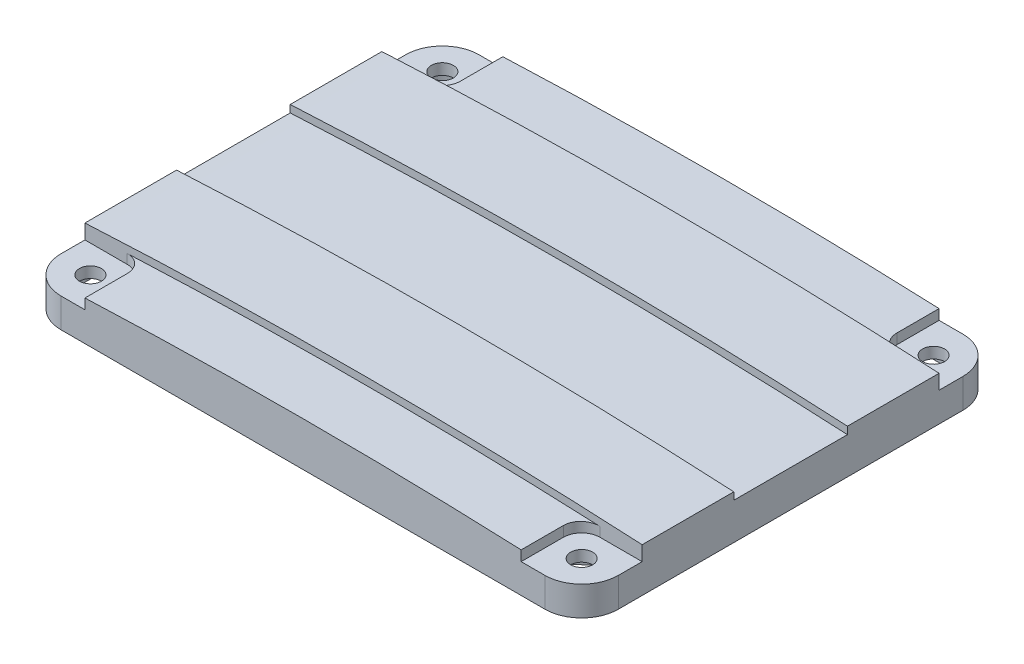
ISO-10303-21;
HEADER;
FILE_DESCRIPTION(('STEP AP214'),'2;1');
FILE_NAME('part.step','',(''),(''),'','','');
FILE_SCHEMA(('AUTOMOTIVE_DESIGN { 1 0 10303 214 1 1 1 1 }'));
ENDSEC;
DATA;
#1=APPLICATION_CONTEXT('core data for automotive mechanical design processes');
#2=APPLICATION_PROTOCOL_DEFINITION('international standard','automotive_design',2000,#1);
#3=PRODUCT_CONTEXT('',#1,'mechanical');
#4=PRODUCT('Part','Part','',(#3));
#5=PRODUCT_RELATED_PRODUCT_CATEGORY('part','',(#4));
#6=PRODUCT_DEFINITION_FORMATION('','',#4);
#7=PRODUCT_DEFINITION_CONTEXT('part definition',#1,'design');
#8=PRODUCT_DEFINITION('design','',#6,#7);
#9=PRODUCT_DEFINITION_SHAPE('','',#8);
#10=(LENGTH_UNIT() NAMED_UNIT(*) SI_UNIT(.MILLI.,.METRE.));
#11=(NAMED_UNIT(*) PLANE_ANGLE_UNIT() SI_UNIT($,.RADIAN.));
#12=(NAMED_UNIT(*) SI_UNIT($,.STERADIAN.) SOLID_ANGLE_UNIT());
#13=UNCERTAINTY_MEASURE_WITH_UNIT(LENGTH_MEASURE(1.E-05),#10,'distance_accuracy_value','');
#14=(GEOMETRIC_REPRESENTATION_CONTEXT(3) GLOBAL_UNCERTAINTY_ASSIGNED_CONTEXT((#13)) GLOBAL_UNIT_ASSIGNED_CONTEXT((#10,
#11,#12)) REPRESENTATION_CONTEXT('',''));
#15=CARTESIAN_POINT('',(0.,0.,0.));
#16=DIRECTION('',(0.,0.,1.));
#17=DIRECTION('',(1.,0.,0.));
#18=AXIS2_PLACEMENT_3D('',#15,#16,#17);
#19=CARTESIAN_POINT('',(56.0000000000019,6.02998476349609,8.00000000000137));
#20=DIRECTION('',(0.647976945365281,0.,-0.761659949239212));
#21=DIRECTION('',(-0.761659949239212,0.,-0.647976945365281));
#22=AXIS2_PLACEMENT_3D('',#19,#20,#21);
#23=PLANE('',#22);
#24=DIRECTION('',(0.,-1.,0.));
#25=VECTOR('',#24,1.);
#26=CARTESIAN_POINT('',(56.0000000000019,6.02998476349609,8.00000000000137));
#27=LINE('',#26,#25);
#28=CARTESIAN_POINT('',(56.0000000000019,-3.,8.00000000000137));
#29=VERTEX_POINT('',#28);
#30=CARTESIAN_POINT('',(56.0000000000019,-6.,8.00000000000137));
#31=VERTEX_POINT('',#30);
#32=EDGE_CURVE('E884',#29,#31,#27,.T.);
#33=ORIENTED_EDGE('',*,*,#32,.F.);
#34=DIRECTION('',(-0.761659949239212,0.,-0.647976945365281));
#35=VECTOR('',#34,1.);
#36=CARTESIAN_POINT('',(62.8749227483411,-3.,13.8487930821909));
#37=LINE('',#36,#35);
#38=CARTESIAN_POINT('',(68.,-3.,18.2089171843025));
#39=VERTEX_POINT('',#38);
#40=EDGE_CURVE('E682',#39,#29,#37,.T.);
#41=ORIENTED_EDGE('',*,*,#40,.F.);
#42=DIRECTION('',(0.,-1.,0.));
#43=VECTOR('',#42,1.);
#44=CARTESIAN_POINT('',(68.,6.02998476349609,18.2089171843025));
#45=LINE('',#44,#43);
#46=CARTESIAN_POINT('',(68.,-6.,18.2089171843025));
#47=VERTEX_POINT('',#46);
#48=EDGE_CURVE('E886',#39,#47,#45,.T.);
#49=ORIENTED_EDGE('',*,*,#48,.T.);
#50=DIRECTION('',(0.761659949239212,0.,0.647976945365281));
#51=VECTOR('',#50,1.);
#52=CARTESIAN_POINT('',(56.0000000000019,-6.,8.00000000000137));
#53=LINE('',#52,#51);
#54=EDGE_CURVE('E845',#31,#47,#53,.T.);
#55=ORIENTED_EDGE('',*,*,#54,.F.);
#56=EDGE_LOOP('',(#33,#41,#49,#55));
#57=FACE_BOUND('',#56,.T.);
#58=ADVANCED_FACE('F131',(#57),#23,.T.);
#59=CARTESIAN_POINT('',(55.2643563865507,6.02998476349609,10.0000000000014));
#60=DIRECTION('',(0.647976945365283,0.,-0.76165994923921));
#61=DIRECTION('',(-0.76165994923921,0.,-0.647976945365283));
#62=AXIS2_PLACEMENT_3D('',#59,#60,#61);
#63=PLANE('',#62);
#64=DIRECTION('',(-0.76165994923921,0.,-0.647976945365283));
#65=VECTOR('',#64,1.);
#66=CARTESIAN_POINT('',(61.5789688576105,-3.,15.3721129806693));
#67=LINE('',#66,#65);
#68=CARTESIAN_POINT('',(65.9999999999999,-3.,19.133274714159));
#69=VERTEX_POINT('',#68);
#70=CARTESIAN_POINT('',(55.2643563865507,-3.,10.0000000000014));
#71=VERTEX_POINT('',#70);
#72=EDGE_CURVE('E692',#69,#71,#67,.T.);
#73=ORIENTED_EDGE('',*,*,#72,.T.);
#74=DIRECTION('',(0.,-1.,0.));
#75=VECTOR('',#74,1.);
#76=CARTESIAN_POINT('',(55.2643563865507,6.02998476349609,10.0000000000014));
#77=LINE('',#76,#75);
#78=CARTESIAN_POINT('',(55.2643563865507,-6.,10.0000000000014));
#79=VERTEX_POINT('',#78);
#80=EDGE_CURVE('E868',#71,#79,#77,.T.);
#81=ORIENTED_EDGE('',*,*,#80,.T.);
#82=DIRECTION('',(0.76165994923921,0.,0.647976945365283));
#83=VECTOR('',#82,1.);
#84=CARTESIAN_POINT('',(55.2643563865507,-6.,10.0000000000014));
#85=LINE('',#84,#83);
#86=CARTESIAN_POINT('',(65.9999999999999,-6.,19.133274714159));
#87=VERTEX_POINT('',#86);
#88=EDGE_CURVE('E821',#79,#87,#85,.T.);
#89=ORIENTED_EDGE('',*,*,#88,.T.);
#90=DIRECTION('',(0.,-1.,0.));
#91=VECTOR('',#90,1.);
#92=CARTESIAN_POINT('',(65.9999999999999,6.02998476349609,19.133274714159));
#93=LINE('',#92,#91);
#94=EDGE_CURVE('E870',#69,#87,#93,.T.);
#95=ORIENTED_EDGE('',*,*,#94,.F.);
#96=EDGE_LOOP('',(#73,#81,#89,#95));
#97=FACE_BOUND('',#96,.T.);
#98=ADVANCED_FACE('F1204',(#97),#63,.F.);
#99=CARTESIAN_POINT('',(-55.2643563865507,6.02998476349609,104.000000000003));
#100=DIRECTION('',(-0.647976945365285,0.,0.761659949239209));
#101=DIRECTION('',(0.761659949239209,0.,0.647976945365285));
#102=AXIS2_PLACEMENT_3D('',#99,#100,#101);
#103=PLANE('',#102);
#104=DIRECTION('',(0.761659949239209,0.,0.647976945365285));
#105=VECTOR('',#104,1.);
#106=CARTESIAN_POINT('',(-61.5789688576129,-3.,98.6278870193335));
#107=LINE('',#106,#105);
#108=CARTESIAN_POINT('',(-65.9999999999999,-3.,94.8667252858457));
#109=VERTEX_POINT('',#108);
#110=CARTESIAN_POINT('',(-55.2643563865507,-3.,104.000000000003));
#111=VERTEX_POINT('',#110);
#112=EDGE_CURVE('E732',#109,#111,#107,.T.);
#113=ORIENTED_EDGE('',*,*,#112,.T.);
#114=DIRECTION('',(0.,-1.,0.));
#115=VECTOR('',#114,1.);
#116=CARTESIAN_POINT('',(-55.2643563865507,6.02998476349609,104.000000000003));
#117=LINE('',#116,#115);
#118=CARTESIAN_POINT('',(-55.2643563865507,-6.,104.000000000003));
#119=VERTEX_POINT('',#118);
#120=EDGE_CURVE('E875',#111,#119,#117,.T.);
#121=ORIENTED_EDGE('',*,*,#120,.T.);
#122=DIRECTION('',(-0.761659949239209,0.,-0.647976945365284));
#123=VECTOR('',#122,1.);
#124=CARTESIAN_POINT('',(-55.2643563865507,-6.,104.000000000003));
#125=LINE('',#124,#123);
#126=CARTESIAN_POINT('',(-65.9999999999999,-6.,94.8667252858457));
#127=VERTEX_POINT('',#126);
#128=EDGE_CURVE('E816',#119,#127,#125,.T.);
#129=ORIENTED_EDGE('',*,*,#128,.T.);
#130=DIRECTION('',(0.,-1.,0.));
#131=VECTOR('',#130,1.);
#132=CARTESIAN_POINT('',(-65.9999999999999,6.02998476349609,94.8667252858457));
#133=LINE('',#132,#131);
#134=EDGE_CURVE('E861',#109,#127,#133,.T.);
#135=ORIENTED_EDGE('',*,*,#134,.F.);
#136=EDGE_LOOP('',(#113,#121,#129,#135));
#137=FACE_BOUND('',#136,.T.);
#138=ADVANCED_FACE('F1210',(#137),#103,.F.);
#139=CARTESIAN_POINT('',(-56.0000000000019,6.02998476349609,106.000000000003));
#140=DIRECTION('',(-0.647976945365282,0.,0.761659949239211));
#141=DIRECTION('',(0.761659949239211,0.,0.647976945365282));
#142=AXIS2_PLACEMENT_3D('',#139,#140,#141);
#143=PLANE('',#142);
#144=DIRECTION('',(0.,-1.,0.));
#145=VECTOR('',#144,1.);
#146=CARTESIAN_POINT('',(-56.0000000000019,6.02998476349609,106.000000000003));
#147=LINE('',#146,#145);
#148=CARTESIAN_POINT('',(-56.0000000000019,-3.,106.000000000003));
#149=VERTEX_POINT('',#148);
#150=CARTESIAN_POINT('',(-56.0000000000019,-6.,106.000000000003));
#151=VERTEX_POINT('',#150);
#152=EDGE_CURVE('E834',#149,#151,#147,.T.);
#153=ORIENTED_EDGE('',*,*,#152,.F.);
#154=DIRECTION('',(0.761659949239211,0.,0.647976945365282));
#155=VECTOR('',#154,1.);
#156=CARTESIAN_POINT('',(-62.8749227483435,-3.,100.151206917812));
#157=LINE('',#156,#155);
#158=CARTESIAN_POINT('',(-68.,-3.,95.7910828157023));
#159=VERTEX_POINT('',#158);
#160=EDGE_CURVE('E731',#159,#149,#157,.T.);
#161=ORIENTED_EDGE('',*,*,#160,.F.);
#162=DIRECTION('',(0.,-1.,0.));
#163=VECTOR('',#162,1.);
#164=CARTESIAN_POINT('',(-68.,6.02998476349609,95.7910828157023));
#165=LINE('',#164,#163);
#166=CARTESIAN_POINT('',(-68.,-6.,95.7910828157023));
#167=VERTEX_POINT('',#166);
#168=EDGE_CURVE('E864',#159,#167,#165,.T.);
#169=ORIENTED_EDGE('',*,*,#168,.T.);
#170=DIRECTION('',(-0.761659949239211,0.,-0.647976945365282));
#171=VECTOR('',#170,1.);
#172=CARTESIAN_POINT('',(-56.0000000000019,-6.,106.000000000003));
#173=LINE('',#172,#171);
#174=EDGE_CURVE('E812',#151,#167,#173,.T.);
#175=ORIENTED_EDGE('',*,*,#174,.F.);
#176=EDGE_LOOP('',(#153,#161,#169,#175));
#177=FACE_BOUND('',#176,.T.);
#178=ADVANCED_FACE('F1232',(#177),#143,.T.);
#179=CARTESIAN_POINT('',(76.,2.,114.));
#180=DIRECTION('',(-1.,0.,0.));
#181=DIRECTION('',(0.,0.,1.));
#182=AXIS2_PLACEMENT_3D('',#179,#180,#181);
#183=PLANE('',#182);
#184=DIRECTION('',(0.,0.,1.));
#185=VECTOR('',#184,1.);
#186=CARTESIAN_POINT('',(76.,0.,79.740684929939));
#187=LINE('',#186,#185);
#188=CARTESIAN_POINT('',(76.,0.,97.5));
#189=VERTEX_POINT('',#188);
#190=CARTESIAN_POINT('',(76.,0.,104.));
#191=VERTEX_POINT('',#190);
#192=EDGE_CURVE('E627',#189,#191,#187,.T.);
#193=ORIENTED_EDGE('',*,*,#192,.T.);
#194=DIRECTION('',(0.,1.,0.));
#195=VECTOR('',#194,1.);
#196=CARTESIAN_POINT('',(76.,2.,104.));
#197=LINE('',#196,#195);
#198=CARTESIAN_POINT('',(76.,-8.,104.));
#199=VERTEX_POINT('',#198);
#200=EDGE_CURVE('E1152',#191,#199,#197,.F.);
#201=ORIENTED_EDGE('',*,*,#200,.T.);
#202=DIRECTION('',(0.,0.,-1.));
#203=VECTOR('',#202,1.);
#204=CARTESIAN_POINT('',(76.,-8.,114.));
#205=LINE('',#204,#203);
#206=CARTESIAN_POINT('',(76.,-8.,10.));
#207=VERTEX_POINT('',#206);
#208=EDGE_CURVE('E953',#199,#207,#205,.T.);
#209=ORIENTED_EDGE('',*,*,#208,.T.);
#210=DIRECTION('',(0.,1.,0.));
#211=VECTOR('',#210,1.);
#212=CARTESIAN_POINT('',(76.,0.,9.99999999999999));
#213=LINE('',#212,#211);
#214=CARTESIAN_POINT('',(76.,0.,9.99999999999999));
#215=VERTEX_POINT('',#214);
#216=EDGE_CURVE('E588',#207,#215,#213,.T.);
#217=ORIENTED_EDGE('',*,*,#216,.T.);
#218=DIRECTION('',(0.,0.,-1.));
#219=VECTOR('',#218,1.);
#220=CARTESIAN_POINT('',(76.,0.,35.3425499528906));
#221=LINE('',#220,#219);
#222=CARTESIAN_POINT('',(76.,0.,16.5));
#223=VERTEX_POINT('',#222);
#224=EDGE_CURVE('E576',#223,#215,#221,.T.);
#225=ORIENTED_EDGE('',*,*,#224,.F.);
#226=DIRECTION('',(0.,1.,0.));
#227=VECTOR('',#226,1.);
#228=CARTESIAN_POINT('',(75.9999999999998,1.99999999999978,16.5));
#229=LINE('',#228,#227);
#230=CARTESIAN_POINT('',(75.9999999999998,4.00284617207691,16.5));
#231=VERTEX_POINT('',#230);
#232=EDGE_CURVE('E561',#223,#231,#229,.T.);
#233=ORIENTED_EDGE('',*,*,#232,.T.);
#234=DIRECTION('',(0.,0.,1.));
#235=VECTOR('',#234,1.);
#236=CARTESIAN_POINT('',(75.9999999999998,4.00284617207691,16.5));
#237=LINE('',#236,#235);
#238=CARTESIAN_POINT('',(75.9999999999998,4.00284617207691,41.5));
#239=VERTEX_POINT('',#238);
#240=EDGE_CURVE('E987',#231,#239,#237,.T.);
#241=ORIENTED_EDGE('',*,*,#240,.T.);
#242=DIRECTION('',(0.,1.,0.));
#243=VECTOR('',#242,1.);
#244=CARTESIAN_POINT('',(75.9999999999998,1.99999999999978,41.5));
#245=LINE('',#244,#243);
#246=CARTESIAN_POINT('',(75.9999999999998,1.99999999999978,41.5));
#247=VERTEX_POINT('',#246);
#248=EDGE_CURVE('E990',#247,#239,#245,.T.);
#249=ORIENTED_EDGE('',*,*,#248,.F.);
#250=DIRECTION('',(0.,0.,-1.));
#251=VECTOR('',#250,1.);
#252=CARTESIAN_POINT('',(75.9999999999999,1.99999999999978,114.));
#253=LINE('',#252,#251);
#254=CARTESIAN_POINT('',(75.9999999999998,1.99999999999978,72.5));
#255=VERTEX_POINT('',#254);
#256=EDGE_CURVE('E1035',#255,#247,#253,.T.);
#257=ORIENTED_EDGE('',*,*,#256,.F.);
#258=DIRECTION('',(0.,1.,0.));
#259=VECTOR('',#258,1.);
#260=CARTESIAN_POINT('',(75.9999999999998,1.99999999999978,72.5));
#261=LINE('',#260,#259);
#262=CARTESIAN_POINT('',(75.9999999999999,4.00284617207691,72.5));
#263=VERTEX_POINT('',#262);
#264=EDGE_CURVE('E1004',#255,#263,#261,.T.);
#265=ORIENTED_EDGE('',*,*,#264,.T.);
#266=DIRECTION('',(0.,0.,1.));
#267=VECTOR('',#266,1.);
#268=CARTESIAN_POINT('',(75.9999999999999,4.00284617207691,72.5));
#269=LINE('',#268,#267);
#270=CARTESIAN_POINT('',(75.9999999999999,4.00284617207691,97.5));
#271=VERTEX_POINT('',#270);
#272=EDGE_CURVE('E1013',#263,#271,#269,.T.);
#273=ORIENTED_EDGE('',*,*,#272,.T.);
#274=DIRECTION('',(0.,1.,0.));
#275=VECTOR('',#274,1.);
#276=CARTESIAN_POINT('',(75.9999999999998,1.99999999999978,97.5));
#277=LINE('',#276,#275);
#278=EDGE_CURVE('E1015',#189,#271,#277,.T.);
#279=ORIENTED_EDGE('',*,*,#278,.F.);
#280=EDGE_LOOP('',(#193,#201,#209,#217,#225,#233,#241,#249,#257,#265,#273,#279));
#281=FACE_BOUND('',#280,.T.);
#282=ADVANCED_FACE('F585',(#281),#183,.F.);
#283=CARTESIAN_POINT('',(-76.,2.,114.));
#284=DIRECTION('',(1.,0.,0.));
#285=DIRECTION('',(0.,1.,0.));
#286=AXIS2_PLACEMENT_3D('',#283,#284,#285);
#287=PLANE('',#286);
#288=DIRECTION('',(0.,0.,-1.));
#289=VECTOR('',#288,1.);
#290=CARTESIAN_POINT('',(-76.,0.,35.3425499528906));
#291=LINE('',#290,#289);
#292=CARTESIAN_POINT('',(-76.,0.,16.5));
#293=VERTEX_POINT('',#292);
#294=CARTESIAN_POINT('',(-76.,0.,9.99999999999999));
#295=VERTEX_POINT('',#294);
#296=EDGE_CURVE('E605',#293,#295,#291,.T.);
#297=ORIENTED_EDGE('',*,*,#296,.T.);
#298=DIRECTION('',(0.,-1.,0.));
#299=VECTOR('',#298,1.);
#300=CARTESIAN_POINT('',(-75.9999999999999,-8.,9.99999999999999));
#301=LINE('',#300,#299);
#302=CARTESIAN_POINT('',(-76.,-8.,9.99999999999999));
#303=VERTEX_POINT('',#302);
#304=EDGE_CURVE('E1169',#295,#303,#301,.T.);
#305=ORIENTED_EDGE('',*,*,#304,.T.);
#306=DIRECTION('',(0.,0.,1.));
#307=VECTOR('',#306,1.);
#308=CARTESIAN_POINT('',(-76.,-8.,0.));
#309=LINE('',#308,#307);
#310=CARTESIAN_POINT('',(-76.,-8.,104.));
#311=VERTEX_POINT('',#310);
#312=EDGE_CURVE('E948',#303,#311,#309,.T.);
#313=ORIENTED_EDGE('',*,*,#312,.T.);
#314=DIRECTION('',(0.,-1.,0.));
#315=VECTOR('',#314,1.);
#316=CARTESIAN_POINT('',(-76.,2.,104.));
#317=LINE('',#316,#315);
#318=CARTESIAN_POINT('',(-76.,0.,104.));
#319=VERTEX_POINT('',#318);
#320=EDGE_CURVE('E148',#311,#319,#317,.F.);
#321=ORIENTED_EDGE('',*,*,#320,.T.);
#322=DIRECTION('',(0.,0.,1.));
#323=VECTOR('',#322,1.);
#324=CARTESIAN_POINT('',(-76.,0.,79.740684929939));
#325=LINE('',#324,#323);
#326=CARTESIAN_POINT('',(-76.,0.,97.5));
#327=VERTEX_POINT('',#326);
#328=EDGE_CURVE('E617',#327,#319,#325,.T.);
#329=ORIENTED_EDGE('',*,*,#328,.F.);
#330=DIRECTION('',(0.,-1.,0.));
#331=VECTOR('',#330,1.);
#332=CARTESIAN_POINT('',(-76.,2.,97.5));
#333=LINE('',#332,#331);
#334=CARTESIAN_POINT('',(-75.9999999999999,4.00284617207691,97.5));
#335=VERTEX_POINT('',#334);
#336=EDGE_CURVE('E1005',#335,#327,#333,.T.);
#337=ORIENTED_EDGE('',*,*,#336,.F.);
#338=DIRECTION('',(0.,0.,1.));
#339=VECTOR('',#338,1.);
#340=CARTESIAN_POINT('',(-75.9999999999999,4.00284617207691,72.5));
#341=LINE('',#340,#339);
#342=CARTESIAN_POINT('',(-75.9999999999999,4.00284617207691,72.5));
#343=VERTEX_POINT('',#342);
#344=EDGE_CURVE('E1022',#343,#335,#341,.T.);
#345=ORIENTED_EDGE('',*,*,#344,.F.);
#346=DIRECTION('',(0.,-1.,0.));
#347=VECTOR('',#346,1.);
#348=CARTESIAN_POINT('',(-76.,2.,72.5));
#349=LINE('',#348,#347);
#350=CARTESIAN_POINT('',(-76.,2.,72.5));
#351=VERTEX_POINT('',#350);
#352=EDGE_CURVE('E1011',#343,#351,#349,.T.);
#353=ORIENTED_EDGE('',*,*,#352,.T.);
#354=DIRECTION('',(0.,0.,-1.));
#355=VECTOR('',#354,1.);
#356=CARTESIAN_POINT('',(-76.,2.,114.));
#357=LINE('',#356,#355);
#358=CARTESIAN_POINT('',(-75.9999999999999,1.99999999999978,41.5));
#359=VERTEX_POINT('',#358);
#360=EDGE_CURVE('E1030',#351,#359,#357,.T.);
#361=ORIENTED_EDGE('',*,*,#360,.T.);
#362=DIRECTION('',(0.,-1.,0.));
#363=VECTOR('',#362,1.);
#364=CARTESIAN_POINT('',(-75.9999999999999,4.00284617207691,41.5));
#365=LINE('',#364,#363);
#366=CARTESIAN_POINT('',(-75.9999999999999,4.00284617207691,41.5));
#367=VERTEX_POINT('',#366);
#368=EDGE_CURVE('E981',#367,#359,#365,.T.);
#369=ORIENTED_EDGE('',*,*,#368,.F.);
#370=DIRECTION('',(0.,0.,1.));
#371=VECTOR('',#370,1.);
#372=CARTESIAN_POINT('',(-75.9999999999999,4.00284617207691,16.5));
#373=LINE('',#372,#371);
#374=CARTESIAN_POINT('',(-75.9999999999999,4.00284617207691,16.5));
#375=VERTEX_POINT('',#374);
#376=EDGE_CURVE('E997',#375,#367,#373,.T.);
#377=ORIENTED_EDGE('',*,*,#376,.F.);
#378=DIRECTION('',(0.,-1.,0.));
#379=VECTOR('',#378,1.);
#380=CARTESIAN_POINT('',(-75.9999999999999,4.00284617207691,16.5));
#381=LINE('',#380,#379);
#382=EDGE_CURVE('E984',#375,#293,#381,.T.);
#383=ORIENTED_EDGE('',*,*,#382,.T.);
#384=EDGE_LOOP('',(#297,#305,#313,#321,#329,#337,#345,#353,#361,#369,#377,#383));
#385=FACE_BOUND('',#384,.T.);
#386=ADVANCED_FACE('F1316',(#385),#287,.F.);
#387=CARTESIAN_POINT('',(0.,-1421.05982315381,114.));
#388=DIRECTION('',(0.,0.,-1.));
#389=DIRECTION('',(-1.,0.,0.));
#390=AXIS2_PLACEMENT_3D('',#387,#388,#389);
#391=CYLINDRICAL_SURFACE('',#390,1425.08780791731);
#392=CARTESIAN_POINT('',(0.,-1421.05982315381,16.5));
#393=DIRECTION('',(0.,0.,-1.));
#394=DIRECTION('',(1.,0.,0.));
#395=AXIS2_PLACEMENT_3D('',#392,#393,#394);
#396=CIRCLE('',#395,1425.08780791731);
#397=CARTESIAN_POINT('',(-64.5,2.56758957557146,16.5));
#398=VERTEX_POINT('',#397);
#399=CARTESIAN_POINT('',(64.5,2.56758957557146,16.5));
#400=VERTEX_POINT('',#399);
#401=EDGE_CURVE('E571',#398,#400,#396,.T.);
#402=ORIENTED_EDGE('',*,*,#401,.T.);
#403=CARTESIAN_POINT('',(64.5,2.56758957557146,16.5));
#404=CARTESIAN_POINT('',(64.3592797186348,2.57396537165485,16.500015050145));
#405=CARTESIAN_POINT('',(64.2185605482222,2.58031979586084,16.4940599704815));
#406=CARTESIAN_POINT('',(63.9381261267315,2.59294203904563,16.4703177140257));
#407=CARTESIAN_POINT('',(63.7984108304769,2.59920986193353,16.4525310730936));
#408=CARTESIAN_POINT('',(63.5210734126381,2.61161113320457,16.4052509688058));
#409=CARTESIAN_POINT('',(63.3834498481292,2.61774467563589,16.3757659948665));
#410=CARTESIAN_POINT('',(63.1111716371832,2.62984065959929,16.3053020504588));
#411=CARTESIAN_POINT('',(62.9765169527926,2.63580310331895,16.264323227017));
#412=CARTESIAN_POINT('',(62.7110901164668,2.64751935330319,16.1711445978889));
#413=CARTESIAN_POINT('',(62.5803192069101,2.65327309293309,16.1189412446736));
#414=CARTESIAN_POINT('',(62.3235878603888,2.66453471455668,16.003669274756));
#415=CARTESIAN_POINT('',(62.1976292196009,2.67004250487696,15.9405966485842));
#416=CARTESIAN_POINT('',(61.951539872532,2.68077194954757,15.8040839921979));
#417=CARTESIAN_POINT('',(61.8314059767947,2.6859937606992,15.7306497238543));
#418=CARTESIAN_POINT('',(61.5977047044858,2.69612388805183,15.5738786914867));
#419=CARTESIAN_POINT('',(61.4841397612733,2.70103208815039,15.4905382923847));
#420=CARTESIAN_POINT('',(61.2645314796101,2.71049874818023,15.3146451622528));
#421=CARTESIAN_POINT('',(61.1584816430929,2.7150575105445,15.2221005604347));
#422=CARTESIAN_POINT('',(60.9545152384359,2.7238042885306,15.0283606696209));
#423=CARTESIAN_POINT('',(60.8566015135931,2.72799217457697,14.9271623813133));
#424=CARTESIAN_POINT('',(60.6696461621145,2.73597086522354,14.7168594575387));
#425=CARTESIAN_POINT('',(60.5806047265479,2.73976166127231,14.6077546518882));
#426=CARTESIAN_POINT('',(60.412033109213,2.74692414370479,14.3824165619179));
#427=CARTESIAN_POINT('',(60.3325029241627,2.75029583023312,14.266183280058));
#428=CARTESIAN_POINT('',(60.1835630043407,2.75659920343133,14.027479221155));
#429=CARTESIAN_POINT('',(60.1141478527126,2.759531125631,13.905011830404));
#430=CARTESIAN_POINT('',(59.9859059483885,2.76493975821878,13.654698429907));
#431=CARTESIAN_POINT('',(59.9270755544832,2.76741662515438,13.5268542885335));
#432=CARTESIAN_POINT('',(59.8204104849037,2.77190202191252,13.2666909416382));
#433=CARTESIAN_POINT('',(59.7725724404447,2.77391069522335,13.1343731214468));
#434=CARTESIAN_POINT('',(59.688223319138,2.77744916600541,12.8662238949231));
#435=CARTESIAN_POINT('',(59.6517095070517,2.77897907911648,12.730393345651));
#436=CARTESIAN_POINT('',(59.5807943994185,2.78194855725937,12.4138713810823));
#437=CARTESIAN_POINT('',(59.5504975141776,2.78321558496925,12.2322323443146));
#438=CARTESIAN_POINT('',(59.520202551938,2.78448218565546,11.9583253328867));
#439=CARTESIAN_POINT('',(59.5126292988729,2.78479872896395,11.866828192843));
#440=CARTESIAN_POINT('',(59.5025286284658,2.78522086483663,11.6835614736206));
#441=CARTESIAN_POINT('',(59.5000008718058,2.78532647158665,11.5917919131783));
#442=CARTESIAN_POINT('',(59.5,2.78532652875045,11.5));
#443=B_SPLINE_CURVE_WITH_KNOTS('',3,(#403,#404,#405,#406,#407,#408,#409,#410,#411,#412,#413,
#414,#415,#416,#417,#418,#419,#420,#421,#422,#423,#424,#425,#426,#427,#428,#429,#430,#431,#432,
#433,#434,#435,#436,#437,#438,#439,#440,#441,#442),.UNSPECIFIED.,.F.,.F.,(4,2,2,2,2,2,2,2,2,2,2,
2,2,2,2,2,2,2,2,4),(0.,0.422465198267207,0.844911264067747,1.26705132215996,1.68918598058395,
2.11145425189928,2.53387862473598,2.95606901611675,3.37841481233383,3.80039084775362,
4.22251373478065,4.64464571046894,5.06677754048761,5.48868247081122,5.91044198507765,
6.33207207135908,6.75360023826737,7.30478609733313,7.58010088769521,7.85539716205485),.UNSPECIFIED.);
#444=CARTESIAN_POINT('',(59.5,2.7853265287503,11.5));
#445=VERTEX_POINT('',#444);
#446=EDGE_CURVE('E1059',#400,#445,#443,.T.);
#447=ORIENTED_EDGE('',*,*,#446,.T.);
#448=DIRECTION('',(0.,0.,-1.));
#449=VECTOR('',#448,1.);
#450=CARTESIAN_POINT('',(59.5,2.7853265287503,114.));
#451=LINE('',#450,#449);
#452=CARTESIAN_POINT('',(59.5,2.78532652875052,0.));
#453=VERTEX_POINT('',#452);
#454=EDGE_CURVE('E592',#445,#453,#451,.T.);
#455=ORIENTED_EDGE('',*,*,#454,.T.);
#456=CARTESIAN_POINT('',(0.,-1421.05982315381,0.));
#457=DIRECTION('',(0.,0.,1.));
#458=DIRECTION('',(-1.,0.,0.));
#459=AXIS2_PLACEMENT_3D('',#456,#457,#458);
#460=CIRCLE('',#459,1425.08780791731);
#461=CARTESIAN_POINT('',(-59.5,2.78532652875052,0.));
#462=VERTEX_POINT('',#461);
#463=EDGE_CURVE('E1025',#453,#462,#460,.T.);
#464=ORIENTED_EDGE('',*,*,#463,.T.);
#465=DIRECTION('',(0.,0.,-1.));
#466=VECTOR('',#465,1.);
#467=CARTESIAN_POINT('',(-59.5,2.7853265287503,114.));
#468=LINE('',#467,#466);
#469=CARTESIAN_POINT('',(-59.5,2.7853265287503,11.5));
#470=VERTEX_POINT('',#469);
#471=EDGE_CURVE('E589',#462,#470,#468,.F.);
#472=ORIENTED_EDGE('',*,*,#471,.T.);
#473=CARTESIAN_POINT('',(-59.5,2.7853265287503,11.5));
#474=CARTESIAN_POINT('',(-59.4999848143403,2.78532700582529,11.6405389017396));
#475=CARTESIAN_POINT('',(-59.5059247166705,2.78507893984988,11.7810755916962));
#476=CARTESIAN_POINT('',(-59.5296049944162,2.78408917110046,12.0611428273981));
#477=CARTESIAN_POINT('',(-59.5473447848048,2.78334749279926,12.2006734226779));
#478=CARTESIAN_POINT('',(-59.594496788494,2.78137471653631,12.4776329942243));
#479=CARTESIAN_POINT('',(-59.6238999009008,2.78014400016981,12.615063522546));
#480=CARTESIAN_POINT('',(-59.6941635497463,2.77719994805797,12.8869565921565));
#481=CARTESIAN_POINT('',(-59.735023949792,2.77548661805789,13.0214191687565));
#482=CARTESIAN_POINT('',(-59.8279255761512,2.77158602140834,13.2864620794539));
#483=CARTESIAN_POINT('',(-59.879970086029,2.76939861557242,13.4170412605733));
#484=CARTESIAN_POINT('',(-59.9948822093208,2.76456127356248,13.6733962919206));
#485=CARTESIAN_POINT('',(-60.0577538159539,2.76191116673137,13.79917034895));
#486=CARTESIAN_POINT('',(-60.1938212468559,2.75616523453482,14.0449044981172));
#487=CARTESIAN_POINT('',(-60.2670114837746,2.75306965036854,14.1648676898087));
#488=CARTESIAN_POINT('',(-60.4232488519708,2.74644786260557,14.3982453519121));
#489=CARTESIAN_POINT('',(-60.5062996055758,2.74292150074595,14.5116573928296));
#490=CARTESIAN_POINT('',(-60.6816432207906,2.73545923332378,14.7310794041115));
#491=CARTESIAN_POINT('',(-60.7739359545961,2.73152333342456,14.8370894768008));
#492=CARTESIAN_POINT('',(-60.9671432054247,2.72326323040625,15.0409966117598));
#493=CARTESIAN_POINT('',(-61.0680609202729,2.71893888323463,15.1388906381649));
#494=CARTESIAN_POINT('',(-61.2777522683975,2.70992942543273,15.3258128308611));
#495=CARTESIAN_POINT('',(-61.3865245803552,2.70524437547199,15.4148424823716));
#496=CARTESIAN_POINT('',(-61.6112063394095,2.69553932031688,15.5834552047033));
#497=CARTESIAN_POINT('',(-61.7271183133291,2.69051919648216,15.6630349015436));
#498=CARTESIAN_POINT('',(-61.9653217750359,2.6801718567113,15.812211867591));
#499=CARTESIAN_POINT('',(-62.0876185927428,2.67484438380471,15.8818006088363));
#500=CARTESIAN_POINT('',(-62.3376297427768,2.66391965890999,16.0104233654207));
#501=CARTESIAN_POINT('',(-62.465344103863,2.6583224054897,16.0694573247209));
#502=CARTESIAN_POINT('',(-62.7252273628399,2.64689630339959,16.1765285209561));
#503=CARTESIAN_POINT('',(-62.8573941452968,2.64106756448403,16.2245708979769));
#504=CARTESIAN_POINT('',(-63.125246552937,2.62921645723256,16.3093445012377));
#505=CARTESIAN_POINT('',(-63.2609314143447,2.62319413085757,16.3460781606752));
#506=CARTESIAN_POINT('',(-63.5787220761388,2.60904250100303,16.4178808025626));
#507=CARTESIAN_POINT('',(-63.7618193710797,2.60085431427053,16.4486748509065));
#508=CARTESIAN_POINT('',(-64.0379425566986,2.58845177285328,16.4794665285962));
#509=CARTESIAN_POINT('',(-64.1301830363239,2.58429966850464,16.4871638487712));
#510=CARTESIAN_POINT('',(-64.3149415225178,2.57596493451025,16.4974299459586));
#511=CARTESIAN_POINT('',(-64.4074595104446,2.57178230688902,16.4999990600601));
#512=CARTESIAN_POINT('',(-64.5,2.56758957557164,16.5));
#513=B_SPLINE_CURVE_WITH_KNOTS('',3,(#473,#474,#475,#476,#477,#478,#479,#480,#481,#482,#483,
#484,#485,#486,#487,#488,#489,#490,#491,#492,#493,#494,#495,#496,#497,#498,#499,#500,#501,#502,
#503,#504,#505,#506,#507,#508,#509,#510,#511,#512),.UNSPECIFIED.,.F.,.F.,(4,2,2,2,2,2,2,2,2,2,2,
2,2,2,2,2,2,2,2,4),(0.,0.421487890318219,0.84295488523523,1.26409365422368,1.68522740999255,
2.10648497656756,2.52789824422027,2.9490841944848,3.37042535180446,3.79176068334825,
4.21325291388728,4.63467440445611,5.05624590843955,5.47817513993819,5.90010661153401,
6.3218403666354,6.74348331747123,7.29972857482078,7.57757170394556,7.85539656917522),.UNSPECIFIED.);
#514=EDGE_CURVE('E1050',#470,#398,#513,.T.);
#515=ORIENTED_EDGE('',*,*,#514,.T.);
#516=EDGE_LOOP('',(#402,#447,#455,#464,#472,#515));
#517=FACE_BOUND('',#516,.T.);
#518=ADVANCED_FACE('F1318',(#517),#391,.T.);
#519=ORIENTED_EDGE('',*,*,#256,.T.);
#520=CARTESIAN_POINT('',(0.,-1421.05982315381,41.5));
#521=DIRECTION('',(0.,0.,-1.));
#522=DIRECTION('',(1.,0.,0.));
#523=AXIS2_PLACEMENT_3D('',#520,#521,#522);
#524=CIRCLE('',#523,1425.08780791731);
#525=EDGE_CURVE('E977',#359,#247,#524,.T.);
#526=ORIENTED_EDGE('',*,*,#525,.F.);
#527=ORIENTED_EDGE('',*,*,#360,.F.);
#528=CARTESIAN_POINT('',(0.,-1421.05982315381,72.5));
#529=DIRECTION('',(0.,0.,-1.));
#530=DIRECTION('',(1.,0.,0.));
#531=AXIS2_PLACEMENT_3D('',#528,#529,#530);
#532=CIRCLE('',#531,1425.08780791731);
#533=EDGE_CURVE('E1001',#351,#255,#532,.T.);
#534=ORIENTED_EDGE('',*,*,#533,.T.);
#535=EDGE_LOOP('',(#519,#526,#527,#534));
#536=FACE_BOUND('',#535,.T.);
#537=ADVANCED_FACE('F1323',(#536),#391,.T.);
#538=CARTESIAN_POINT('',(0.,-1421.05982315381,97.5));
#539=DIRECTION('',(0.,0.,-1.));
#540=DIRECTION('',(1.,0.,0.));
#541=AXIS2_PLACEMENT_3D('',#538,#539,#540);
#542=CIRCLE('',#541,1425.08780791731);
#543=CARTESIAN_POINT('',(-64.5,2.56758957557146,97.5));
#544=VERTEX_POINT('',#543);
#545=CARTESIAN_POINT('',(64.5,2.56758957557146,97.5));
#546=VERTEX_POINT('',#545);
#547=EDGE_CURVE('E999',#544,#546,#542,.T.);
#548=ORIENTED_EDGE('',*,*,#547,.F.);
#549=CARTESIAN_POINT('',(-64.5,2.56758957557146,97.5));
#550=CARTESIAN_POINT('',(-64.3592797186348,2.57396537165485,97.499984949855));
#551=CARTESIAN_POINT('',(-64.2185605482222,2.58031979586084,97.5059400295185));
#552=CARTESIAN_POINT('',(-63.9381261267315,2.59294203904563,97.5296822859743));
#553=CARTESIAN_POINT('',(-63.7984108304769,2.59920986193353,97.5474689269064));
#554=CARTESIAN_POINT('',(-63.5210734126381,2.61161113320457,97.5947490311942));
#555=CARTESIAN_POINT('',(-63.3834498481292,2.61774467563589,97.6242340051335));
#556=CARTESIAN_POINT('',(-63.1111716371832,2.62984065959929,97.6946979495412));
#557=CARTESIAN_POINT('',(-62.9765169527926,2.63580310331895,97.735676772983));
#558=CARTESIAN_POINT('',(-62.7110901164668,2.64751935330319,97.8288554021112));
#559=CARTESIAN_POINT('',(-62.5803192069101,2.65327309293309,97.8810587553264));
#560=CARTESIAN_POINT('',(-62.3235878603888,2.66453471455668,97.996330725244));
#561=CARTESIAN_POINT('',(-62.1976292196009,2.67004250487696,98.0594033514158));
#562=CARTESIAN_POINT('',(-61.951539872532,2.68077194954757,98.1959160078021));
#563=CARTESIAN_POINT('',(-61.8314059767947,2.6859937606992,98.2693502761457));
#564=CARTESIAN_POINT('',(-61.5977047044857,2.69612388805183,98.4261213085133));
#565=CARTESIAN_POINT('',(-61.4841397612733,2.70103208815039,98.5094617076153));
#566=CARTESIAN_POINT('',(-61.26453147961,2.71049874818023,98.6853548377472));
#567=CARTESIAN_POINT('',(-61.1584816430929,2.7150575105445,98.7778994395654));
#568=CARTESIAN_POINT('',(-60.9545152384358,2.7238042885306,98.9716393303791));
#569=CARTESIAN_POINT('',(-60.8566015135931,2.72799217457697,99.0728376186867));
#570=CARTESIAN_POINT('',(-60.6696461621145,2.73597086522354,99.2831405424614));
#571=CARTESIAN_POINT('',(-60.5806047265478,2.73976166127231,99.3922453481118));
#572=CARTESIAN_POINT('',(-60.412033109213,2.74692414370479,99.6175834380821));
#573=CARTESIAN_POINT('',(-60.3325029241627,2.75029583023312,99.733816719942));
#574=CARTESIAN_POINT('',(-60.1835630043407,2.75659920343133,99.972520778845));
#575=CARTESIAN_POINT('',(-60.1141478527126,2.759531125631,100.094988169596));
#576=CARTESIAN_POINT('',(-59.9859059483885,2.76493975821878,100.345301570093));
#577=CARTESIAN_POINT('',(-59.9270755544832,2.76741662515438,100.473145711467));
#578=CARTESIAN_POINT('',(-59.8204104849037,2.77190202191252,100.733309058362));
#579=CARTESIAN_POINT('',(-59.7725724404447,2.77391069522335,100.865626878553));
#580=CARTESIAN_POINT('',(-59.688223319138,2.77744916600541,101.133776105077));
#581=CARTESIAN_POINT('',(-59.6517095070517,2.77897907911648,101.269606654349));
#582=CARTESIAN_POINT('',(-59.5807943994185,2.78194855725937,101.586128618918));
#583=CARTESIAN_POINT('',(-59.5504975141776,2.78321558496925,101.767767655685));
#584=CARTESIAN_POINT('',(-59.520202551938,2.78448218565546,102.041674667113));
#585=CARTESIAN_POINT('',(-59.5126292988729,2.78479872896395,102.133171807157));
#586=CARTESIAN_POINT('',(-59.5025286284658,2.78522086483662,102.316438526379));
#587=CARTESIAN_POINT('',(-59.5000008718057,2.78532647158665,102.408208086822));
#588=CARTESIAN_POINT('',(-59.5,2.78532652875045,102.5));
#589=B_SPLINE_CURVE_WITH_KNOTS('',3,(#549,#550,#551,#552,#553,#554,#555,#556,#557,#558,#559,
#560,#561,#562,#563,#564,#565,#566,#567,#568,#569,#570,#571,#572,#573,#574,#575,#576,#577,#578,
#579,#580,#581,#582,#583,#584,#585,#586,#587,#588),.UNSPECIFIED.,.F.,.F.,(4,2,2,2,2,2,2,2,2,2,2,
2,2,2,2,2,2,2,2,4),(0.,0.422465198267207,0.844911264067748,1.26705132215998,1.68918598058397,
2.1114542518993,2.533878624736,2.95606901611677,3.37841481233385,3.80039084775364,
4.22251373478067,4.64464571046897,5.06677754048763,5.48868247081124,5.91044198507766,
6.3320720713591,6.75360023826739,7.30478609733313,7.58010088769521,7.85539716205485),.UNSPECIFIED.);
#590=CARTESIAN_POINT('',(-59.5,2.7853265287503,102.5));
#591=VERTEX_POINT('',#590);
#592=EDGE_CURVE('E1090',#544,#591,#589,.T.);
#593=ORIENTED_EDGE('',*,*,#592,.T.);
#594=DIRECTION('',(0.,0.,-1.));
#595=VECTOR('',#594,1.);
#596=CARTESIAN_POINT('',(-59.5,2.7853265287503,114.));
#597=LINE('',#596,#595);
#598=CARTESIAN_POINT('',(-59.5,2.78532652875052,114.));
#599=VERTEX_POINT('',#598);
#600=EDGE_CURVE('E638',#591,#599,#597,.F.);
#601=ORIENTED_EDGE('',*,*,#600,.T.);
#602=CARTESIAN_POINT('',(0.,-1421.05982315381,114.));
#603=DIRECTION('',(0.,0.,1.));
#604=DIRECTION('',(-1.,0.,0.));
#605=AXIS2_PLACEMENT_3D('',#602,#603,#604);
#606=CIRCLE('',#605,1425.08780791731);
#607=CARTESIAN_POINT('',(59.5,2.78532652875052,114.));
#608=VERTEX_POINT('',#607);
#609=EDGE_CURVE('E1027',#608,#599,#606,.T.);
#610=ORIENTED_EDGE('',*,*,#609,.F.);
#611=DIRECTION('',(0.,0.,-1.));
#612=VECTOR('',#611,1.);
#613=CARTESIAN_POINT('',(59.5,2.7853265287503,114.));
#614=LINE('',#613,#612);
#615=CARTESIAN_POINT('',(59.5,2.7853265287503,102.5));
#616=VERTEX_POINT('',#615);
#617=EDGE_CURVE('E624',#608,#616,#614,.T.);
#618=ORIENTED_EDGE('',*,*,#617,.T.);
#619=CARTESIAN_POINT('',(59.5,2.7853265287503,102.5));
#620=CARTESIAN_POINT('',(59.4999848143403,2.78532700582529,102.35946109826));
#621=CARTESIAN_POINT('',(59.5059247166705,2.78507893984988,102.218924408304));
#622=CARTESIAN_POINT('',(59.5296049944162,2.78408917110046,101.938857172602));
#623=CARTESIAN_POINT('',(59.5473447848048,2.78334749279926,101.799326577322));
#624=CARTESIAN_POINT('',(59.594496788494,2.78137471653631,101.522367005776));
#625=CARTESIAN_POINT('',(59.6238999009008,2.78014400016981,101.384936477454));
#626=CARTESIAN_POINT('',(59.6941635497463,2.77719994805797,101.113043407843));
#627=CARTESIAN_POINT('',(59.735023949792,2.77548661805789,100.978580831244));
#628=CARTESIAN_POINT('',(59.8279255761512,2.77158602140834,100.713537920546));
#629=CARTESIAN_POINT('',(59.879970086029,2.76939861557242,100.582958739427));
#630=CARTESIAN_POINT('',(59.9948822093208,2.76456127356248,100.326603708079));
#631=CARTESIAN_POINT('',(60.0577538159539,2.76191116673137,100.20082965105));
#632=CARTESIAN_POINT('',(60.1938212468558,2.75616523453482,99.9550955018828));
#633=CARTESIAN_POINT('',(60.2670114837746,2.75306965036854,99.8351323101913));
#634=CARTESIAN_POINT('',(60.4232488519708,2.74644786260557,99.6017546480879));
#635=CARTESIAN_POINT('',(60.5062996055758,2.74292150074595,99.4883426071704));
#636=CARTESIAN_POINT('',(60.6816432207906,2.73545923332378,99.2689205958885));
#637=CARTESIAN_POINT('',(60.7739359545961,2.73152333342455,99.1629105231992));
#638=CARTESIAN_POINT('',(60.9671432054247,2.72326323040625,98.9590033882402));
#639=CARTESIAN_POINT('',(61.0680609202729,2.71893888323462,98.8611093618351));
#640=CARTESIAN_POINT('',(61.2777522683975,2.70992942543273,98.6741871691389));
#641=CARTESIAN_POINT('',(61.3865245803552,2.70524437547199,98.5851575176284));
#642=CARTESIAN_POINT('',(61.6112063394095,2.69553932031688,98.4165447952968));
#643=CARTESIAN_POINT('',(61.7271183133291,2.69051919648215,98.3369650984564));
#644=CARTESIAN_POINT('',(61.9653217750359,2.6801718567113,98.187788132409));
#645=CARTESIAN_POINT('',(62.0876185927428,2.67484438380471,98.1181993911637));
#646=CARTESIAN_POINT('',(62.3376297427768,2.66391965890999,97.9895766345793));
#647=CARTESIAN_POINT('',(62.465344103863,2.6583224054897,97.9305426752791));
#648=CARTESIAN_POINT('',(62.7252273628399,2.64689630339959,97.8234714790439));
#649=CARTESIAN_POINT('',(62.8573941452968,2.64106756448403,97.7754291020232));
#650=CARTESIAN_POINT('',(63.125246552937,2.62921645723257,97.6906554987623));
#651=CARTESIAN_POINT('',(63.2609314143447,2.62319413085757,97.6539218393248));
#652=CARTESIAN_POINT('',(63.5787220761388,2.60904250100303,97.5821191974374));
#653=CARTESIAN_POINT('',(63.7618193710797,2.60085431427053,97.5513251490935));
#654=CARTESIAN_POINT('',(64.0379425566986,2.58845177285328,97.5205334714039));
#655=CARTESIAN_POINT('',(64.1301830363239,2.58429966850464,97.5128361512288));
#656=CARTESIAN_POINT('',(64.3149415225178,2.57596493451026,97.5025700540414));
#657=CARTESIAN_POINT('',(64.4074595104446,2.57178230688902,97.5000009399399));
#658=CARTESIAN_POINT('',(64.5,2.56758957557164,97.5));
#659=B_SPLINE_CURVE_WITH_KNOTS('',3,(#619,#620,#621,#622,#623,#624,#625,#626,#627,#628,#629,
#630,#631,#632,#633,#634,#635,#636,#637,#638,#639,#640,#641,#642,#643,#644,#645,#646,#647,#648,
#649,#650,#651,#652,#653,#654,#655,#656,#657,#658),.UNSPECIFIED.,.F.,.F.,(4,2,2,2,2,2,2,2,2,2,2,
2,2,2,2,2,2,2,2,4),(0.,0.421487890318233,0.842954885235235,1.26409365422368,1.68522740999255,
2.10648497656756,2.52789824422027,2.9490841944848,3.37042535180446,3.79176068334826,
4.21325291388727,4.63467440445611,5.05624590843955,5.47817513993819,5.90010661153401,
6.3218403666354,6.74348331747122,7.29972857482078,7.57757170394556,7.85539656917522),.UNSPECIFIED.);
#660=EDGE_CURVE('E1097',#616,#546,#659,.T.);
#661=ORIENTED_EDGE('',*,*,#660,.T.);
#662=EDGE_LOOP('',(#548,#593,#601,#610,#618,#661));
#663=FACE_BOUND('',#662,.T.);
#664=ADVANCED_FACE('F1066',(#663),#391,.T.);
#665=CARTESIAN_POINT('',(0.,-1421.05982315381,114.));
#666=DIRECTION('',(0.,0.,-1.));
#667=DIRECTION('',(-1.,0.,0.));
#668=AXIS2_PLACEMENT_3D('',#665,#666,#667);
#669=PLANE('',#668);
#670=DIRECTION('',(1.,0.,0.));
#671=VECTOR('',#670,1.);
#672=CARTESIAN_POINT('',(-76.,-8.,114.));
#673=LINE('',#672,#671);
#674=CARTESIAN_POINT('',(-65.9999999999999,-8.,114.));
#675=VERTEX_POINT('',#674);
#676=CARTESIAN_POINT('',(66.,-8.,114.));
#677=VERTEX_POINT('',#676);
#678=EDGE_CURVE('E950',#675,#677,#673,.T.);
#679=ORIENTED_EDGE('',*,*,#678,.T.);
#680=DIRECTION('',(0.,1.,0.));
#681=VECTOR('',#680,1.);
#682=CARTESIAN_POINT('',(66.,-1421.05982315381,114.));
#683=LINE('',#682,#681);
#684=CARTESIAN_POINT('',(66.,0.,114.));
#685=VERTEX_POINT('',#684);
#686=EDGE_CURVE('E1146',#677,#685,#683,.T.);
#687=ORIENTED_EDGE('',*,*,#686,.T.);
#688=DIRECTION('',(1.,0.,0.));
#689=VECTOR('',#688,1.);
#690=CARTESIAN_POINT('',(76.,0.,114.));
#691=LINE('',#690,#689);
#692=CARTESIAN_POINT('',(59.5,0.,114.));
#693=VERTEX_POINT('',#692);
#694=EDGE_CURVE('E630',#693,#685,#691,.T.);
#695=ORIENTED_EDGE('',*,*,#694,.F.);
#696=DIRECTION('',(0.,-1.,0.));
#697=VECTOR('',#696,1.);
#698=CARTESIAN_POINT('',(59.5,0.,114.));
#699=LINE('',#698,#697);
#700=EDGE_CURVE('E610',#608,#693,#699,.T.);
#701=ORIENTED_EDGE('',*,*,#700,.F.);
#702=ORIENTED_EDGE('',*,*,#609,.T.);
#703=DIRECTION('',(0.,1.,0.));
#704=VECTOR('',#703,1.);
#705=CARTESIAN_POINT('',(-59.5,0.,114.));
#706=LINE('',#705,#704);
#707=CARTESIAN_POINT('',(-59.5,0.,114.));
#708=VERTEX_POINT('',#707);
#709=EDGE_CURVE('E613',#708,#599,#706,.T.);
#710=ORIENTED_EDGE('',*,*,#709,.F.);
#711=DIRECTION('',(1.,0.,0.));
#712=VECTOR('',#711,1.);
#713=CARTESIAN_POINT('',(-76.,0.,114.));
#714=LINE('',#713,#712);
#715=CARTESIAN_POINT('',(-66.,0.,114.));
#716=VERTEX_POINT('',#715);
#717=EDGE_CURVE('E611',#716,#708,#714,.T.);
#718=ORIENTED_EDGE('',*,*,#717,.F.);
#719=DIRECTION('',(0.,-1.,0.));
#720=VECTOR('',#719,1.);
#721=CARTESIAN_POINT('',(-65.9999999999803,-1421.05982315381,114.));
#722=LINE('',#721,#720);
#723=EDGE_CURVE('E1143',#716,#675,#722,.T.);
#724=ORIENTED_EDGE('',*,*,#723,.T.);
#725=EDGE_LOOP('',(#679,#687,#695,#701,#702,#710,#718,#724));
#726=FACE_BOUND('',#725,.T.);
#727=ADVANCED_FACE('F1310',(#726),#669,.F.);
#728=CARTESIAN_POINT('',(0.,-1421.05982315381,0.));
#729=DIRECTION('',(0.,0.,-1.));
#730=DIRECTION('',(-1.,0.,0.));
#731=AXIS2_PLACEMENT_3D('',#728,#729,#730);
#732=PLANE('',#731);
#733=DIRECTION('',(-1.,0.,0.));
#734=VECTOR('',#733,1.);
#735=CARTESIAN_POINT('',(76.,0.,0.));
#736=LINE('',#735,#734);
#737=CARTESIAN_POINT('',(66.,0.,0.));
#738=VERTEX_POINT('',#737);
#739=CARTESIAN_POINT('',(59.5,0.,0.));
#740=VERTEX_POINT('',#739);
#741=EDGE_CURVE('E607',#738,#740,#736,.T.);
#742=ORIENTED_EDGE('',*,*,#741,.F.);
#743=DIRECTION('',(0.,1.,0.));
#744=VECTOR('',#743,1.);
#745=CARTESIAN_POINT('',(66.,-8.,0.));
#746=LINE('',#745,#744);
#747=CARTESIAN_POINT('',(66.,-8.,0.));
#748=VERTEX_POINT('',#747);
#749=EDGE_CURVE('E1166',#738,#748,#746,.F.);
#750=ORIENTED_EDGE('',*,*,#749,.T.);
#751=DIRECTION('',(-1.,0.,0.));
#752=VECTOR('',#751,1.);
#753=CARTESIAN_POINT('',(76.,-8.,0.));
#754=LINE('',#753,#752);
#755=CARTESIAN_POINT('',(-65.9999999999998,-8.,0.));
#756=VERTEX_POINT('',#755);
#757=EDGE_CURVE('E955',#748,#756,#754,.T.);
#758=ORIENTED_EDGE('',*,*,#757,.T.);
#759=DIRECTION('',(0.,-1.,0.));
#760=VECTOR('',#759,1.);
#761=CARTESIAN_POINT('',(-66.,1.38777878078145E-13,0.));
#762=LINE('',#761,#760);
#763=CARTESIAN_POINT('',(-66.,0.,0.));
#764=VERTEX_POINT('',#763);
#765=EDGE_CURVE('E1164',#756,#764,#762,.F.);
#766=ORIENTED_EDGE('',*,*,#765,.T.);
#767=DIRECTION('',(-1.,0.,0.));
#768=VECTOR('',#767,1.);
#769=CARTESIAN_POINT('',(-76.,0.,0.));
#770=LINE('',#769,#768);
#771=CARTESIAN_POINT('',(-59.5,0.,0.));
#772=VERTEX_POINT('',#771);
#773=EDGE_CURVE('E597',#772,#764,#770,.T.);
#774=ORIENTED_EDGE('',*,*,#773,.F.);
#775=DIRECTION('',(0.,-1.,0.));
#776=VECTOR('',#775,1.);
#777=CARTESIAN_POINT('',(-59.5,0.,0.));
#778=LINE('',#777,#776);
#779=EDGE_CURVE('E600',#462,#772,#778,.T.);
#780=ORIENTED_EDGE('',*,*,#779,.F.);
#781=ORIENTED_EDGE('',*,*,#463,.F.);
#782=DIRECTION('',(0.,1.,0.));
#783=VECTOR('',#782,1.);
#784=CARTESIAN_POINT('',(59.5,0.,0.));
#785=LINE('',#784,#783);
#786=EDGE_CURVE('E581',#740,#453,#785,.T.);
#787=ORIENTED_EDGE('',*,*,#786,.F.);
#788=EDGE_LOOP('',(#742,#750,#758,#766,#774,#780,#781,#787));
#789=FACE_BOUND('',#788,.T.);
#790=ADVANCED_FACE('F1308',(#789),#732,.T.);
#791=CARTESIAN_POINT('',(0.,-1421.05982315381,72.5));
#792=DIRECTION('',(0.,0.,1.));
#793=DIRECTION('',(1.,0.,0.));
#794=AXIS2_PLACEMENT_3D('',#791,#792,#793);
#795=CYLINDRICAL_SURFACE('',#794,1427.08780791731);
#796=CARTESIAN_POINT('',(0.,-1421.05982315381,97.5));
#797=DIRECTION('',(0.,0.,1.));
#798=DIRECTION('',(1.,0.,0.));
#799=AXIS2_PLACEMENT_3D('',#796,#797,#798);
#800=CIRCLE('',#799,1427.08780791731);
#801=EDGE_CURVE('E1018',#271,#335,#800,.T.);
#802=ORIENTED_EDGE('',*,*,#801,.F.);
#803=ORIENTED_EDGE('',*,*,#272,.F.);
#804=CARTESIAN_POINT('',(0.,-1421.05982315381,72.5));
#805=DIRECTION('',(0.,0.,1.));
#806=DIRECTION('',(1.,0.,0.));
#807=AXIS2_PLACEMENT_3D('',#804,#805,#806);
#808=CIRCLE('',#807,1427.08780791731);
#809=EDGE_CURVE('E1008',#263,#343,#808,.T.);
#810=ORIENTED_EDGE('',*,*,#809,.T.);
#811=ORIENTED_EDGE('',*,*,#344,.T.);
#812=EDGE_LOOP('',(#802,#803,#810,#811));
#813=FACE_BOUND('',#812,.T.);
#814=ADVANCED_FACE('F1301',(#813),#795,.T.);
#815=CARTESIAN_POINT('',(0.,-1421.05982315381,72.5));
#816=DIRECTION('',(0.,0.,1.));
#817=DIRECTION('',(1.,0.,0.));
#818=AXIS2_PLACEMENT_3D('',#815,#816,#817);
#819=PLANE('',#818);
#820=ORIENTED_EDGE('',*,*,#533,.F.);
#821=ORIENTED_EDGE('',*,*,#352,.F.);
#822=ORIENTED_EDGE('',*,*,#809,.F.);
#823=ORIENTED_EDGE('',*,*,#264,.F.);
#824=EDGE_LOOP('',(#820,#821,#822,#823));
#825=FACE_BOUND('',#824,.T.);
#826=ADVANCED_FACE('F1298',(#825),#819,.F.);
#827=CARTESIAN_POINT('',(0.,-1421.05982315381,97.5));
#828=DIRECTION('',(0.,0.,1.));
#829=DIRECTION('',(1.,0.,0.));
#830=AXIS2_PLACEMENT_3D('',#827,#828,#829);
#831=PLANE('',#830);
#832=DIRECTION('',(-1.,0.,0.));
#833=VECTOR('',#832,1.);
#834=CARTESIAN_POINT('',(-76.,0.,97.5));
#835=LINE('',#834,#833);
#836=CARTESIAN_POINT('',(-64.5,0.,97.5));
#837=VERTEX_POINT('',#836);
#838=EDGE_CURVE('E621',#837,#327,#835,.T.);
#839=ORIENTED_EDGE('',*,*,#838,.F.);
#840=DIRECTION('',(0.,-1.,0.));
#841=VECTOR('',#840,1.);
#842=CARTESIAN_POINT('',(-64.5,-1421.05982315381,97.5));
#843=LINE('',#842,#841);
#844=EDGE_CURVE('E2030',#837,#544,#843,.F.);
#845=ORIENTED_EDGE('',*,*,#844,.T.);
#846=ORIENTED_EDGE('',*,*,#547,.T.);
#847=DIRECTION('',(0.,1.,0.));
#848=VECTOR('',#847,1.);
#849=CARTESIAN_POINT('',(64.5,-1421.05982315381,97.5));
#850=LINE('',#849,#848);
#851=CARTESIAN_POINT('',(64.5,0.,97.5));
#852=VERTEX_POINT('',#851);
#853=EDGE_CURVE('E2032',#546,#852,#850,.F.);
#854=ORIENTED_EDGE('',*,*,#853,.T.);
#855=DIRECTION('',(-1.,0.,0.));
#856=VECTOR('',#855,1.);
#857=CARTESIAN_POINT('',(76.,0.,97.5));
#858=LINE('',#857,#856);
#859=EDGE_CURVE('E614',#189,#852,#858,.T.);
#860=ORIENTED_EDGE('',*,*,#859,.F.);
#861=ORIENTED_EDGE('',*,*,#278,.T.);
#862=ORIENTED_EDGE('',*,*,#801,.T.);
#863=ORIENTED_EDGE('',*,*,#336,.T.);
#864=EDGE_LOOP('',(#839,#845,#846,#854,#860,#861,#862,#863));
#865=FACE_BOUND('',#864,.T.);
#866=ADVANCED_FACE('F1296',(#865),#831,.T.);
#867=CARTESIAN_POINT('',(0.,-1421.05982315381,16.5));
#868=DIRECTION('',(0.,0.,1.));
#869=DIRECTION('',(1.,0.,0.));
#870=AXIS2_PLACEMENT_3D('',#867,#868,#869);
#871=CYLINDRICAL_SURFACE('',#870,1427.08780791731);
#872=CARTESIAN_POINT('',(0.,-1421.05982315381,41.5));
#873=DIRECTION('',(0.,0.,1.));
#874=DIRECTION('',(1.,0.,0.));
#875=AXIS2_PLACEMENT_3D('',#872,#873,#874);
#876=CIRCLE('',#875,1427.08780791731);
#877=EDGE_CURVE('E993',#239,#367,#876,.T.);
#878=ORIENTED_EDGE('',*,*,#877,.F.);
#879=ORIENTED_EDGE('',*,*,#240,.F.);
#880=CARTESIAN_POINT('',(0.,-1421.05982315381,16.5));
#881=DIRECTION('',(0.,0.,1.));
#882=DIRECTION('',(1.,0.,0.));
#883=AXIS2_PLACEMENT_3D('',#880,#881,#882);
#884=CIRCLE('',#883,1427.08780791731);
#885=EDGE_CURVE('E568',#231,#375,#884,.T.);
#886=ORIENTED_EDGE('',*,*,#885,.T.);
#887=ORIENTED_EDGE('',*,*,#376,.T.);
#888=EDGE_LOOP('',(#878,#879,#886,#887));
#889=FACE_BOUND('',#888,.T.);
#890=ADVANCED_FACE('F1290',(#889),#871,.T.);
#891=CARTESIAN_POINT('',(0.,-1421.05982315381,16.5));
#892=DIRECTION('',(0.,0.,1.));
#893=DIRECTION('',(1.,0.,0.));
#894=AXIS2_PLACEMENT_3D('',#891,#892,#893);
#895=PLANE('',#894);
#896=ORIENTED_EDGE('',*,*,#401,.F.);
#897=DIRECTION('',(0.,-1.,0.));
#898=VECTOR('',#897,1.);
#899=CARTESIAN_POINT('',(-64.5,0.,16.5));
#900=LINE('',#899,#898);
#901=CARTESIAN_POINT('',(-64.5,0.,16.5));
#902=VERTEX_POINT('',#901);
#903=EDGE_CURVE('E1040',#398,#902,#900,.T.);
#904=ORIENTED_EDGE('',*,*,#903,.T.);
#905=DIRECTION('',(-1.,0.,0.));
#906=VECTOR('',#905,1.);
#907=CARTESIAN_POINT('',(-76.,0.,16.5));
#908=LINE('',#907,#906);
#909=EDGE_CURVE('E603',#902,#293,#908,.T.);
#910=ORIENTED_EDGE('',*,*,#909,.T.);
#911=ORIENTED_EDGE('',*,*,#382,.F.);
#912=ORIENTED_EDGE('',*,*,#885,.F.);
#913=ORIENTED_EDGE('',*,*,#232,.F.);
#914=DIRECTION('',(-1.,0.,0.));
#915=VECTOR('',#914,1.);
#916=CARTESIAN_POINT('',(76.,0.,16.5));
#917=LINE('',#916,#915);
#918=CARTESIAN_POINT('',(64.5,0.,16.5));
#919=VERTEX_POINT('',#918);
#920=EDGE_CURVE('E565',#223,#919,#917,.T.);
#921=ORIENTED_EDGE('',*,*,#920,.T.);
#922=DIRECTION('',(0.,1.,0.));
#923=VECTOR('',#922,1.);
#924=CARTESIAN_POINT('',(64.5,2.78532652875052,16.5));
#925=LINE('',#924,#923);
#926=EDGE_CURVE('E1038',#919,#400,#925,.T.);
#927=ORIENTED_EDGE('',*,*,#926,.T.);
#928=EDGE_LOOP('',(#896,#904,#910,#911,#912,#913,#921,#927));
#929=FACE_BOUND('',#928,.T.);
#930=ADVANCED_FACE('F563',(#929),#895,.F.);
#931=CARTESIAN_POINT('',(0.,-1421.05982315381,41.5));
#932=DIRECTION('',(0.,0.,1.));
#933=DIRECTION('',(1.,0.,0.));
#934=AXIS2_PLACEMENT_3D('',#931,#932,#933);
#935=PLANE('',#934);
#936=ORIENTED_EDGE('',*,*,#525,.T.);
#937=ORIENTED_EDGE('',*,*,#248,.T.);
#938=ORIENTED_EDGE('',*,*,#877,.T.);
#939=ORIENTED_EDGE('',*,*,#368,.T.);
#940=EDGE_LOOP('',(#936,#937,#938,#939));
#941=FACE_BOUND('',#940,.T.);
#942=ADVANCED_FACE('F1261',(#941),#935,.T.);
#943=CARTESIAN_POINT('',(0.,-8.,0.));
#944=DIRECTION('',(0.,1.,0.));
#945=DIRECTION('',(0.,0.,1.));
#946=AXIS2_PLACEMENT_3D('',#943,#944,#945);
#947=PLANE('',#946);
#948=DIRECTION('',(1.,0.,0.));
#949=VECTOR('',#948,1.);
#950=CARTESIAN_POINT('',(-74.0000000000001,-8.,112.));
#951=LINE('',#950,#949);
#952=CARTESIAN_POINT('',(-67.0000000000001,-8.,112.));
#953=VERTEX_POINT('',#952);
#954=CARTESIAN_POINT('',(67.,-8.,112.));
#955=VERTEX_POINT('',#954);
#956=EDGE_CURVE('E942',#953,#955,#951,.T.);
#957=ORIENTED_EDGE('',*,*,#956,.T.);
#958=CARTESIAN_POINT('',(67.,-8.,105.));
#959=DIRECTION('',(0.,1.,0.));
#960=DIRECTION('',(0.,0.,1.));
#961=AXIS2_PLACEMENT_3D('',#958,#959,#960);
#962=CIRCLE('',#961,7.);
#963=CARTESIAN_POINT('',(74.,-8.,105.));
#964=VERTEX_POINT('',#963);
#965=EDGE_CURVE('E1141',#955,#964,#962,.T.);
#966=ORIENTED_EDGE('',*,*,#965,.T.);
#967=DIRECTION('',(0.,0.,-1.));
#968=VECTOR('',#967,1.);
#969=CARTESIAN_POINT('',(74.,-8.,112.));
#970=LINE('',#969,#968);
#971=CARTESIAN_POINT('',(74.,-8.,8.99999999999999));
#972=VERTEX_POINT('',#971);
#973=EDGE_CURVE('E945',#964,#972,#970,.T.);
#974=ORIENTED_EDGE('',*,*,#973,.T.);
#975=CARTESIAN_POINT('',(67.,-8.,9.));
#976=DIRECTION('',(0.,1.,0.));
#977=DIRECTION('',(0.,0.,1.));
#978=AXIS2_PLACEMENT_3D('',#975,#976,#977);
#979=CIRCLE('',#978,7.);
#980=CARTESIAN_POINT('',(67.,-8.,2.));
#981=VERTEX_POINT('',#980);
#982=EDGE_CURVE('E1139',#972,#981,#979,.T.);
#983=ORIENTED_EDGE('',*,*,#982,.T.);
#984=DIRECTION('',(-1.,0.,0.));
#985=VECTOR('',#984,1.);
#986=CARTESIAN_POINT('',(74.,-8.,2.));
#987=LINE('',#986,#985);
#988=CARTESIAN_POINT('',(-67.0000000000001,-8.,2.00000000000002));
#989=VERTEX_POINT('',#988);
#990=EDGE_CURVE('E936',#981,#989,#987,.T.);
#991=ORIENTED_EDGE('',*,*,#990,.T.);
#992=CARTESIAN_POINT('',(-67.0000000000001,-8.,9.00000000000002));
#993=DIRECTION('',(0.,1.,0.));
#994=DIRECTION('',(0.,0.,1.));
#995=AXIS2_PLACEMENT_3D('',#992,#993,#994);
#996=CIRCLE('',#995,7.);
#997=CARTESIAN_POINT('',(-74.0000000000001,-8.,9.00000000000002));
#998=VERTEX_POINT('',#997);
#999=EDGE_CURVE('E1135',#989,#998,#996,.T.);
#1000=ORIENTED_EDGE('',*,*,#999,.T.);
#1001=DIRECTION('',(0.,0.,1.));
#1002=VECTOR('',#1001,1.);
#1003=CARTESIAN_POINT('',(-74.0000000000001,-8.,2.00000000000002));
#1004=LINE('',#1003,#1002);
#1005=CARTESIAN_POINT('',(-74.0000000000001,-8.,105.));
#1006=VERTEX_POINT('',#1005);
#1007=EDGE_CURVE('E939',#998,#1006,#1004,.T.);
#1008=ORIENTED_EDGE('',*,*,#1007,.T.);
#1009=CARTESIAN_POINT('',(-67.0000000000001,-8.,105.));
#1010=DIRECTION('',(0.,1.,0.));
#1011=DIRECTION('',(0.,0.,1.));
#1012=AXIS2_PLACEMENT_3D('',#1009,#1010,#1011);
#1013=CIRCLE('',#1012,7.);
#1014=EDGE_CURVE('E1137',#1006,#953,#1013,.T.);
#1015=ORIENTED_EDGE('',*,*,#1014,.T.);
#1016=EDGE_LOOP('',(#957,#966,#974,#983,#991,#1000,#1008,#1015));
#1017=FACE_BOUND('',#1016,.T.);
#1018=ORIENTED_EDGE('',*,*,#208,.F.);
#1019=CARTESIAN_POINT('',(66.,-8.00000000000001,104.));
#1020=DIRECTION('',(0.,1.,0.));
#1021=DIRECTION('',(0.,0.,1.));
#1022=AXIS2_PLACEMENT_3D('',#1019,#1020,#1021);
#1023=CIRCLE('',#1022,10.);
#1024=EDGE_CURVE('E1160',#199,#677,#1023,.F.);
#1025=ORIENTED_EDGE('',*,*,#1024,.T.);
#1026=ORIENTED_EDGE('',*,*,#678,.F.);
#1027=CARTESIAN_POINT('',(-65.9999999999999,-8.00000000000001,104.));
#1028=DIRECTION('',(0.,1.,0.));
#1029=DIRECTION('',(0.,0.,1.));
#1030=AXIS2_PLACEMENT_3D('',#1027,#1028,#1029);
#1031=CIRCLE('',#1030,10.);
#1032=EDGE_CURVE('E1154',#675,#311,#1031,.F.);
#1033=ORIENTED_EDGE('',*,*,#1032,.T.);
#1034=ORIENTED_EDGE('',*,*,#312,.F.);
#1035=CARTESIAN_POINT('',(-65.9999999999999,-8.,9.99999999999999));
#1036=DIRECTION('',(0.,1.,0.));
#1037=DIRECTION('',(0.,0.,1.));
#1038=AXIS2_PLACEMENT_3D('',#1035,#1036,#1037);
#1039=CIRCLE('',#1038,10.);
#1040=EDGE_CURVE('E1156',#303,#756,#1039,.F.);
#1041=ORIENTED_EDGE('',*,*,#1040,.T.);
#1042=ORIENTED_EDGE('',*,*,#757,.F.);
#1043=CARTESIAN_POINT('',(66.,-8.,9.99999999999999));
#1044=DIRECTION('',(0.,1.,0.));
#1045=DIRECTION('',(0.,0.,1.));
#1046=AXIS2_PLACEMENT_3D('',#1043,#1044,#1045);
#1047=CIRCLE('',#1046,10.);
#1048=EDGE_CURVE('E1158',#748,#207,#1047,.F.);
#1049=ORIENTED_EDGE('',*,*,#1048,.T.);
#1050=EDGE_LOOP('',(#1018,#1025,#1026,#1033,#1034,#1041,#1042,#1049));
#1051=FACE_BOUND('',#1050,.T.);
#1052=ADVANCED_FACE('F1257',(#1017,#1051),#947,.F.);
#1053=CARTESIAN_POINT('',(74.,-8.,2.));
#1054=DIRECTION('',(0.,0.,-1.));
#1055=DIRECTION('',(-1.,0.,0.));
#1056=AXIS2_PLACEMENT_3D('',#1053,#1054,#1055);
#1057=PLANE('',#1056);
#1058=DIRECTION('',(0.,1.,0.));
#1059=VECTOR('',#1058,1.);
#1060=CARTESIAN_POINT('',(67.,-3.,2.));
#1061=LINE('',#1060,#1059);
#1062=CARTESIAN_POINT('',(67.,-3.,2.));
#1063=VERTEX_POINT('',#1062);
#1064=EDGE_CURVE('E1120',#981,#1063,#1061,.T.);
#1065=ORIENTED_EDGE('',*,*,#1064,.T.);
#1066=DIRECTION('',(1.,0.,0.));
#1067=VECTOR('',#1066,1.);
#1068=CARTESIAN_POINT('',(-66.9999999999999,-3.,2.00000000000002));
#1069=LINE('',#1068,#1067);
#1070=CARTESIAN_POINT('',(-67.0000000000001,-3.,2.00000000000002));
#1071=VERTEX_POINT('',#1070);
#1072=EDGE_CURVE('E642',#1071,#1063,#1069,.T.);
#1073=ORIENTED_EDGE('',*,*,#1072,.F.);
#1074=DIRECTION('',(0.,1.,0.));
#1075=VECTOR('',#1074,1.);
#1076=CARTESIAN_POINT('',(-67.0000000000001,-8.,2.00000000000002));
#1077=LINE('',#1076,#1075);
#1078=EDGE_CURVE('E1123',#1071,#989,#1077,.F.);
#1079=ORIENTED_EDGE('',*,*,#1078,.T.);
#1080=ORIENTED_EDGE('',*,*,#990,.F.);
#1081=EDGE_LOOP('',(#1065,#1073,#1079,#1080));
#1082=FACE_BOUND('',#1081,.T.);
#1083=ADVANCED_FACE('F1247',(#1082),#1057,.F.);
#1084=CARTESIAN_POINT('',(74.,-8.,112.));
#1085=DIRECTION('',(1.,0.,0.));
#1086=DIRECTION('',(0.,0.,-1.));
#1087=AXIS2_PLACEMENT_3D('',#1084,#1085,#1086);
#1088=PLANE('',#1087);
#1089=DIRECTION('',(0.,0.,1.));
#1090=VECTOR('',#1089,1.);
#1091=CARTESIAN_POINT('',(74.,-3.,105.));
#1092=LINE('',#1091,#1090);
#1093=CARTESIAN_POINT('',(74.,-3.,9.));
#1094=VERTEX_POINT('',#1093);
#1095=CARTESIAN_POINT('',(74.,-3.,105.));
#1096=VERTEX_POINT('',#1095);
#1097=EDGE_CURVE('E770',#1094,#1096,#1092,.T.);
#1098=ORIENTED_EDGE('',*,*,#1097,.F.);
#1099=DIRECTION('',(0.,1.,0.));
#1100=VECTOR('',#1099,1.);
#1101=CARTESIAN_POINT('',(74.,-8.,9.));
#1102=LINE('',#1101,#1100);
#1103=EDGE_CURVE('E1133',#1094,#972,#1102,.F.);
#1104=ORIENTED_EDGE('',*,*,#1103,.T.);
#1105=ORIENTED_EDGE('',*,*,#973,.F.);
#1106=DIRECTION('',(0.,1.,0.));
#1107=VECTOR('',#1106,1.);
#1108=CARTESIAN_POINT('',(74.,-3.,105.));
#1109=LINE('',#1108,#1107);
#1110=EDGE_CURVE('E1130',#964,#1096,#1109,.T.);
#1111=ORIENTED_EDGE('',*,*,#1110,.T.);
#1112=EDGE_LOOP('',(#1098,#1104,#1105,#1111));
#1113=FACE_BOUND('',#1112,.T.);
#1114=ADVANCED_FACE('F1243',(#1113),#1088,.F.);
#1115=CARTESIAN_POINT('',(-74.0000000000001,-8.,112.));
#1116=DIRECTION('',(0.,0.,1.));
#1117=DIRECTION('',(1.,0.,0.));
#1118=AXIS2_PLACEMENT_3D('',#1115,#1116,#1117);
#1119=PLANE('',#1118);
#1120=DIRECTION('',(0.,1.,0.));
#1121=VECTOR('',#1120,1.);
#1122=CARTESIAN_POINT('',(-67.0000000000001,-3.,112.));
#1123=LINE('',#1122,#1121);
#1124=CARTESIAN_POINT('',(-67.0000000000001,-3.,112.));
#1125=VERTEX_POINT('',#1124);
#1126=EDGE_CURVE('E1127',#953,#1125,#1123,.T.);
#1127=ORIENTED_EDGE('',*,*,#1126,.T.);
#1128=DIRECTION('',(-1.,0.,0.));
#1129=VECTOR('',#1128,1.);
#1130=CARTESIAN_POINT('',(67.,-3.,112.));
#1131=LINE('',#1130,#1129);
#1132=CARTESIAN_POINT('',(67.,-3.,112.));
#1133=VERTEX_POINT('',#1132);
#1134=EDGE_CURVE('E773',#1133,#1125,#1131,.T.);
#1135=ORIENTED_EDGE('',*,*,#1134,.F.);
#1136=DIRECTION('',(0.,1.,0.));
#1137=VECTOR('',#1136,1.);
#1138=CARTESIAN_POINT('',(67.,-8.,112.));
#1139=LINE('',#1138,#1137);
#1140=EDGE_CURVE('E1125',#1133,#955,#1139,.F.);
#1141=ORIENTED_EDGE('',*,*,#1140,.T.);
#1142=ORIENTED_EDGE('',*,*,#956,.F.);
#1143=EDGE_LOOP('',(#1127,#1135,#1141,#1142));
#1144=FACE_BOUND('',#1143,.T.);
#1145=ADVANCED_FACE('F1246',(#1144),#1119,.F.);
#1146=CARTESIAN_POINT('',(-74.0000000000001,-8.,2.00000000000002));
#1147=DIRECTION('',(-1.,0.,0.));
#1148=DIRECTION('',(0.,0.,1.));
#1149=AXIS2_PLACEMENT_3D('',#1146,#1147,#1148);
#1150=PLANE('',#1149);
#1151=DIRECTION('',(0.,1.,0.));
#1152=VECTOR('',#1151,1.);
#1153=CARTESIAN_POINT('',(-74.0000000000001,-3.,9.00000000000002));
#1154=LINE('',#1153,#1152);
#1155=CARTESIAN_POINT('',(-74.0000000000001,-3.,9.00000000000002));
#1156=VERTEX_POINT('',#1155);
#1157=EDGE_CURVE('E1108',#998,#1156,#1154,.T.);
#1158=ORIENTED_EDGE('',*,*,#1157,.T.);
#1159=DIRECTION('',(0.,0.,1.));
#1160=VECTOR('',#1159,1.);
#1161=CARTESIAN_POINT('',(-74.0000000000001,-3.,105.));
#1162=LINE('',#1161,#1160);
#1163=CARTESIAN_POINT('',(-74.0000000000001,-3.,105.));
#1164=VERTEX_POINT('',#1163);
#1165=EDGE_CURVE('E691',#1156,#1164,#1162,.T.);
#1166=ORIENTED_EDGE('',*,*,#1165,.T.);
#1167=DIRECTION('',(0.,1.,0.));
#1168=VECTOR('',#1167,1.);
#1169=CARTESIAN_POINT('',(-74.0000000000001,-8.,105.));
#1170=LINE('',#1169,#1168);
#1171=EDGE_CURVE('E1106',#1164,#1006,#1170,.F.);
#1172=ORIENTED_EDGE('',*,*,#1171,.T.);
#1173=ORIENTED_EDGE('',*,*,#1007,.F.);
#1174=EDGE_LOOP('',(#1158,#1166,#1172,#1173));
#1175=FACE_BOUND('',#1174,.T.);
#1176=ADVANCED_FACE('F1240',(#1175),#1150,.F.);
#1177=CARTESIAN_POINT('',(0.,-3.,0.));
#1178=DIRECTION('',(0.,-1.,0.));
#1179=DIRECTION('',(0.,0.,-1.));
#1180=AXIS2_PLACEMENT_3D('',#1177,#1178,#1179);
#1181=PLANE('',#1180);
#1182=CARTESIAN_POINT('',(67.,-3.,9.));
#1183=DIRECTION('',(0.,-1.,0.));
#1184=DIRECTION('',(0.,0.,-1.));
#1185=AXIS2_PLACEMENT_3D('',#1182,#1183,#1184);
#1186=CIRCLE('',#1185,7.);
#1187=EDGE_CURVE('E1113',#1063,#1094,#1186,.T.);
#1188=ORIENTED_EDGE('',*,*,#1187,.T.);
#1189=ORIENTED_EDGE('',*,*,#1097,.T.);
#1190=CARTESIAN_POINT('',(67.,-3.,105.));
#1191=DIRECTION('',(0.,-1.,0.));
#1192=DIRECTION('',(0.,0.,-1.));
#1193=AXIS2_PLACEMENT_3D('',#1190,#1191,#1192);
#1194=CIRCLE('',#1193,7.);
#1195=EDGE_CURVE('E1111',#1096,#1133,#1194,.T.);
#1196=ORIENTED_EDGE('',*,*,#1195,.T.);
#1197=ORIENTED_EDGE('',*,*,#1134,.T.);
#1198=CARTESIAN_POINT('',(-67.0000000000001,-3.,105.));
#1199=DIRECTION('',(0.,-1.,0.));
#1200=DIRECTION('',(0.,0.,-1.));
#1201=AXIS2_PLACEMENT_3D('',#1198,#1199,#1200);
#1202=CIRCLE('',#1201,7.);
#1203=EDGE_CURVE('E1116',#1125,#1164,#1202,.T.);
#1204=ORIENTED_EDGE('',*,*,#1203,.T.);
#1205=ORIENTED_EDGE('',*,*,#1165,.F.);
#1206=CARTESIAN_POINT('',(-67.0000000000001,-3.,9.00000000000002));
#1207=DIRECTION('',(0.,-1.,0.));
#1208=DIRECTION('',(0.,0.,-1.));
#1209=AXIS2_PLACEMENT_3D('',#1206,#1207,#1208);
#1210=CIRCLE('',#1209,7.);
#1211=EDGE_CURVE('E1118',#1156,#1071,#1210,.T.);
#1212=ORIENTED_EDGE('',*,*,#1211,.T.);
#1213=ORIENTED_EDGE('',*,*,#1072,.T.);
#1214=EDGE_LOOP('',(#1188,#1189,#1196,#1197,#1204,#1205,#1212,#1213));
#1215=FACE_BOUND('',#1214,.T.);
#1216=CARTESIAN_POINT('',(-66.9999999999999,-3.,105.));
#1217=DIRECTION('',(0.,-1.,0.));
#1218=DIRECTION('',(0.,0.,1.));
#1219=AXIS2_PLACEMENT_3D('',#1216,#1217,#1218);
#1220=CIRCLE('',#1219,3.00000000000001);
#1221=CARTESIAN_POINT('',(-66.9999999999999,-3.,108.));
#1222=VERTEX_POINT('',#1221);
#1223=EDGE_CURVE('E1390',#1222,#1222,#1220,.T.);
#1224=ORIENTED_EDGE('',*,*,#1223,.F.);
#1225=EDGE_LOOP('',(#1224));
#1226=FACE_BOUND('',#1225,.T.);
#1227=CARTESIAN_POINT('',(67.,-3.,8.99999999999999));
#1228=DIRECTION('',(0.,-1.,0.));
#1229=DIRECTION('',(0.,0.,1.));
#1230=AXIS2_PLACEMENT_3D('',#1227,#1228,#1229);
#1231=CIRCLE('',#1230,3.00000000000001);
#1232=CARTESIAN_POINT('',(67.,-3.,12.));
#1233=VERTEX_POINT('',#1232);
#1234=EDGE_CURVE('E1391',#1233,#1233,#1231,.T.);
#1235=ORIENTED_EDGE('',*,*,#1234,.F.);
#1236=EDGE_LOOP('',(#1235));
#1237=FACE_BOUND('',#1236,.T.);
#1238=CARTESIAN_POINT('',(-66.9999999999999,-3.,8.99999999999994));
#1239=DIRECTION('',(0.,-1.,0.));
#1240=DIRECTION('',(0.,0.,-1.));
#1241=AXIS2_PLACEMENT_3D('',#1238,#1239,#1240);
#1242=CIRCLE('',#1241,3.00000000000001);
#1243=CARTESIAN_POINT('',(-66.9999999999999,-3.,5.99999999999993));
#1244=VERTEX_POINT('',#1243);
#1245=EDGE_CURVE('E1394',#1244,#1244,#1242,.T.);
#1246=ORIENTED_EDGE('',*,*,#1245,.F.);
#1247=EDGE_LOOP('',(#1246));
#1248=FACE_BOUND('',#1247,.T.);
#1249=CARTESIAN_POINT('',(67.,-3.,105.));
#1250=DIRECTION('',(0.,-1.,0.));
#1251=DIRECTION('',(0.,0.,-1.));
#1252=AXIS2_PLACEMENT_3D('',#1249,#1250,#1251);
#1253=CIRCLE('',#1252,3.00000000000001);
#1254=CARTESIAN_POINT('',(67.,-3.,102.));
#1255=VERTEX_POINT('',#1254);
#1256=EDGE_CURVE('E1177',#1255,#1255,#1253,.T.);
#1257=ORIENTED_EDGE('',*,*,#1256,.F.);
#1258=EDGE_LOOP('',(#1257));
#1259=FACE_BOUND('',#1258,.T.);
#1260=DIRECTION('',(1.,0.,0.));
#1261=VECTOR('',#1260,1.);
#1262=CARTESIAN_POINT('',(0.,-3.,8.00000000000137));
#1263=LINE('',#1262,#1261);
#1264=CARTESIAN_POINT('',(-56.0000000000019,-3.,8.00000000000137));
#1265=VERTEX_POINT('',#1264);
#1266=EDGE_CURVE('E933',#1265,#29,#1263,.T.);
#1267=ORIENTED_EDGE('',*,*,#1266,.F.);
#1268=DIRECTION('',(0.761659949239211,0.,-0.647976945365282));
#1269=VECTOR('',#1268,1.);
#1270=CARTESIAN_POINT('',(-62.874922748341,-3.,13.8487930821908));
#1271=LINE('',#1270,#1269);
#1272=CARTESIAN_POINT('',(-68.,-3.,18.2089171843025));
#1273=VERTEX_POINT('',#1272);
#1274=EDGE_CURVE('E640',#1273,#1265,#1271,.T.);
#1275=ORIENTED_EDGE('',*,*,#1274,.F.);
#1276=DIRECTION('',(0.,0.,-1.));
#1277=VECTOR('',#1276,1.);
#1278=CARTESIAN_POINT('',(-68.,-3.,0.));
#1279=LINE('',#1278,#1277);
#1280=EDGE_CURVE('E896',#159,#1273,#1279,.T.);
#1281=ORIENTED_EDGE('',*,*,#1280,.F.);
#1282=ORIENTED_EDGE('',*,*,#160,.T.);
#1283=DIRECTION('',(-1.,0.,0.));
#1284=VECTOR('',#1283,1.);
#1285=CARTESIAN_POINT('',(0.,-3.,106.000000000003));
#1286=LINE('',#1285,#1284);
#1287=CARTESIAN_POINT('',(56.0000000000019,-3.,106.000000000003));
#1288=VERTEX_POINT('',#1287);
#1289=EDGE_CURVE('E930',#1288,#149,#1286,.T.);
#1290=ORIENTED_EDGE('',*,*,#1289,.F.);
#1291=DIRECTION('',(-0.761659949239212,0.,0.647976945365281));
#1292=VECTOR('',#1291,1.);
#1293=CARTESIAN_POINT('',(62.8749227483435,-3.,100.151206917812));
#1294=LINE('',#1293,#1292);
#1295=CARTESIAN_POINT('',(68.,-3.,95.7910828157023));
#1296=VERTEX_POINT('',#1295);
#1297=EDGE_CURVE('E768',#1296,#1288,#1294,.T.);
#1298=ORIENTED_EDGE('',*,*,#1297,.F.);
#1299=DIRECTION('',(0.,0.,1.));
#1300=VECTOR('',#1299,1.);
#1301=CARTESIAN_POINT('',(68.,-3.,0.));
#1302=LINE('',#1301,#1300);
#1303=EDGE_CURVE('E927',#39,#1296,#1302,.T.);
#1304=ORIENTED_EDGE('',*,*,#1303,.F.);
#1305=ORIENTED_EDGE('',*,*,#40,.T.);
#1306=EDGE_LOOP('',(#1267,#1275,#1281,#1282,#1290,#1298,#1304,#1305));
#1307=FACE_BOUND('',#1306,.T.);
#1308=ADVANCED_FACE('F1236',(#1215,#1226,#1237,#1248,#1259,#1307),#1181,.T.);
#1309=CARTESIAN_POINT('',(55.2643563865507,6.02998476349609,104.000000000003));
#1310=DIRECTION('',(0.,0.,1.));
#1311=DIRECTION('',(1.,0.,0.));
#1312=AXIS2_PLACEMENT_3D('',#1309,#1310,#1311);
#1313=PLANE('',#1312);
#1314=DIRECTION('',(1.,0.,0.));
#1315=VECTOR('',#1314,1.);
#1316=CARTESIAN_POINT('',(-67.,-3.,104.000000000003));
#1317=LINE('',#1316,#1315);
#1318=CARTESIAN_POINT('',(-55.0417392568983,-3.,104.000000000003));
#1319=VERTEX_POINT('',#1318);
#1320=EDGE_CURVE('E728',#111,#1319,#1317,.T.);
#1321=ORIENTED_EDGE('',*,*,#1320,.T.);
#1322=DIRECTION('',(0.,-1.,0.));
#1323=VECTOR('',#1322,1.);
#1324=CARTESIAN_POINT('',(-55.0417392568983,6.02998476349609,104.000000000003));
#1325=LINE('',#1324,#1323);
#1326=CARTESIAN_POINT('',(-55.0417392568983,0.963142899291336,104.000000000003));
#1327=VERTEX_POINT('',#1326);
#1328=EDGE_CURVE('E741',#1327,#1319,#1325,.T.);
#1329=ORIENTED_EDGE('',*,*,#1328,.F.);
#1330=CARTESIAN_POINT('',(0.,-1421.05982315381,104.000000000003));
#1331=DIRECTION('',(0.,0.,1.));
#1332=DIRECTION('',(1.,0.,0.));
#1333=AXIS2_PLACEMENT_3D('',#1330,#1331,#1332);
#1334=CIRCLE('',#1333,1423.08780791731);
#1335=CARTESIAN_POINT('',(55.0417392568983,0.963142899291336,104.000000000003));
#1336=VERTEX_POINT('',#1335);
#1337=EDGE_CURVE('E911',#1336,#1327,#1334,.T.);
#1338=ORIENTED_EDGE('',*,*,#1337,.F.);
#1339=DIRECTION('',(0.,-1.,0.));
#1340=VECTOR('',#1339,1.);
#1341=CARTESIAN_POINT('',(55.0417392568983,6.02998476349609,104.000000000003));
#1342=LINE('',#1341,#1340);
#1343=CARTESIAN_POINT('',(55.0417392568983,-3.,104.000000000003));
#1344=VERTEX_POINT('',#1343);
#1345=EDGE_CURVE('E784',#1344,#1336,#1342,.F.);
#1346=ORIENTED_EDGE('',*,*,#1345,.F.);
#1347=DIRECTION('',(-1.,0.,0.));
#1348=VECTOR('',#1347,1.);
#1349=CARTESIAN_POINT('',(67.,-3.,104.000000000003));
#1350=LINE('',#1349,#1348);
#1351=CARTESIAN_POINT('',(55.2643563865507,-3.,104.000000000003));
#1352=VERTEX_POINT('',#1351);
#1353=EDGE_CURVE('E778',#1352,#1344,#1350,.T.);
#1354=ORIENTED_EDGE('',*,*,#1353,.F.);
#1355=DIRECTION('',(0.,-1.,0.));
#1356=VECTOR('',#1355,1.);
#1357=CARTESIAN_POINT('',(55.2643563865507,6.02998476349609,104.000000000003));
#1358=LINE('',#1357,#1356);
#1359=CARTESIAN_POINT('',(55.2643563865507,-6.,104.000000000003));
#1360=VERTEX_POINT('',#1359);
#1361=EDGE_CURVE('E874',#1352,#1360,#1358,.T.);
#1362=ORIENTED_EDGE('',*,*,#1361,.T.);
#1363=DIRECTION('',(-1.,0.,0.));
#1364=VECTOR('',#1363,1.);
#1365=CARTESIAN_POINT('',(55.2643563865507,-6.,104.000000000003));
#1366=LINE('',#1365,#1364);
#1367=EDGE_CURVE('E828',#1360,#119,#1366,.T.);
#1368=ORIENTED_EDGE('',*,*,#1367,.T.);
#1369=ORIENTED_EDGE('',*,*,#120,.F.);
#1370=EDGE_LOOP('',(#1321,#1329,#1338,#1346,#1354,#1362,#1368,#1369));
#1371=FACE_BOUND('',#1370,.T.);
#1372=ADVANCED_FACE('F1239',(#1371),#1313,.F.);
#1373=CARTESIAN_POINT('',(55.2643563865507,6.02998476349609,104.000000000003));
#1374=DIRECTION('',(0.647976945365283,0.,0.76165994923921));
#1375=DIRECTION('',(0.76165994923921,0.,-0.647976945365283));
#1376=AXIS2_PLACEMENT_3D('',#1373,#1374,#1375);
#1377=PLANE('',#1376);
#1378=ORIENTED_EDGE('',*,*,#1361,.F.);
#1379=DIRECTION('',(-0.76165994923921,0.,0.647976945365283));
#1380=VECTOR('',#1379,1.);
#1381=CARTESIAN_POINT('',(61.5789688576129,-3.,98.6278870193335));
#1382=LINE('',#1381,#1380);
#1383=CARTESIAN_POINT('',(65.9999999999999,-3.,94.8667252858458));
#1384=VERTEX_POINT('',#1383);
#1385=EDGE_CURVE('E780',#1384,#1352,#1382,.T.);
#1386=ORIENTED_EDGE('',*,*,#1385,.F.);
#1387=DIRECTION('',(0.,-1.,0.));
#1388=VECTOR('',#1387,1.);
#1389=CARTESIAN_POINT('',(65.9999999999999,6.02998476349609,94.8667252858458));
#1390=LINE('',#1389,#1388);
#1391=CARTESIAN_POINT('',(65.9999999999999,-6.,94.8667252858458));
#1392=VERTEX_POINT('',#1391);
#1393=EDGE_CURVE('E872',#1384,#1392,#1390,.T.);
#1394=ORIENTED_EDGE('',*,*,#1393,.T.);
#1395=DIRECTION('',(-0.76165994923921,0.,0.647976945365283));
#1396=VECTOR('',#1395,1.);
#1397=CARTESIAN_POINT('',(55.2643563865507,-6.,104.000000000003));
#1398=LINE('',#1397,#1396);
#1399=EDGE_CURVE('E827',#1392,#1360,#1398,.T.);
#1400=ORIENTED_EDGE('',*,*,#1399,.T.);
#1401=EDGE_LOOP('',(#1378,#1386,#1394,#1400));
#1402=FACE_BOUND('',#1401,.T.);
#1403=ADVANCED_FACE('F1757',(#1402),#1377,.F.);
#1404=CARTESIAN_POINT('',(65.9999999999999,6.02998476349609,19.133274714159));
#1405=DIRECTION('',(1.,0.,0.));
#1406=DIRECTION('',(0.,0.,-1.));
#1407=AXIS2_PLACEMENT_3D('',#1404,#1405,#1406);
#1408=PLANE('',#1407);
#1409=DIRECTION('',(0.,0.,1.));
#1410=VECTOR('',#1409,1.);
#1411=CARTESIAN_POINT('',(65.9999999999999,2.49883748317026,20.));
#1412=LINE('',#1411,#1410);
#1413=CARTESIAN_POINT('',(65.9999999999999,2.49883748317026,20.9582607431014));
#1414=VERTEX_POINT('',#1413);
#1415=CARTESIAN_POINT('',(65.9999999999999,2.49883748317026,37.));
#1416=VERTEX_POINT('',#1415);
#1417=EDGE_CURVE('E910',#1414,#1416,#1412,.T.);
#1418=ORIENTED_EDGE('',*,*,#1417,.F.);
#1419=DIRECTION('',(0.,-1.,0.));
#1420=VECTOR('',#1419,1.);
#1421=CARTESIAN_POINT('',(65.9999999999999,6.02998476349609,20.9582607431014));
#1422=LINE('',#1421,#1420);
#1423=CARTESIAN_POINT('',(65.9999999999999,-3.,20.9582607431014));
#1424=VERTEX_POINT('',#1423);
#1425=EDGE_CURVE('E687',#1424,#1414,#1422,.F.);
#1426=ORIENTED_EDGE('',*,*,#1425,.F.);
#1427=DIRECTION('',(0.,0.,-1.));
#1428=VECTOR('',#1427,1.);
#1429=CARTESIAN_POINT('',(65.9999999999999,-3.,8.99999999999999));
#1430=LINE('',#1429,#1428);
#1431=EDGE_CURVE('E688',#1424,#69,#1430,.T.);
#1432=ORIENTED_EDGE('',*,*,#1431,.T.);
#1433=ORIENTED_EDGE('',*,*,#94,.T.);
#1434=DIRECTION('',(0.,0.,1.));
#1435=VECTOR('',#1434,1.);
#1436=CARTESIAN_POINT('',(65.9999999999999,-6.,19.133274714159));
#1437=LINE('',#1436,#1435);
#1438=EDGE_CURVE('E824',#87,#1392,#1437,.T.);
#1439=ORIENTED_EDGE('',*,*,#1438,.T.);
#1440=ORIENTED_EDGE('',*,*,#1393,.F.);
#1441=DIRECTION('',(0.,0.,1.));
#1442=VECTOR('',#1441,1.);
#1443=CARTESIAN_POINT('',(65.9999999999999,-3.,105.));
#1444=LINE('',#1443,#1442);
#1445=CARTESIAN_POINT('',(65.9999999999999,-3.,93.0417392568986));
#1446=VERTEX_POINT('',#1445);
#1447=EDGE_CURVE('E782',#1446,#1384,#1444,.T.);
#1448=ORIENTED_EDGE('',*,*,#1447,.F.);
#1449=DIRECTION('',(0.,-1.,0.));
#1450=VECTOR('',#1449,1.);
#1451=CARTESIAN_POINT('',(65.9999999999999,6.02998476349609,93.0417392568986));
#1452=LINE('',#1451,#1450);
#1453=CARTESIAN_POINT('',(65.9999999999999,2.49883748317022,93.0417392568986));
#1454=VERTEX_POINT('',#1453);
#1455=EDGE_CURVE('E809',#1454,#1446,#1452,.T.);
#1456=ORIENTED_EDGE('',*,*,#1455,.F.);
#1457=DIRECTION('',(0.,0.,1.));
#1458=VECTOR('',#1457,1.);
#1459=CARTESIAN_POINT('',(65.9999999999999,2.49883748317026,77.));
#1460=LINE('',#1459,#1458);
#1461=CARTESIAN_POINT('',(65.9999999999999,2.49883748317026,77.));
#1462=VERTEX_POINT('',#1461);
#1463=EDGE_CURVE('E914',#1462,#1454,#1460,.T.);
#1464=ORIENTED_EDGE('',*,*,#1463,.F.);
#1465=DIRECTION('',(0.,-1.,0.));
#1466=VECTOR('',#1465,1.);
#1467=CARTESIAN_POINT('',(65.9999999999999,6.02998476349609,77.));
#1468=LINE('',#1467,#1466);
#1469=CARTESIAN_POINT('',(65.9999999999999,0.496686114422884,77.));
#1470=VERTEX_POINT('',#1469);
#1471=EDGE_CURVE('E906',#1462,#1470,#1468,.T.);
#1472=ORIENTED_EDGE('',*,*,#1471,.T.);
#1473=DIRECTION('',(0.,0.,-1.));
#1474=VECTOR('',#1473,1.);
#1475=CARTESIAN_POINT('',(65.9999999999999,0.496686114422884,114.));
#1476=LINE('',#1475,#1474);
#1477=CARTESIAN_POINT('',(65.9999999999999,0.496686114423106,37.));
#1478=VERTEX_POINT('',#1477);
#1479=EDGE_CURVE('E919',#1478,#1470,#1476,.F.);
#1480=ORIENTED_EDGE('',*,*,#1479,.F.);
#1481=DIRECTION('',(0.,-1.,0.));
#1482=VECTOR('',#1481,1.);
#1483=CARTESIAN_POINT('',(65.9999999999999,6.02998476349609,37.));
#1484=LINE('',#1483,#1482);
#1485=EDGE_CURVE('E916',#1416,#1478,#1484,.T.);
#1486=ORIENTED_EDGE('',*,*,#1485,.F.);
#1487=EDGE_LOOP('',(#1418,#1426,#1432,#1433,#1439,#1440,#1448,#1456,#1464,#1472,#1480,#1486));
#1488=FACE_BOUND('',#1487,.T.);
#1489=ADVANCED_FACE('F1766',(#1488),#1408,.F.);
#1490=CARTESIAN_POINT('',(-55.2643563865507,6.02998476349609,10.0000000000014));
#1491=DIRECTION('',(0.,0.,-1.));
#1492=DIRECTION('',(-1.,0.,0.));
#1493=AXIS2_PLACEMENT_3D('',#1490,#1491,#1492);
#1494=PLANE('',#1493);
#1495=CARTESIAN_POINT('',(0.,-1421.05982315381,10.0000000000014));
#1496=DIRECTION('',(0.,0.,-1.));
#1497=DIRECTION('',(-1.,0.,0.));
#1498=AXIS2_PLACEMENT_3D('',#1495,#1496,#1497);
#1499=CIRCLE('',#1498,1423.08780791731);
#1500=CARTESIAN_POINT('',(-55.0417392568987,0.963142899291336,10.0000000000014));
#1501=VERTEX_POINT('',#1500);
#1502=CARTESIAN_POINT('',(55.0417392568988,0.963142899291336,10.0000000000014));
#1503=VERTEX_POINT('',#1502);
#1504=EDGE_CURVE('E908',#1501,#1503,#1499,.T.);
#1505=ORIENTED_EDGE('',*,*,#1504,.F.);
#1506=DIRECTION('',(0.,-1.,0.));
#1507=VECTOR('',#1506,1.);
#1508=CARTESIAN_POINT('',(-55.0417392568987,6.02998476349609,10.0000000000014));
#1509=LINE('',#1508,#1507);
#1510=CARTESIAN_POINT('',(-55.0417392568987,-3.,10.0000000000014));
#1511=VERTEX_POINT('',#1510);
#1512=EDGE_CURVE('E653',#1511,#1501,#1509,.F.);
#1513=ORIENTED_EDGE('',*,*,#1512,.F.);
#1514=DIRECTION('',(1.,0.,0.));
#1515=VECTOR('',#1514,1.);
#1516=CARTESIAN_POINT('',(-66.9999999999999,-3.,10.0000000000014));
#1517=LINE('',#1516,#1515);
#1518=CARTESIAN_POINT('',(-55.2643563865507,-3.,10.0000000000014));
#1519=VERTEX_POINT('',#1518);
#1520=EDGE_CURVE('E647',#1519,#1511,#1517,.T.);
#1521=ORIENTED_EDGE('',*,*,#1520,.F.);
#1522=DIRECTION('',(0.,-1.,0.));
#1523=VECTOR('',#1522,1.);
#1524=CARTESIAN_POINT('',(-55.2643563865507,6.02998476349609,10.0000000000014));
#1525=LINE('',#1524,#1523);
#1526=CARTESIAN_POINT('',(-55.2643563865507,-6.,10.0000000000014));
#1527=VERTEX_POINT('',#1526);
#1528=EDGE_CURVE('E866',#1519,#1527,#1525,.T.);
#1529=ORIENTED_EDGE('',*,*,#1528,.T.);
#1530=DIRECTION('',(1.,0.,0.));
#1531=VECTOR('',#1530,1.);
#1532=CARTESIAN_POINT('',(-55.2643563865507,-6.,10.0000000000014));
#1533=LINE('',#1532,#1531);
#1534=EDGE_CURVE('E818',#1527,#79,#1533,.T.);
#1535=ORIENTED_EDGE('',*,*,#1534,.T.);
#1536=ORIENTED_EDGE('',*,*,#80,.F.);
#1537=DIRECTION('',(-1.,0.,0.));
#1538=VECTOR('',#1537,1.);
#1539=CARTESIAN_POINT('',(67.,-3.,10.0000000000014));
#1540=LINE('',#1539,#1538);
#1541=CARTESIAN_POINT('',(55.0417392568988,-3.,10.0000000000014));
#1542=VERTEX_POINT('',#1541);
#1543=EDGE_CURVE('E695',#71,#1542,#1540,.T.);
#1544=ORIENTED_EDGE('',*,*,#1543,.T.);
#1545=DIRECTION('',(0.,-1.,0.));
#1546=VECTOR('',#1545,1.);
#1547=CARTESIAN_POINT('',(55.0417392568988,6.02998476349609,10.0000000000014));
#1548=LINE('',#1547,#1546);
#1549=EDGE_CURVE('E722',#1503,#1542,#1548,.T.);
#1550=ORIENTED_EDGE('',*,*,#1549,.F.);
#1551=EDGE_LOOP('',(#1505,#1513,#1521,#1529,#1535,#1536,#1544,#1550));
#1552=FACE_BOUND('',#1551,.T.);
#1553=ADVANCED_FACE('F1225',(#1552),#1494,.F.);
#1554=CARTESIAN_POINT('',(-56.0000000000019,6.02998476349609,8.00000000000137));
#1555=DIRECTION('',(-0.647976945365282,0.,-0.761659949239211));
#1556=DIRECTION('',(-0.761659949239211,0.,0.647976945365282));
#1557=AXIS2_PLACEMENT_3D('',#1554,#1555,#1556);
#1558=PLANE('',#1557);
#1559=ORIENTED_EDGE('',*,*,#1274,.T.);
#1560=DIRECTION('',(0.,-1.,0.));
#1561=VECTOR('',#1560,1.);
#1562=CARTESIAN_POINT('',(-56.0000000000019,6.02998476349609,8.00000000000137));
#1563=LINE('',#1562,#1561);
#1564=CARTESIAN_POINT('',(-56.0000000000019,-6.,8.00000000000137));
#1565=VERTEX_POINT('',#1564);
#1566=EDGE_CURVE('E882',#1265,#1565,#1563,.T.);
#1567=ORIENTED_EDGE('',*,*,#1566,.T.);
#1568=DIRECTION('',(0.761659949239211,0.,-0.647976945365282));
#1569=VECTOR('',#1568,1.);
#1570=CARTESIAN_POINT('',(-56.0000000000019,-6.,8.00000000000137));
#1571=LINE('',#1570,#1569);
#1572=CARTESIAN_POINT('',(-68.,-6.,18.2089171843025));
#1573=VERTEX_POINT('',#1572);
#1574=EDGE_CURVE('E851',#1573,#1565,#1571,.T.);
#1575=ORIENTED_EDGE('',*,*,#1574,.F.);
#1576=DIRECTION('',(0.,-1.,0.));
#1577=VECTOR('',#1576,1.);
#1578=CARTESIAN_POINT('',(-68.,6.02998476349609,18.2089171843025));
#1579=LINE('',#1578,#1577);
#1580=EDGE_CURVE('E880',#1273,#1573,#1579,.T.);
#1581=ORIENTED_EDGE('',*,*,#1580,.F.);
#1582=EDGE_LOOP('',(#1559,#1567,#1575,#1581));
#1583=FACE_BOUND('',#1582,.T.);
#1584=ADVANCED_FACE('F1221',(#1583),#1558,.T.);
#1585=CARTESIAN_POINT('',(-56.0000000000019,6.02998476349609,8.00000000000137));
#1586=DIRECTION('',(0.,0.,-1.));
#1587=DIRECTION('',(-1.,0.,0.));
#1588=AXIS2_PLACEMENT_3D('',#1585,#1586,#1587);
#1589=PLANE('',#1588);
#1590=ORIENTED_EDGE('',*,*,#1566,.F.);
#1591=ORIENTED_EDGE('',*,*,#1266,.T.);
#1592=ORIENTED_EDGE('',*,*,#32,.T.);
#1593=DIRECTION('',(1.,0.,0.));
#1594=VECTOR('',#1593,1.);
#1595=CARTESIAN_POINT('',(-56.0000000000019,-6.,8.00000000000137));
#1596=LINE('',#1595,#1594);
#1597=EDGE_CURVE('E848',#1565,#31,#1596,.T.);
#1598=ORIENTED_EDGE('',*,*,#1597,.F.);
#1599=EDGE_LOOP('',(#1590,#1591,#1592,#1598));
#1600=FACE_BOUND('',#1599,.T.);
#1601=ADVANCED_FACE('F1218',(#1600),#1589,.T.);
#1602=CARTESIAN_POINT('',(68.,6.02998476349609,18.2089171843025));
#1603=DIRECTION('',(1.,0.,0.));
#1604=DIRECTION('',(0.,0.,-1.));
#1605=AXIS2_PLACEMENT_3D('',#1602,#1603,#1604);
#1606=PLANE('',#1605);
#1607=ORIENTED_EDGE('',*,*,#48,.F.);
#1608=ORIENTED_EDGE('',*,*,#1303,.T.);
#1609=DIRECTION('',(0.,-1.,0.));
#1610=VECTOR('',#1609,1.);
#1611=CARTESIAN_POINT('',(68.,6.02998476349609,95.7910828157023));
#1612=LINE('',#1611,#1610);
#1613=CARTESIAN_POINT('',(68.,-6.,95.7910828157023));
#1614=VERTEX_POINT('',#1613);
#1615=EDGE_CURVE('E888',#1296,#1614,#1612,.T.);
#1616=ORIENTED_EDGE('',*,*,#1615,.T.);
#1617=DIRECTION('',(0.,0.,1.));
#1618=VECTOR('',#1617,1.);
#1619=CARTESIAN_POINT('',(68.,-6.,18.2089171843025));
#1620=LINE('',#1619,#1618);
#1621=EDGE_CURVE('E842',#47,#1614,#1620,.T.);
#1622=ORIENTED_EDGE('',*,*,#1621,.F.);
#1623=EDGE_LOOP('',(#1607,#1608,#1616,#1622));
#1624=FACE_BOUND('',#1623,.T.);
#1625=ADVANCED_FACE('F1216',(#1624),#1606,.T.);
#1626=CARTESIAN_POINT('',(-68.,6.02998476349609,95.7910828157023));
#1627=DIRECTION('',(-1.,0.,0.));
#1628=DIRECTION('',(0.,0.,1.));
#1629=AXIS2_PLACEMENT_3D('',#1626,#1627,#1628);
#1630=PLANE('',#1629);
#1631=ORIENTED_EDGE('',*,*,#168,.F.);
#1632=ORIENTED_EDGE('',*,*,#1280,.T.);
#1633=ORIENTED_EDGE('',*,*,#1580,.T.);
#1634=DIRECTION('',(0.,0.,-1.));
#1635=VECTOR('',#1634,1.);
#1636=CARTESIAN_POINT('',(-68.,-6.,95.7910828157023));
#1637=LINE('',#1636,#1635);
#1638=EDGE_CURVE('E852',#167,#1573,#1637,.T.);
#1639=ORIENTED_EDGE('',*,*,#1638,.F.);
#1640=EDGE_LOOP('',(#1631,#1632,#1633,#1639));
#1641=FACE_BOUND('',#1640,.T.);
#1642=ADVANCED_FACE('F1227',(#1641),#1630,.T.);
#1643=CARTESIAN_POINT('',(56.0000000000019,6.02998476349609,106.000000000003));
#1644=DIRECTION('',(0.647976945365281,0.,0.761659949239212));
#1645=DIRECTION('',(0.761659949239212,0.,-0.647976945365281));
#1646=AXIS2_PLACEMENT_3D('',#1643,#1644,#1645);
#1647=PLANE('',#1646);
#1648=ORIENTED_EDGE('',*,*,#1297,.T.);
#1649=DIRECTION('',(0.,-1.,0.));
#1650=VECTOR('',#1649,1.);
#1651=CARTESIAN_POINT('',(56.0000000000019,6.02998476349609,106.000000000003));
#1652=LINE('',#1651,#1650);
#1653=CARTESIAN_POINT('',(56.0000000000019,-6.,106.000000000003));
#1654=VERTEX_POINT('',#1653);
#1655=EDGE_CURVE('E890',#1288,#1654,#1652,.T.);
#1656=ORIENTED_EDGE('',*,*,#1655,.T.);
#1657=DIRECTION('',(-0.761659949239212,0.,0.647976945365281));
#1658=VECTOR('',#1657,1.);
#1659=CARTESIAN_POINT('',(56.0000000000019,-6.,106.000000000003));
#1660=LINE('',#1659,#1658);
#1661=EDGE_CURVE('E841',#1614,#1654,#1660,.T.);
#1662=ORIENTED_EDGE('',*,*,#1661,.F.);
#1663=ORIENTED_EDGE('',*,*,#1615,.F.);
#1664=EDGE_LOOP('',(#1648,#1656,#1662,#1663));
#1665=FACE_BOUND('',#1664,.T.);
#1666=ADVANCED_FACE('F1230',(#1665),#1647,.T.);
#1667=CARTESIAN_POINT('',(-55.2643563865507,6.02998476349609,10.0000000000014));
#1668=DIRECTION('',(-0.647976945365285,0.,-0.761659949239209));
#1669=DIRECTION('',(-0.761659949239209,0.,0.647976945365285));
#1670=AXIS2_PLACEMENT_3D('',#1667,#1668,#1669);
#1671=PLANE('',#1670);
#1672=ORIENTED_EDGE('',*,*,#1528,.F.);
#1673=DIRECTION('',(0.761659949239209,0.,-0.647976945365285));
#1674=VECTOR('',#1673,1.);
#1675=CARTESIAN_POINT('',(-61.5789688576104,-3.,15.3721129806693));
#1676=LINE('',#1675,#1674);
#1677=CARTESIAN_POINT('',(-65.9999999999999,-3.,19.1332747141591));
#1678=VERTEX_POINT('',#1677);
#1679=EDGE_CURVE('E649',#1678,#1519,#1676,.T.);
#1680=ORIENTED_EDGE('',*,*,#1679,.F.);
#1681=DIRECTION('',(0.,-1.,0.));
#1682=VECTOR('',#1681,1.);
#1683=CARTESIAN_POINT('',(-65.9999999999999,6.02998476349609,19.1332747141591));
#1684=LINE('',#1683,#1682);
#1685=CARTESIAN_POINT('',(-65.9999999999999,-6.,19.1332747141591));
#1686=VERTEX_POINT('',#1685);
#1687=EDGE_CURVE('E863',#1678,#1686,#1684,.T.);
#1688=ORIENTED_EDGE('',*,*,#1687,.T.);
#1689=DIRECTION('',(0.761659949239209,0.,-0.647976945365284));
#1690=VECTOR('',#1689,1.);
#1691=CARTESIAN_POINT('',(-55.2643563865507,-6.,10.0000000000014));
#1692=LINE('',#1691,#1690);
#1693=EDGE_CURVE('E817',#1686,#1527,#1692,.T.);
#1694=ORIENTED_EDGE('',*,*,#1693,.T.);
#1695=EDGE_LOOP('',(#1672,#1680,#1688,#1694));
#1696=FACE_BOUND('',#1695,.T.);
#1697=ADVANCED_FACE('F1444',(#1696),#1671,.F.);
#1698=CARTESIAN_POINT('',(0.,-6.,0.));
#1699=DIRECTION('',(0.,1.,0.));
#1700=DIRECTION('',(0.,0.,1.));
#1701=AXIS2_PLACEMENT_3D('',#1698,#1699,#1700);
#1702=PLANE('',#1701);
#1703=ORIENTED_EDGE('',*,*,#174,.T.);
#1704=ORIENTED_EDGE('',*,*,#1638,.T.);
#1705=ORIENTED_EDGE('',*,*,#1574,.T.);
#1706=ORIENTED_EDGE('',*,*,#1597,.T.);
#1707=ORIENTED_EDGE('',*,*,#54,.T.);
#1708=ORIENTED_EDGE('',*,*,#1621,.T.);
#1709=ORIENTED_EDGE('',*,*,#1661,.T.);
#1710=DIRECTION('',(-1.,0.,0.));
#1711=VECTOR('',#1710,1.);
#1712=CARTESIAN_POINT('',(56.0000000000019,-6.,106.000000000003));
#1713=LINE('',#1712,#1711);
#1714=EDGE_CURVE('E831',#1654,#151,#1713,.T.);
#1715=ORIENTED_EDGE('',*,*,#1714,.T.);
#1716=EDGE_LOOP('',(#1703,#1704,#1705,#1706,#1707,#1708,#1709,#1715));
#1717=FACE_BOUND('',#1716,.T.);
#1718=ORIENTED_EDGE('',*,*,#128,.F.);
#1719=ORIENTED_EDGE('',*,*,#1367,.F.);
#1720=ORIENTED_EDGE('',*,*,#1399,.F.);
#1721=ORIENTED_EDGE('',*,*,#1438,.F.);
#1722=ORIENTED_EDGE('',*,*,#88,.F.);
#1723=ORIENTED_EDGE('',*,*,#1534,.F.);
#1724=ORIENTED_EDGE('',*,*,#1693,.F.);
#1725=DIRECTION('',(0.,0.,-1.));
#1726=VECTOR('',#1725,1.);
#1727=CARTESIAN_POINT('',(-65.9999999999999,-6.,94.8667252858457));
#1728=LINE('',#1727,#1726);
#1729=EDGE_CURVE('E813',#127,#1686,#1728,.T.);
#1730=ORIENTED_EDGE('',*,*,#1729,.F.);
#1731=EDGE_LOOP('',(#1718,#1719,#1720,#1721,#1722,#1723,#1724,#1730));
#1732=FACE_BOUND('',#1731,.T.);
#1733=ADVANCED_FACE('F801',(#1717,#1732),#1702,.F.);
#1734=CARTESIAN_POINT('',(-65.9999999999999,6.02998476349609,94.8667252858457));
#1735=DIRECTION('',(-1.,0.,0.));
#1736=DIRECTION('',(0.,0.,1.));
#1737=AXIS2_PLACEMENT_3D('',#1734,#1735,#1736);
#1738=PLANE('',#1737);
#1739=DIRECTION('',(0.,0.,-1.));
#1740=VECTOR('',#1739,1.);
#1741=CARTESIAN_POINT('',(-65.9999999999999,-3.,8.99999999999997));
#1742=LINE('',#1741,#1740);
#1743=CARTESIAN_POINT('',(-65.9999999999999,-3.,20.9582607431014));
#1744=VERTEX_POINT('',#1743);
#1745=EDGE_CURVE('E651',#1744,#1678,#1742,.T.);
#1746=ORIENTED_EDGE('',*,*,#1745,.F.);
#1747=DIRECTION('',(0.,-1.,0.));
#1748=VECTOR('',#1747,1.);
#1749=CARTESIAN_POINT('',(-65.9999999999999,6.02998476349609,20.9582607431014));
#1750=LINE('',#1749,#1748);
#1751=CARTESIAN_POINT('',(-65.9999999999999,2.49883748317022,20.9582607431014));
#1752=VERTEX_POINT('',#1751);
#1753=EDGE_CURVE('E679',#1752,#1744,#1750,.T.);
#1754=ORIENTED_EDGE('',*,*,#1753,.F.);
#1755=DIRECTION('',(0.,0.,1.));
#1756=VECTOR('',#1755,1.);
#1757=CARTESIAN_POINT('',(-65.9999999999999,2.49883748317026,20.));
#1758=LINE('',#1757,#1756);
#1759=CARTESIAN_POINT('',(-65.9999999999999,2.49883748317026,37.));
#1760=VERTEX_POINT('',#1759);
#1761=EDGE_CURVE('E893',#1760,#1752,#1758,.F.);
#1762=ORIENTED_EDGE('',*,*,#1761,.F.);
#1763=DIRECTION('',(0.,1.,0.));
#1764=VECTOR('',#1763,1.);
#1765=CARTESIAN_POINT('',(-65.9999999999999,6.02998476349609,37.));
#1766=LINE('',#1765,#1764);
#1767=CARTESIAN_POINT('',(-65.9999999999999,0.496686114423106,37.));
#1768=VERTEX_POINT('',#1767);
#1769=EDGE_CURVE('E897',#1768,#1760,#1766,.T.);
#1770=ORIENTED_EDGE('',*,*,#1769,.F.);
#1771=DIRECTION('',(0.,0.,-1.));
#1772=VECTOR('',#1771,1.);
#1773=CARTESIAN_POINT('',(-65.9999999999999,0.496686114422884,114.));
#1774=LINE('',#1773,#1772);
#1775=CARTESIAN_POINT('',(-65.9999999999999,0.496686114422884,77.));
#1776=VERTEX_POINT('',#1775);
#1777=EDGE_CURVE('E900',#1776,#1768,#1774,.T.);
#1778=ORIENTED_EDGE('',*,*,#1777,.F.);
#1779=DIRECTION('',(0.,1.,0.));
#1780=VECTOR('',#1779,1.);
#1781=CARTESIAN_POINT('',(-65.9999999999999,6.02998476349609,77.));
#1782=LINE('',#1781,#1780);
#1783=CARTESIAN_POINT('',(-65.9999999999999,2.49883748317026,77.));
#1784=VERTEX_POINT('',#1783);
#1785=EDGE_CURVE('E877',#1776,#1784,#1782,.T.);
#1786=ORIENTED_EDGE('',*,*,#1785,.T.);
#1787=DIRECTION('',(0.,0.,1.));
#1788=VECTOR('',#1787,1.);
#1789=CARTESIAN_POINT('',(-65.9999999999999,2.49883748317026,77.));
#1790=LINE('',#1789,#1788);
#1791=CARTESIAN_POINT('',(-65.9999999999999,2.49883748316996,93.0417392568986));
#1792=VERTEX_POINT('',#1791);
#1793=EDGE_CURVE('E903',#1792,#1784,#1790,.F.);
#1794=ORIENTED_EDGE('',*,*,#1793,.F.);
#1795=DIRECTION('',(0.,-1.,0.));
#1796=VECTOR('',#1795,1.);
#1797=CARTESIAN_POINT('',(-65.9999999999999,6.02998476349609,93.0417392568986));
#1798=LINE('',#1797,#1796);
#1799=CARTESIAN_POINT('',(-65.9999999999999,-3.,93.0417392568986));
#1800=VERTEX_POINT('',#1799);
#1801=EDGE_CURVE('E738',#1800,#1792,#1798,.F.);
#1802=ORIENTED_EDGE('',*,*,#1801,.F.);
#1803=DIRECTION('',(0.,0.,1.));
#1804=VECTOR('',#1803,1.);
#1805=CARTESIAN_POINT('',(-65.9999999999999,-3.,105.));
#1806=LINE('',#1805,#1804);
#1807=EDGE_CURVE('E735',#1800,#109,#1806,.T.);
#1808=ORIENTED_EDGE('',*,*,#1807,.T.);
#1809=ORIENTED_EDGE('',*,*,#134,.T.);
#1810=ORIENTED_EDGE('',*,*,#1729,.T.);
#1811=ORIENTED_EDGE('',*,*,#1687,.F.);
#1812=EDGE_LOOP('',(#1746,#1754,#1762,#1770,#1778,#1786,#1794,#1802,#1808,#1809,#1810,#1811));
#1813=FACE_BOUND('',#1812,.T.);
#1814=ADVANCED_FACE('F1458',(#1813),#1738,.F.);
#1815=CARTESIAN_POINT('',(56.0000000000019,6.02998476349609,106.000000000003));
#1816=DIRECTION('',(0.,0.,1.));
#1817=DIRECTION('',(1.,0.,0.));
#1818=AXIS2_PLACEMENT_3D('',#1815,#1816,#1817);
#1819=PLANE('',#1818);
#1820=ORIENTED_EDGE('',*,*,#1655,.F.);
#1821=ORIENTED_EDGE('',*,*,#1289,.T.);
#1822=ORIENTED_EDGE('',*,*,#152,.T.);
#1823=ORIENTED_EDGE('',*,*,#1714,.F.);
#1824=EDGE_LOOP('',(#1820,#1821,#1822,#1823));
#1825=FACE_BOUND('',#1824,.T.);
#1826=ADVANCED_FACE('F1242',(#1825),#1819,.T.);
#1827=CARTESIAN_POINT('',(0.,-1421.05982315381,20.));
#1828=DIRECTION('',(0.,0.,1.));
#1829=DIRECTION('',(1.,0.,0.));
#1830=AXIS2_PLACEMENT_3D('',#1827,#1828,#1829);
#1831=PLANE('',#1830);
#1832=DIRECTION('',(0.,-1.,0.));
#1833=VECTOR('',#1832,1.);
#1834=CARTESIAN_POINT('',(-62.2041684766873,6.02998476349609,20.));
#1835=LINE('',#1834,#1833);
#1836=CARTESIAN_POINT('',(-62.2041684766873,2.66975148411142,20.));
#1837=VERTEX_POINT('',#1836);
#1838=CARTESIAN_POINT('',(-62.2041684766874,0.667840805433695,20.));
#1839=VERTEX_POINT('',#1838);
#1840=EDGE_CURVE('E663',#1837,#1839,#1835,.T.);
#1841=ORIENTED_EDGE('',*,*,#1840,.T.);
#1842=CARTESIAN_POINT('',(0.,-1421.05982315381,20.));
#1843=DIRECTION('',(0.,0.,-1.));
#1844=DIRECTION('',(1.,0.,0.));
#1845=AXIS2_PLACEMENT_3D('',#1842,#1843,#1844);
#1846=CIRCLE('',#1845,1423.08780791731);
#1847=CARTESIAN_POINT('',(62.2041684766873,0.667840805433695,20.));
#1848=VERTEX_POINT('',#1847);
#1849=EDGE_CURVE('E959',#1839,#1848,#1846,.T.);
#1850=ORIENTED_EDGE('',*,*,#1849,.T.);
#1851=DIRECTION('',(0.,-1.,0.));
#1852=VECTOR('',#1851,1.);
#1853=CARTESIAN_POINT('',(62.2041684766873,6.02998476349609,20.));
#1854=LINE('',#1853,#1852);
#1855=CARTESIAN_POINT('',(62.2041684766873,2.66975148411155,20.));
#1856=VERTEX_POINT('',#1855);
#1857=EDGE_CURVE('E698',#1848,#1856,#1854,.F.);
#1858=ORIENTED_EDGE('',*,*,#1857,.T.);
#1859=CARTESIAN_POINT('',(0.,-1421.05982315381,20.));
#1860=DIRECTION('',(0.,0.,1.));
#1861=DIRECTION('',(1.,0.,0.));
#1862=AXIS2_PLACEMENT_3D('',#1859,#1860,#1861);
#1863=CIRCLE('',#1862,1425.08780791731);
#1864=EDGE_CURVE('E961',#1856,#1837,#1863,.T.);
#1865=ORIENTED_EDGE('',*,*,#1864,.T.);
#1866=EDGE_LOOP('',(#1841,#1850,#1858,#1865));
#1867=FACE_BOUND('',#1866,.T.);
#1868=ADVANCED_FACE('F1263',(#1867),#1831,.T.);
#1869=CARTESIAN_POINT('',(0.,-1421.05982315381,37.));
#1870=DIRECTION('',(0.,0.,1.));
#1871=DIRECTION('',(1.,0.,0.));
#1872=AXIS2_PLACEMENT_3D('',#1869,#1870,#1871);
#1873=PLANE('',#1872);
#1874=ORIENTED_EDGE('',*,*,#1485,.T.);
#1875=CARTESIAN_POINT('',(0.,-1421.05982315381,37.));
#1876=DIRECTION('',(0.,0.,-1.));
#1877=DIRECTION('',(1.,0.,0.));
#1878=AXIS2_PLACEMENT_3D('',#1875,#1876,#1877);
#1879=CIRCLE('',#1878,1423.08780791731);
#1880=EDGE_CURVE('E958',#1768,#1478,#1879,.T.);
#1881=ORIENTED_EDGE('',*,*,#1880,.F.);
#1882=ORIENTED_EDGE('',*,*,#1769,.T.);
#1883=CARTESIAN_POINT('',(0.,-1421.05982315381,37.));
#1884=DIRECTION('',(0.,0.,1.));
#1885=DIRECTION('',(1.,0.,0.));
#1886=AXIS2_PLACEMENT_3D('',#1883,#1884,#1885);
#1887=CIRCLE('',#1886,1425.08780791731);
#1888=EDGE_CURVE('E962',#1416,#1760,#1887,.T.);
#1889=ORIENTED_EDGE('',*,*,#1888,.F.);
#1890=EDGE_LOOP('',(#1874,#1881,#1882,#1889));
#1891=FACE_BOUND('',#1890,.T.);
#1892=ADVANCED_FACE('F1266',(#1891),#1873,.F.);
#1893=CARTESIAN_POINT('',(0.,-1421.05982315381,20.));
#1894=DIRECTION('',(0.,0.,1.));
#1895=DIRECTION('',(1.,0.,0.));
#1896=AXIS2_PLACEMENT_3D('',#1893,#1894,#1895);
#1897=CYLINDRICAL_SURFACE('',#1896,1425.08780791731);
#1898=ORIENTED_EDGE('',*,*,#1761,.T.);
#1899=CARTESIAN_POINT('',(-59.0627460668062,2.80353135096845,0.));
#1900=CARTESIAN_POINT('',(-58.8097500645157,2.81402588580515,0.223073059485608));
#1901=CARTESIAN_POINT('',(-58.5662002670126,2.82406082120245,0.456871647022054));
#1902=CARTESIAN_POINT('',(-58.0996257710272,2.84317501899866,0.944140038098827));
#1903=CARTESIAN_POINT('',(-57.8766001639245,2.8522543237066,1.19760896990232));
#1904=CARTESIAN_POINT('',(-57.4528287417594,2.86941586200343,1.72227912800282));
#1905=CARTESIAN_POINT('',(-57.252067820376,2.87749877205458,1.99346813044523));
#1906=CARTESIAN_POINT('',(-56.874076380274,2.89264638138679,2.55179829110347));
#1907=CARTESIAN_POINT('',(-56.6968455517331,2.89971109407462,2.83893923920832));
#1908=CARTESIAN_POINT('',(-56.3670969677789,2.91280225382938,3.42728484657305));
#1909=CARTESIAN_POINT('',(-56.2145913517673,2.91882819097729,3.72849632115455));
#1910=CARTESIAN_POINT('',(-55.9354871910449,2.92981903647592,4.34271058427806));
#1911=CARTESIAN_POINT('',(-55.8088886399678,2.93478394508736,4.65571336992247));
#1912=CARTESIAN_POINT('',(-55.5825263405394,2.94363747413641,5.29121992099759));
#1913=CARTESIAN_POINT('',(-55.4827571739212,2.94752631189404,5.61372175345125));
#1914=CARTESIAN_POINT('',(-55.3107332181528,2.95421837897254,6.26599134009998));
#1915=CARTESIAN_POINT('',(-55.2384782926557,2.95702161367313,6.59575905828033));
#1916=CARTESIAN_POINT('',(-55.1220214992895,2.96153427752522,7.26008482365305));
#1917=CARTESIAN_POINT('',(-55.0778086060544,2.96324413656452,7.5946409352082));
#1918=CARTESIAN_POINT('',(-55.017706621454,2.9655674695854,8.266292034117));
#1919=CARTESIAN_POINT('',(-55.0018175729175,2.9661809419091,8.60338702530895));
#1920=CARTESIAN_POINT('',(-54.9984766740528,2.96630997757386,9.27776950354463));
#1921=CARTESIAN_POINT('',(-55.0110291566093,2.96582537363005,9.61505701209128));
#1922=CARTESIAN_POINT('',(-55.0644905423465,2.96375911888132,10.2873736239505));
#1923=CARTESIAN_POINT('',(-55.1053994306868,2.96217746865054,10.6224027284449));
#1924=CARTESIAN_POINT('',(-55.2152668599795,2.95792167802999,11.2877321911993));
#1925=CARTESIAN_POINT('',(-55.2842180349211,2.95524782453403,11.6180337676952));
#1926=CARTESIAN_POINT('',(-55.449677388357,2.94881460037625,12.2716502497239));
#1927=CARTESIAN_POINT('',(-55.54618556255,2.94505522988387,12.5949651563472));
#1928=CARTESIAN_POINT('',(-55.7660627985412,2.93646146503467,13.2322901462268));
#1929=CARTESIAN_POINT('',(-55.8894301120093,2.93162714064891,13.5463008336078));
#1930=CARTESIAN_POINT('',(-56.1621489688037,2.92089718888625,14.162809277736));
#1931=CARTESIAN_POINT('',(-56.3115005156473,2.9150015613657,14.4653070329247));
#1932=CARTESIAN_POINT('',(-56.6351542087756,2.90216573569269,15.0567002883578));
#1933=CARTESIAN_POINT('',(-56.8094612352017,2.89522533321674,15.3455931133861));
#1934=CARTESIAN_POINT('',(-57.1817606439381,2.88032348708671,15.9076630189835));
#1935=CARTESIAN_POINT('',(-57.3797530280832,2.87236204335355,16.1808400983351));
#1936=CARTESIAN_POINT('',(-57.7980172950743,2.85544583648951,16.7095484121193));
#1937=CARTESIAN_POINT('',(-58.0182897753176,2.84649104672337,16.9650791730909));
#1938=CARTESIAN_POINT('',(-58.4795404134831,2.82762214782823,17.4566762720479));
#1939=CARTESIAN_POINT('',(-58.7205185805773,2.81770803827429,17.6927426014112));
#1940=CARTESIAN_POINT('',(-59.2216027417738,2.7969550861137,18.1438639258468));
#1941=CARTESIAN_POINT('',(-59.48171918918,2.78611573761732,18.3589072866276));
#1942=CARTESIAN_POINT('',(-60.0191101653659,2.76356441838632,18.7663129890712));
#1943=CARTESIAN_POINT('',(-60.2963846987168,2.75185244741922,18.9586753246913));
#1944=CARTESIAN_POINT('',(-60.8661142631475,2.72761101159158,19.3193563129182));
#1945=CARTESIAN_POINT('',(-61.1585690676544,2.71508155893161,19.4876753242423));
#1946=CARTESIAN_POINT('',(-61.7565834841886,2.68926788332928,19.7990848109));
#1947=CARTESIAN_POINT('',(-62.0621431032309,2.6759836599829,19.9421752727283));
#1948=CARTESIAN_POINT('',(-62.6844576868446,2.64872009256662,20.2022281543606));
#1949=CARTESIAN_POINT('',(-63.0012218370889,2.63474017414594,20.319168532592));
#1950=CARTESIAN_POINT('',(-63.6434502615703,2.60617518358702,20.5259436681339));
#1951=CARTESIAN_POINT('',(-63.9689145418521,2.59159011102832,20.6157784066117));
#1952=CARTESIAN_POINT('',(-64.626239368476,2.56190247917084,20.7677123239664));
#1953=CARTESIAN_POINT('',(-64.9581000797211,2.54679990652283,20.8298107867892));
#1954=CARTESIAN_POINT('',(-65.6258533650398,2.51617388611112,20.9258332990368));
#1955=CARTESIAN_POINT('',(-65.9617459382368,2.50065043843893,20.9597573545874));
#1956=CARTESIAN_POINT('',(-66.6354688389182,2.46927327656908,20.9992116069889));
#1957=CARTESIAN_POINT('',(-66.9733005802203,2.45341929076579,21.0047174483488));
#1958=CARTESIAN_POINT('',(-67.6482173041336,2.42150552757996,20.9872336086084));
#1959=CARTESIAN_POINT('',(-67.9853022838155,2.40544574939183,20.9642438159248));
#1960=CARTESIAN_POINT('',(-68.6563421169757,2.37323807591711,20.8899322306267));
#1961=CARTESIAN_POINT('',(-68.9902968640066,2.35709017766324,20.8386094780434));
#1962=CARTESIAN_POINT('',(-69.652688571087,2.32483083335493,20.707997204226));
#1963=CARTESIAN_POINT('',(-69.981125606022,2.30871938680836,20.6287080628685));
#1964=CARTESIAN_POINT('',(-70.6303913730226,2.27664929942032,20.442656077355));
#1965=CARTESIAN_POINT('',(-70.9512144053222,2.26069077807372,20.3358733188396));
#1966=CARTESIAN_POINT('',(-71.5827218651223,2.22907028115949,20.0956208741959));
#1967=CARTESIAN_POINT('',(-71.8934062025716,2.21340830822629,19.9621509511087));
#1968=CARTESIAN_POINT('',(-72.5023288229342,2.18251934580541,19.6695085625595));
#1969=CARTESIAN_POINT('',(-72.8005714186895,2.16729220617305,19.5103450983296));
#1970=CARTESIAN_POINT('',(-73.3824884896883,2.13740688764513,19.1674945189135));
#1971=CARTESIAN_POINT('',(-73.6661661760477,2.1227485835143,18.9838128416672));
#1972=CARTESIAN_POINT('',(-74.3190359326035,2.08882816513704,18.5207907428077));
#1973=CARTESIAN_POINT('',(-74.6810746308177,2.06986726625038,18.2311890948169));
#1974=CARTESIAN_POINT('',(-75.1968300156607,2.0426772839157,17.7672970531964));
#1975=CARTESIAN_POINT('',(-75.3641171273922,2.03382684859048,17.6078431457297));
#1976=CARTESIAN_POINT('',(-75.689257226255,2.01657081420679,17.2795019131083));
#1977=CARTESIAN_POINT('',(-75.8471082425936,2.0081653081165,17.1106126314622));
#1978=CARTESIAN_POINT('',(-75.9999999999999,1.99999999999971,16.9372539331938));
#1979=B_SPLINE_CURVE_WITH_KNOTS('',3,(#1899,#1900,#1901,#1902,#1903,#1904,#1905,#1906,#1907,
#1908,#1909,#1910,#1911,#1912,#1913,#1914,#1915,#1916,#1917,#1918,#1919,#1920,#1921,#1922,#1923,
#1924,#1925,#1926,#1927,#1928,#1929,#1930,#1931,#1932,#1933,#1934,#1935,#1936,#1937,#1938,#1939,
#1940,#1941,#1942,#1943,#1944,#1945,#1946,#1947,#1948,#1949,#1950,#1951,#1952,#1953,#1954,#1955,
#1956,#1957,#1958,#1959,#1960,#1961,#1962,#1963,#1964,#1965,#1966,#1967,#1968,#1969,#1970,#1971,
#1972,#1973,#1974,#1975,#1976,#1977,#1978),.UNSPECIFIED.,.F.,.F.,(4,2,2,2,2,2,2,2,2,2,2,2,2,2,2,
2,2,2,2,2,2,2,2,2,2,2,2,2,2,2,2,2,2,2,2,2,2,2,2,4),(0.,1.01206967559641,2.02409452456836,
3.03542847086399,4.04674909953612,5.05856476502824,6.07038018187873,7.08199110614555,
8.09359701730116,9.1048049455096,10.1160144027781,11.1273779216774,12.138740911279,
13.1498384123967,14.1609357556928,15.171967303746,16.1829989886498,17.1942286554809,
18.2054584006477,19.2167152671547,20.2279725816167,21.2397864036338,22.2516004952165,
23.2633994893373,24.2751990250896,25.2878482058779,26.3004980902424,27.3131741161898,
28.3258499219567,29.339393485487,30.3529410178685,31.366522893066,32.3800910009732,
33.3943953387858,34.4087086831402,35.4226674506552,36.4364017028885,37.8248769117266,
38.5183846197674,39.212036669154),.UNSPECIFIED.);
#1980=EDGE_CURVE('E662',#1837,#1752,#1979,.T.);
#1981=ORIENTED_EDGE('',*,*,#1980,.F.);
#1982=ORIENTED_EDGE('',*,*,#1864,.F.);
#1983=CARTESIAN_POINT('',(76.,2.,16.9372539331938));
#1984=CARTESIAN_POINT('',(75.7765836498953,2.01193199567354,17.1906390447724));
#1985=CARTESIAN_POINT('',(75.5424316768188,2.02438418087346,17.4345235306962));
#1986=CARTESIAN_POINT('',(75.0544530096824,2.05020382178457,17.901664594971));
#1987=CARTESIAN_POINT('',(74.8006273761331,2.06357122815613,18.1249222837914));
#1988=CARTESIAN_POINT('',(74.2752656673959,2.09108744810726,18.54905557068));
#1989=CARTESIAN_POINT('',(74.0037426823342,2.10523568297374,18.749947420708));
#1990=CARTESIAN_POINT('',(73.4447636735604,2.13419217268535,19.1281228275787));
#1991=CARTESIAN_POINT('',(73.1573078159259,2.14900042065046,19.3054066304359));
#1992=CARTESIAN_POINT('',(72.5683723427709,2.17915135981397,19.6351861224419));
#1993=CARTESIAN_POINT('',(72.2668866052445,2.19449428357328,19.7876708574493));
#1994=CARTESIAN_POINT('',(71.6521525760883,2.2255747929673,20.0666802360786));
#1995=CARTESIAN_POINT('',(71.3389042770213,2.24131237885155,20.1932048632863));
#1996=CARTESIAN_POINT('',(70.7029282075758,2.27304640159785,20.4193785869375));
#1997=CARTESIAN_POINT('',(70.3802021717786,2.28904279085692,20.5190325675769));
#1998=CARTESIAN_POINT('',(69.7275081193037,2.32116647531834,20.6907902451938));
#1999=CARTESIAN_POINT('',(69.3975401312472,2.33729377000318,20.762894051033));
#2000=CARTESIAN_POINT('',(68.7324845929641,2.36956277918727,20.8790791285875));
#2001=CARTESIAN_POINT('',(68.3973938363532,2.38570449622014,20.923142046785));
#2002=CARTESIAN_POINT('',(67.7246839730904,2.41786927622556,20.9828569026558));
#2003=CARTESIAN_POINT('',(67.3870648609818,2.43389233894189,20.9985087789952));
#2004=CARTESIAN_POINT('',(66.7116475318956,2.46570548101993,21.0012882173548));
#2005=CARTESIAN_POINT('',(66.3738492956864,2.48149552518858,20.9884115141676));
#2006=CARTESIAN_POINT('',(65.7005265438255,2.51273020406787,20.9342131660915));
#2007=CARTESIAN_POINT('',(65.3650020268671,2.52817483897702,20.8928915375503));
#2008=CARTESIAN_POINT('',(64.698610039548,2.55861638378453,20.7820920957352));
#2009=CARTESIAN_POINT('',(64.3677426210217,2.57361328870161,20.7126139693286));
#2010=CARTESIAN_POINT('',(63.7130243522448,2.60306467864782,20.5459904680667));
#2011=CARTESIAN_POINT('',(63.3891735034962,2.61751916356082,20.4488450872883));
#2012=CARTESIAN_POINT('',(62.7508168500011,2.64579857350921,20.2275798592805));
#2013=CARTESIAN_POINT('',(62.4363104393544,2.65962353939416,20.1034617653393));
#2014=CARTESIAN_POINT('',(61.8188634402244,2.68656714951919,19.8291250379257));
#2015=CARTESIAN_POINT('',(61.5159228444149,2.69968579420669,19.6789064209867));
#2016=CARTESIAN_POINT('',(60.9239530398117,2.72513952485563,19.3535335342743));
#2017=CARTESIAN_POINT('',(60.6349153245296,2.73747509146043,19.1783947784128));
#2018=CARTESIAN_POINT('',(60.072612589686,2.76131051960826,18.8043524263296));
#2019=CARTESIAN_POINT('',(59.7993475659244,2.77281038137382,18.6054488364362));
#2020=CARTESIAN_POINT('',(59.2705355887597,2.79492152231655,18.1852832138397));
#2021=CARTESIAN_POINT('',(59.0149890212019,2.80553278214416,17.9640206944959));
#2022=CARTESIAN_POINT('',(58.5234467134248,2.82582077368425,17.5007123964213));
#2023=CARTESIAN_POINT('',(58.2874509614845,2.83549750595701,17.2586666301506));
#2024=CARTESIAN_POINT('',(57.8369026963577,2.85386937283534,16.7557415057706));
#2025=CARTESIAN_POINT('',(57.6223309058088,2.86256539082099,16.4948794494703));
#2026=CARTESIAN_POINT('',(57.2159198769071,2.87895367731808,15.955980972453));
#2027=CARTESIAN_POINT('',(57.0240806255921,2.88664594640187,15.6779445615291));
#2028=CARTESIAN_POINT('',(56.6645095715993,2.90100004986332,15.1066802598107));
#2029=CARTESIAN_POINT('',(56.4967772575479,2.90766190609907,14.8134526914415));
#2030=CARTESIAN_POINT('',(56.1866146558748,2.91993397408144,14.2138869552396));
#2031=CARTESIAN_POINT('',(56.0441843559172,2.9255441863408,13.907548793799));
#2032=CARTESIAN_POINT('',(55.7857467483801,2.93569209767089,13.2841890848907));
#2033=CARTESIAN_POINT('',(55.6697186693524,2.94023063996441,12.9671761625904));
#2034=CARTESIAN_POINT('',(55.4647707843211,2.94822808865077,12.3244921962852));
#2035=CARTESIAN_POINT('',(55.3758509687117,2.95168699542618,11.9988211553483));
#2036=CARTESIAN_POINT('',(55.2257536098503,2.9575159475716,11.3411312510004));
#2037=CARTESIAN_POINT('',(55.16457661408,2.9598859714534,11.0091122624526));
#2038=CARTESIAN_POINT('',(55.0704048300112,2.96353094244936,10.3410956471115));
#2039=CARTESIAN_POINT('',(55.0374100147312,2.96480589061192,10.0050980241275));
#2040=CARTESIAN_POINT('',(54.9998475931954,2.96625715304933,9.33168059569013));
#2041=CARTESIAN_POINT('',(54.9952660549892,2.966434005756,8.99426156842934));
#2042=CARTESIAN_POINT('',(55.0145258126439,2.96569007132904,8.32023586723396));
#2043=CARTESIAN_POINT('',(55.0383671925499,2.96476928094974,7.98362919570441));
#2044=CARTESIAN_POINT('',(55.1143037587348,2.96183231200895,7.3136134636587));
#2045=CARTESIAN_POINT('',(55.1663997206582,2.95981610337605,6.98020449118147));
#2046=CARTESIAN_POINT('',(55.2984727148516,2.95469346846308,6.31896893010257));
#2047=CARTESIAN_POINT('',(55.3784493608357,2.95158705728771,5.99114226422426));
#2048=CARTESIAN_POINT('',(55.5657262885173,2.94429169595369,5.34335224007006));
#2049=CARTESIAN_POINT('',(55.6730302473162,2.94010260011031,5.02338994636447));
#2050=CARTESIAN_POINT('',(55.9141880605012,2.93065378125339,4.39364921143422));
#2051=CARTESIAN_POINT('',(56.0480421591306,2.92539404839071,4.08387086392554));
#2052=CARTESIAN_POINT('',(56.3413063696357,2.91382090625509,3.47679280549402));
#2053=CARTESIAN_POINT('',(56.5007077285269,2.90750785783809,3.17948886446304));
#2054=CARTESIAN_POINT('',(56.8438775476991,2.89385002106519,2.59947015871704));
#2055=CARTESIAN_POINT('',(57.0276405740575,2.88650546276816,2.31675216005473));
#2056=CARTESIAN_POINT('',(57.4894382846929,2.86794740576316,1.66787636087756));
#2057=CARTESIAN_POINT('',(57.777462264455,2.85629790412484,1.30873637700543));
#2058=CARTESIAN_POINT('',(58.2384843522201,2.8374915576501,0.797037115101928));
#2059=CARTESIAN_POINT('',(58.396894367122,2.83100469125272,0.631056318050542));
#2060=CARTESIAN_POINT('',(58.7229864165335,2.81759354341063,0.308416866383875));
#2061=CARTESIAN_POINT('',(58.8906703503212,2.81066917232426,0.151760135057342));
#2062=CARTESIAN_POINT('',(59.0627460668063,2.80353135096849,0.));
#2063=B_SPLINE_CURVE_WITH_KNOTS('',3,(#1983,#1984,#1985,#1986,#1987,#1988,#1989,#1990,#1991,
#1992,#1993,#1994,#1995,#1996,#1997,#1998,#1999,#2000,#2001,#2002,#2003,#2004,#2005,#2006,#2007,
#2008,#2009,#2010,#2011,#2012,#2013,#2014,#2015,#2016,#2017,#2018,#2019,#2020,#2021,#2022,#2023,
#2024,#2025,#2026,#2027,#2028,#2029,#2030,#2031,#2032,#2033,#2034,#2035,#2036,#2037,#2038,#2039,
#2040,#2041,#2042,#2043,#2044,#2045,#2046,#2047,#2048,#2049,#2050,#2051,#2052,#2053,#2054,#2055,
#2056,#2057,#2058,#2059,#2060,#2061,#2062),.UNSPECIFIED.,.F.,.F.,(4,2,2,2,2,2,2,2,2,2,2,2,2,2,2,
2,2,2,2,2,2,2,2,2,2,2,2,2,2,2,2,2,2,2,2,2,2,2,2,4),(0.,1.01376512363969,2.02747563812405,
3.04044467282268,4.05340315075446,5.06680786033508,6.08021321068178,7.09343423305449,
8.10665125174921,9.12053076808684,10.1344124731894,11.1484457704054,12.1624784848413,
13.1765224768,14.1905666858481,15.2045449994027,16.218522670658,17.231871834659,
18.2452207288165,19.2585916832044,20.2719620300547,21.2844121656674,22.2968617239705,
23.3092898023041,24.3217173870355,25.333345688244,26.3449736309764,27.3566215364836,
28.368268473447,29.379419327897,30.390573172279,31.4017547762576,32.4129223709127,
33.4242260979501,34.4355391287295,35.4465064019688,36.4572485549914,37.8353294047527,
38.5236134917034,39.2120390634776),.UNSPECIFIED.);
#2064=EDGE_CURVE('E699',#1414,#1856,#2063,.T.);
#2065=ORIENTED_EDGE('',*,*,#2064,.F.);
#2066=ORIENTED_EDGE('',*,*,#1417,.T.);
#2067=ORIENTED_EDGE('',*,*,#1888,.T.);
#2068=EDGE_LOOP('',(#1898,#1981,#1982,#2065,#2066,#2067));
#2069=FACE_BOUND('',#2068,.T.);
#2070=ADVANCED_FACE('F1270',(#2069),#1897,.F.);
#2071=CARTESIAN_POINT('',(0.,-1421.05982315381,77.));
#2072=DIRECTION('',(0.,0.,1.));
#2073=DIRECTION('',(1.,0.,0.));
#2074=AXIS2_PLACEMENT_3D('',#2071,#2072,#2073);
#2075=PLANE('',#2074);
#2076=CARTESIAN_POINT('',(0.,-1421.05982315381,77.));
#2077=DIRECTION('',(0.,0.,-1.));
#2078=DIRECTION('',(1.,0.,0.));
#2079=AXIS2_PLACEMENT_3D('',#2076,#2077,#2078);
#2080=CIRCLE('',#2079,1423.08780791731);
#2081=EDGE_CURVE('E970',#1776,#1470,#2080,.T.);
#2082=ORIENTED_EDGE('',*,*,#2081,.T.);
#2083=ORIENTED_EDGE('',*,*,#1471,.F.);
#2084=CARTESIAN_POINT('',(0.,-1421.05982315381,77.));
#2085=DIRECTION('',(0.,0.,1.));
#2086=DIRECTION('',(1.,0.,0.));
#2087=AXIS2_PLACEMENT_3D('',#2084,#2085,#2086);
#2088=CIRCLE('',#2087,1425.08780791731);
#2089=EDGE_CURVE('E973',#1462,#1784,#2088,.T.);
#2090=ORIENTED_EDGE('',*,*,#2089,.T.);
#2091=ORIENTED_EDGE('',*,*,#1785,.F.);
#2092=EDGE_LOOP('',(#2082,#2083,#2090,#2091));
#2093=FACE_BOUND('',#2092,.T.);
#2094=ADVANCED_FACE('F1274',(#2093),#2075,.T.);
#2095=CARTESIAN_POINT('',(0.,-1421.05982315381,94.));
#2096=DIRECTION('',(0.,0.,1.));
#2097=DIRECTION('',(1.,0.,0.));
#2098=AXIS2_PLACEMENT_3D('',#2095,#2096,#2097);
#2099=PLANE('',#2098);
#2100=CARTESIAN_POINT('',(0.,-1421.05982315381,94.));
#2101=DIRECTION('',(0.,0.,-1.));
#2102=DIRECTION('',(1.,0.,0.));
#2103=AXIS2_PLACEMENT_3D('',#2100,#2101,#2102);
#2104=CIRCLE('',#2103,1423.08780791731);
#2105=CARTESIAN_POINT('',(-62.2041684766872,0.667840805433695,94.));
#2106=VERTEX_POINT('',#2105);
#2107=CARTESIAN_POINT('',(62.2041684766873,0.667840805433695,94.));
#2108=VERTEX_POINT('',#2107);
#2109=EDGE_CURVE('E965',#2106,#2108,#2104,.T.);
#2110=ORIENTED_EDGE('',*,*,#2109,.F.);
#2111=DIRECTION('',(0.,-1.,0.));
#2112=VECTOR('',#2111,1.);
#2113=CARTESIAN_POINT('',(-62.2041684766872,6.02998476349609,94.));
#2114=LINE('',#2113,#2112);
#2115=CARTESIAN_POINT('',(-62.2041684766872,2.66975148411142,94.));
#2116=VERTEX_POINT('',#2115);
#2117=EDGE_CURVE('E749',#2116,#2106,#2114,.T.);
#2118=ORIENTED_EDGE('',*,*,#2117,.F.);
#2119=CARTESIAN_POINT('',(0.,-1421.05982315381,94.));
#2120=DIRECTION('',(0.,0.,1.));
#2121=DIRECTION('',(1.,0.,0.));
#2122=AXIS2_PLACEMENT_3D('',#2119,#2120,#2121);
#2123=CIRCLE('',#2122,1425.08780791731);
#2124=CARTESIAN_POINT('',(62.2041684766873,2.66975148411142,94.));
#2125=VERTEX_POINT('',#2124);
#2126=EDGE_CURVE('E974',#2125,#2116,#2123,.T.);
#2127=ORIENTED_EDGE('',*,*,#2126,.F.);
#2128=DIRECTION('',(0.,-1.,0.));
#2129=VECTOR('',#2128,1.);
#2130=CARTESIAN_POINT('',(62.2041684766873,6.02998476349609,94.));
#2131=LINE('',#2130,#2129);
#2132=EDGE_CURVE('E793',#2108,#2125,#2131,.F.);
#2133=ORIENTED_EDGE('',*,*,#2132,.F.);
#2134=EDGE_LOOP('',(#2110,#2118,#2127,#2133));
#2135=FACE_BOUND('',#2134,.T.);
#2136=ADVANCED_FACE('F1278',(#2135),#2099,.F.);
#2137=CARTESIAN_POINT('',(0.,-1421.05982315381,77.));
#2138=DIRECTION('',(0.,0.,1.));
#2139=DIRECTION('',(1.,0.,0.));
#2140=AXIS2_PLACEMENT_3D('',#2137,#2138,#2139);
#2141=CYLINDRICAL_SURFACE('',#2140,1425.08780791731);
#2142=ORIENTED_EDGE('',*,*,#2126,.T.);
#2143=CARTESIAN_POINT('',(-76.,2.,97.0627460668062));
#2144=CARTESIAN_POINT('',(-75.7765836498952,2.01193199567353,96.8093609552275));
#2145=CARTESIAN_POINT('',(-75.5424316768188,2.02438418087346,96.5654764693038));
#2146=CARTESIAN_POINT('',(-75.0544530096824,2.05020382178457,96.098335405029));
#2147=CARTESIAN_POINT('',(-74.800627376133,2.06357122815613,95.8750777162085));
#2148=CARTESIAN_POINT('',(-74.2752656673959,2.09108744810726,95.45094442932));
#2149=CARTESIAN_POINT('',(-74.0037426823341,2.10523568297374,95.250052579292));
#2150=CARTESIAN_POINT('',(-73.4447636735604,2.13419217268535,94.8718771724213));
#2151=CARTESIAN_POINT('',(-73.1573078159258,2.14900042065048,94.6945933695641));
#2152=CARTESIAN_POINT('',(-72.5683723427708,2.17915135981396,94.364813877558));
#2153=CARTESIAN_POINT('',(-72.2668866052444,2.19449428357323,94.2123291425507));
#2154=CARTESIAN_POINT('',(-71.6521525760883,2.22557479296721,93.9333197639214));
#2155=CARTESIAN_POINT('',(-71.3389042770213,2.24131237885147,93.8067951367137));
#2156=CARTESIAN_POINT('',(-70.7029282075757,2.27304640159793,93.5806214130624));
#2157=CARTESIAN_POINT('',(-70.3802021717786,2.28904279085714,93.4809674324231));
#2158=CARTESIAN_POINT('',(-69.7275081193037,2.32116647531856,93.3092097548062));
#2159=CARTESIAN_POINT('',(-69.3975401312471,2.33729377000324,93.237105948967));
#2160=CARTESIAN_POINT('',(-68.732484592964,2.36956277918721,93.1209208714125));
#2161=CARTESIAN_POINT('',(-68.3973938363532,2.38570449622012,93.0768579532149));
#2162=CARTESIAN_POINT('',(-67.7246839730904,2.41786927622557,93.0171430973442));
#2163=CARTESIAN_POINT('',(-67.3870648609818,2.43389233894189,93.0014912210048));
#2164=CARTESIAN_POINT('',(-66.7116475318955,2.46570548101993,92.9987117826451));
#2165=CARTESIAN_POINT('',(-66.3738492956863,2.48149552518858,93.0115884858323));
#2166=CARTESIAN_POINT('',(-65.7005265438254,2.51273020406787,93.0657868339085));
#2167=CARTESIAN_POINT('',(-65.3650020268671,2.52817483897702,93.1071084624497));
#2168=CARTESIAN_POINT('',(-64.6986100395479,2.55861638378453,93.2179079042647));
#2169=CARTESIAN_POINT('',(-64.3677426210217,2.57361328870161,93.2873860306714));
#2170=CARTESIAN_POINT('',(-63.7130243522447,2.60306467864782,93.4540095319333));
#2171=CARTESIAN_POINT('',(-63.3891735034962,2.61751916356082,93.5511549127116));
#2172=CARTESIAN_POINT('',(-62.750816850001,2.64579857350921,93.7724201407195));
#2173=CARTESIAN_POINT('',(-62.4363104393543,2.65962353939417,93.8965382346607));
#2174=CARTESIAN_POINT('',(-61.8188634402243,2.68656714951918,94.1708749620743));
#2175=CARTESIAN_POINT('',(-61.5159228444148,2.69968579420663,94.3210935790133));
#2176=CARTESIAN_POINT('',(-60.9239530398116,2.72513952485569,94.6464664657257));
#2177=CARTESIAN_POINT('',(-60.6349153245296,2.73747509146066,94.8216052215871));
#2178=CARTESIAN_POINT('',(-60.072612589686,2.76131051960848,95.1956475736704));
#2179=CARTESIAN_POINT('',(-59.7993475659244,2.77281038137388,95.3945511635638));
#2180=CARTESIAN_POINT('',(-59.2705355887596,2.79492152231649,95.8147167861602));
#2181=CARTESIAN_POINT('',(-59.0149890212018,2.80553278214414,96.035979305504));
#2182=CARTESIAN_POINT('',(-58.5234467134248,2.82582077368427,96.4992876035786));
#2183=CARTESIAN_POINT('',(-58.2874509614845,2.83549750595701,96.7413333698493));
#2184=CARTESIAN_POINT('',(-57.8369026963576,2.85386937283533,97.2442584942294));
#2185=CARTESIAN_POINT('',(-57.6223309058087,2.86256539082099,97.5051205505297));
#2186=CARTESIAN_POINT('',(-57.2159198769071,2.87895367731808,98.044019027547));
#2187=CARTESIAN_POINT('',(-57.0240806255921,2.88664594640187,98.3220554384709));
#2188=CARTESIAN_POINT('',(-56.6645095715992,2.90100004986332,98.8933197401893));
#2189=CARTESIAN_POINT('',(-56.4967772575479,2.90766190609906,99.1865473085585));
#2190=CARTESIAN_POINT('',(-56.1866146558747,2.91993397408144,99.7861130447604));
#2191=CARTESIAN_POINT('',(-56.0441843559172,2.9255441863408,100.092451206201));
#2192=CARTESIAN_POINT('',(-55.7857467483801,2.93569209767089,100.715810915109));
#2193=CARTESIAN_POINT('',(-55.6697186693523,2.94023063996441,101.03282383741));
#2194=CARTESIAN_POINT('',(-55.4647707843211,2.94822808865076,101.675507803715));
#2195=CARTESIAN_POINT('',(-55.3758509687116,2.95168699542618,102.001178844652));
#2196=CARTESIAN_POINT('',(-55.2257536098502,2.95751594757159,102.658868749));
#2197=CARTESIAN_POINT('',(-55.1645766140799,2.9598859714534,102.990887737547));
#2198=CARTESIAN_POINT('',(-55.0704048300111,2.96353094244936,103.658904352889));
#2199=CARTESIAN_POINT('',(-55.0374100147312,2.96480589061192,103.994901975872));
#2200=CARTESIAN_POINT('',(-54.9998475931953,2.96625715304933,104.66831940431));
#2201=CARTESIAN_POINT('',(-54.9952660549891,2.96643400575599,105.005738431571));
#2202=CARTESIAN_POINT('',(-55.0145258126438,2.96569007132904,105.679764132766));
#2203=CARTESIAN_POINT('',(-55.0383671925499,2.96476928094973,106.016370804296));
#2204=CARTESIAN_POINT('',(-55.1143037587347,2.96183231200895,106.686386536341));
#2205=CARTESIAN_POINT('',(-55.1663997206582,2.95981610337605,107.019795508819));
#2206=CARTESIAN_POINT('',(-55.2984727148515,2.95469346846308,107.681031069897));
#2207=CARTESIAN_POINT('',(-55.3784493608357,2.95158705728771,108.008857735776));
#2208=CARTESIAN_POINT('',(-55.5657262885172,2.94429169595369,108.65664775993));
#2209=CARTESIAN_POINT('',(-55.6730302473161,2.9401026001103,108.976610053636));
#2210=CARTESIAN_POINT('',(-55.9141880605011,2.93065378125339,109.606350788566));
#2211=CARTESIAN_POINT('',(-56.0480421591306,2.92539404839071,109.916129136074));
#2212=CARTESIAN_POINT('',(-56.3413063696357,2.91382090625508,110.523207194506));
#2213=CARTESIAN_POINT('',(-56.5007077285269,2.90750785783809,110.820511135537));
#2214=CARTESIAN_POINT('',(-56.843877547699,2.89385002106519,111.400529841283));
#2215=CARTESIAN_POINT('',(-57.0276405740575,2.88650546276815,111.683247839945));
#2216=CARTESIAN_POINT('',(-57.4894382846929,2.86794740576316,112.332123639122));
#2217=CARTESIAN_POINT('',(-57.777462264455,2.85629790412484,112.691263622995));
#2218=CARTESIAN_POINT('',(-58.2384843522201,2.8374915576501,113.202962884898));
#2219=CARTESIAN_POINT('',(-58.3968943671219,2.83100469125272,113.368943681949));
#2220=CARTESIAN_POINT('',(-58.7229864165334,2.81759354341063,113.691583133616));
#2221=CARTESIAN_POINT('',(-58.8906703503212,2.81066917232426,113.848239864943));
#2222=CARTESIAN_POINT('',(-59.0627460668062,2.80353135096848,114.));
#2223=B_SPLINE_CURVE_WITH_KNOTS('',3,(#2143,#2144,#2145,#2146,#2147,#2148,#2149,#2150,#2151,
#2152,#2153,#2154,#2155,#2156,#2157,#2158,#2159,#2160,#2161,#2162,#2163,#2164,#2165,#2166,#2167,
#2168,#2169,#2170,#2171,#2172,#2173,#2174,#2175,#2176,#2177,#2178,#2179,#2180,#2181,#2182,#2183,
#2184,#2185,#2186,#2187,#2188,#2189,#2190,#2191,#2192,#2193,#2194,#2195,#2196,#2197,#2198,#2199,
#2200,#2201,#2202,#2203,#2204,#2205,#2206,#2207,#2208,#2209,#2210,#2211,#2212,#2213,#2214,#2215,
#2216,#2217,#2218,#2219,#2220,#2221,#2222),.UNSPECIFIED.,.F.,.F.,(4,2,2,2,2,2,2,2,2,2,2,2,2,2,2,
2,2,2,2,2,2,2,2,2,2,2,2,2,2,2,2,2,2,2,2,2,2,2,2,4),(0.,1.01376512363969,2.02747563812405,
3.04044467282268,4.05340315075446,5.06680786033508,6.08021321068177,7.09343423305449,
8.10665125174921,9.12053076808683,10.1344124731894,11.1484457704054,12.1624784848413,
13.1765224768,14.1905666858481,15.2045449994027,16.218522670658,17.231871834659,
18.2452207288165,19.2585916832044,20.2719620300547,21.2844121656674,22.2968617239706,
23.3092898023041,24.3217173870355,25.333345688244,26.3449736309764,27.3566215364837,
28.3682684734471,29.379419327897,30.390573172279,31.4017547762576,32.4129223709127,
33.4242260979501,34.4355391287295,35.4465064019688,36.4572485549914,37.8353294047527,
38.5236134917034,39.2120390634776),.UNSPECIFIED.);
#2224=EDGE_CURVE('E759',#1792,#2116,#2223,.T.);
#2225=ORIENTED_EDGE('',*,*,#2224,.F.);
#2226=ORIENTED_EDGE('',*,*,#1793,.T.);
#2227=ORIENTED_EDGE('',*,*,#2089,.F.);
#2228=ORIENTED_EDGE('',*,*,#1463,.T.);
#2229=CARTESIAN_POINT('',(59.0627460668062,2.80353135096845,114.));
#2230=CARTESIAN_POINT('',(58.8097500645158,2.81402588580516,113.776926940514));
#2231=CARTESIAN_POINT('',(58.5662002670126,2.82406082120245,113.543128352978));
#2232=CARTESIAN_POINT('',(58.0996257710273,2.84317501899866,113.055859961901));
#2233=CARTESIAN_POINT('',(57.8766001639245,2.8522543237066,112.802391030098));
#2234=CARTESIAN_POINT('',(57.4528287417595,2.86941586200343,112.277720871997));
#2235=CARTESIAN_POINT('',(57.2520678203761,2.87749877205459,112.006531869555));
#2236=CARTESIAN_POINT('',(56.8740763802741,2.89264638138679,111.448201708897));
#2237=CARTESIAN_POINT('',(56.6968455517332,2.89971109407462,111.161060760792));
#2238=CARTESIAN_POINT('',(56.367096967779,2.91280225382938,110.572715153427));
#2239=CARTESIAN_POINT('',(56.2145913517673,2.91882819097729,110.271503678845));
#2240=CARTESIAN_POINT('',(55.9354871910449,2.92981903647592,109.657289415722));
#2241=CARTESIAN_POINT('',(55.8088886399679,2.93478394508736,109.344286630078));
#2242=CARTESIAN_POINT('',(55.5825263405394,2.94363747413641,108.708780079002));
#2243=CARTESIAN_POINT('',(55.4827571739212,2.94752631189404,108.386278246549));
#2244=CARTESIAN_POINT('',(55.3107332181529,2.95421837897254,107.7340086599));
#2245=CARTESIAN_POINT('',(55.2384782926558,2.95702161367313,107.40424094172));
#2246=CARTESIAN_POINT('',(55.1220214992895,2.96153427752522,106.739915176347));
#2247=CARTESIAN_POINT('',(55.0778086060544,2.96324413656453,106.405359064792));
#2248=CARTESIAN_POINT('',(55.017706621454,2.9655674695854,105.733707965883));
#2249=CARTESIAN_POINT('',(55.0018175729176,2.9661809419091,105.396612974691));
#2250=CARTESIAN_POINT('',(54.9984766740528,2.96630997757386,104.722230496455));
#2251=CARTESIAN_POINT('',(55.0110291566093,2.96582537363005,104.384942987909));
#2252=CARTESIAN_POINT('',(55.0644905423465,2.96375911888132,103.71262637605));
#2253=CARTESIAN_POINT('',(55.1053994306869,2.96217746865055,103.377597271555));
#2254=CARTESIAN_POINT('',(55.2152668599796,2.95792167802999,102.712267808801));
#2255=CARTESIAN_POINT('',(55.2842180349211,2.95524782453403,102.381966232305));
#2256=CARTESIAN_POINT('',(55.449677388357,2.94881460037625,101.728349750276));
#2257=CARTESIAN_POINT('',(55.5461855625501,2.94505522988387,101.405034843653));
#2258=CARTESIAN_POINT('',(55.7660627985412,2.93646146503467,100.767709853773));
#2259=CARTESIAN_POINT('',(55.8894301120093,2.93162714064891,100.453699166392));
#2260=CARTESIAN_POINT('',(56.1621489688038,2.92089718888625,99.837190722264));
#2261=CARTESIAN_POINT('',(56.3115005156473,2.9150015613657,99.5346929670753));
#2262=CARTESIAN_POINT('',(56.6351542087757,2.90216573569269,98.9432997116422));
#2263=CARTESIAN_POINT('',(56.8094612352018,2.89522533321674,98.6544068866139));
#2264=CARTESIAN_POINT('',(57.1817606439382,2.88032348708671,98.0923369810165));
#2265=CARTESIAN_POINT('',(57.3797530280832,2.87236204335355,97.8191599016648));
#2266=CARTESIAN_POINT('',(57.7980172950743,2.8554458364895,97.2904515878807));
#2267=CARTESIAN_POINT('',(58.0182897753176,2.84649104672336,97.0349208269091));
#2268=CARTESIAN_POINT('',(58.4795404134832,2.82762214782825,96.5433237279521));
#2269=CARTESIAN_POINT('',(58.7205185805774,2.81770803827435,96.3072573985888));
#2270=CARTESIAN_POINT('',(59.2216027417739,2.79695508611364,95.8561360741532));
#2271=CARTESIAN_POINT('',(59.48171918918,2.78611573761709,95.6410927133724));
#2272=CARTESIAN_POINT('',(60.0191101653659,2.7635644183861,95.2336870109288));
#2273=CARTESIAN_POINT('',(60.2963846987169,2.75185244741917,95.0413246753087));
#2274=CARTESIAN_POINT('',(60.8661142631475,2.72761101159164,94.6806436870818));
#2275=CARTESIAN_POINT('',(61.1585690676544,2.71508155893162,94.5123246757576));
#2276=CARTESIAN_POINT('',(61.7565834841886,2.68926788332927,94.2009151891));
#2277=CARTESIAN_POINT('',(62.062143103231,2.67598365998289,94.0578247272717));
#2278=CARTESIAN_POINT('',(62.6844576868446,2.64872009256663,93.7977718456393));
#2279=CARTESIAN_POINT('',(63.0012218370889,2.63474017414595,93.680831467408));
#2280=CARTESIAN_POINT('',(63.6434502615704,2.60617518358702,93.4740563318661));
#2281=CARTESIAN_POINT('',(63.9689145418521,2.59159011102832,93.3842215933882));
#2282=CARTESIAN_POINT('',(64.626239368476,2.56190247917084,93.2322876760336));
#2283=CARTESIAN_POINT('',(64.9581000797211,2.54679990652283,93.1701892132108));
#2284=CARTESIAN_POINT('',(65.6258533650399,2.51617388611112,93.0741667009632));
#2285=CARTESIAN_POINT('',(65.9617459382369,2.50065043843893,93.0402426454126));
#2286=CARTESIAN_POINT('',(66.6354688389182,2.46927327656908,93.000788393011));
#2287=CARTESIAN_POINT('',(66.9733005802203,2.45341929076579,92.9952825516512));
#2288=CARTESIAN_POINT('',(67.6482173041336,2.42150552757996,93.0127663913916));
#2289=CARTESIAN_POINT('',(67.9853022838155,2.40544574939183,93.0357561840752));
#2290=CARTESIAN_POINT('',(68.6563421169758,2.37323807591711,93.1100677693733));
#2291=CARTESIAN_POINT('',(68.9902968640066,2.35709017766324,93.1613905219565));
#2292=CARTESIAN_POINT('',(69.652688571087,2.32483083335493,93.292002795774));
#2293=CARTESIAN_POINT('',(69.981125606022,2.30871938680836,93.3712919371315));
#2294=CARTESIAN_POINT('',(70.6303913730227,2.27664929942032,93.557343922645));
#2295=CARTESIAN_POINT('',(70.9512144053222,2.26069077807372,93.6641266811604));
#2296=CARTESIAN_POINT('',(71.5827218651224,2.22907028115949,93.9043791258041));
#2297=CARTESIAN_POINT('',(71.8934062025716,2.21340830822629,94.0378490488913));
#2298=CARTESIAN_POINT('',(72.5023288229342,2.18251934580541,94.3304914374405));
#2299=CARTESIAN_POINT('',(72.8005714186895,2.16729220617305,94.4896549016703));
#2300=CARTESIAN_POINT('',(73.3824884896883,2.13740688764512,94.8325054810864));
#2301=CARTESIAN_POINT('',(73.6661661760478,2.1227485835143,95.0161871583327));
#2302=CARTESIAN_POINT('',(74.3190359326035,2.08882816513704,95.4792092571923));
#2303=CARTESIAN_POINT('',(74.6810746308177,2.06986726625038,95.768810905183));
#2304=CARTESIAN_POINT('',(75.1968300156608,2.0426772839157,96.2327029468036));
#2305=CARTESIAN_POINT('',(75.3641171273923,2.03382684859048,96.3921568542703));
#2306=CARTESIAN_POINT('',(75.6892572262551,2.01657081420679,96.7204980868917));
#2307=CARTESIAN_POINT('',(75.8471082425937,2.00816530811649,96.8893873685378));
#2308=CARTESIAN_POINT('',(76.,1.9999999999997,97.0627460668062));
#2309=B_SPLINE_CURVE_WITH_KNOTS('',3,(#2229,#2230,#2231,#2232,#2233,#2234,#2235,#2236,#2237,
#2238,#2239,#2240,#2241,#2242,#2243,#2244,#2245,#2246,#2247,#2248,#2249,#2250,#2251,#2252,#2253,
#2254,#2255,#2256,#2257,#2258,#2259,#2260,#2261,#2262,#2263,#2264,#2265,#2266,#2267,#2268,#2269,
#2270,#2271,#2272,#2273,#2274,#2275,#2276,#2277,#2278,#2279,#2280,#2281,#2282,#2283,#2284,#2285,
#2286,#2287,#2288,#2289,#2290,#2291,#2292,#2293,#2294,#2295,#2296,#2297,#2298,#2299,#2300,#2301,
#2302,#2303,#2304,#2305,#2306,#2307,#2308),.UNSPECIFIED.,.F.,.F.,(4,2,2,2,2,2,2,2,2,2,2,2,2,2,2,
2,2,2,2,2,2,2,2,2,2,2,2,2,2,2,2,2,2,2,2,2,2,2,2,4),(0.,1.0120696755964,2.02409452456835,
3.03542847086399,4.04674909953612,5.05856476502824,6.07038018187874,7.08199110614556,
8.09359701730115,9.10480494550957,10.1160144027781,11.1273779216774,12.138740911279,
13.1498384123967,14.1609357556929,15.171967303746,16.1829989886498,17.1942286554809,
18.2054584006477,19.2167152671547,20.2279725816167,21.2397864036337,22.2516004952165,
23.2633994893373,24.2751990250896,25.2878482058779,26.3004980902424,27.3131741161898,
28.3258499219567,29.339393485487,30.3529410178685,31.366522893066,32.3800910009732,
33.3943953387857,34.4087086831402,35.4226674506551,36.4364017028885,37.8248769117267,
38.5183846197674,39.212036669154),.UNSPECIFIED.);
#2310=EDGE_CURVE('E803',#2125,#1454,#2309,.T.);
#2311=ORIENTED_EDGE('',*,*,#2310,.F.);
#2312=EDGE_LOOP('',(#2142,#2225,#2226,#2227,#2228,#2311));
#2313=FACE_BOUND('',#2312,.T.);
#2314=ADVANCED_FACE('F1282',(#2313),#2141,.F.);
#2315=CARTESIAN_POINT('',(0.,-1421.05982315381,114.));
#2316=DIRECTION('',(0.,0.,-1.));
#2317=DIRECTION('',(-1.,0.,0.));
#2318=AXIS2_PLACEMENT_3D('',#2315,#2316,#2317);
#2319=CYLINDRICAL_SURFACE('',#2318,1423.08780791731);
#2320=ORIENTED_EDGE('',*,*,#1337,.T.);
#2321=CARTESIAN_POINT('',(-62.2041684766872,0.667840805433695,94.));
#2322=CARTESIAN_POINT('',(-61.8947850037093,0.681377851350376,94.1348468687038));
#2323=CARTESIAN_POINT('',(-61.5911112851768,0.694562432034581,94.2828139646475));
#2324=CARTESIAN_POINT('',(-60.9972843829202,0.720162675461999,94.6037948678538));
#2325=CARTESIAN_POINT('',(-60.7071306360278,0.732578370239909,94.7768076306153));
#2326=CARTESIAN_POINT('',(-60.1427163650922,0.756565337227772,95.1465025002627));
#2327=CARTESIAN_POINT('',(-59.868439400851,0.76813748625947,95.3431594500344));
#2328=CARTESIAN_POINT('',(-59.3373992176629,0.790398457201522,95.7588832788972));
#2329=CARTESIAN_POINT('',(-59.0806357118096,0.801087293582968,95.9779497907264));
#2330=CARTESIAN_POINT('',(-58.5863509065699,0.821539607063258,96.4370374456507));
#2331=CARTESIAN_POINT('',(-58.3488372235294,0.831302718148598,96.6770668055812));
#2332=CARTESIAN_POINT('',(-57.8948542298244,0.849859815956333,97.1763079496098));
#2333=CARTESIAN_POINT('',(-57.6783853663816,0.858653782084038,97.4355201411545));
#2334=CARTESIAN_POINT('',(-57.2679673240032,0.875242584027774,97.971381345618));
#2335=CARTESIAN_POINT('',(-57.0740265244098,0.883037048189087,98.2480367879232));
#2336=CARTESIAN_POINT('',(-56.7101517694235,0.897595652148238,98.816718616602));
#2337=CARTESIAN_POINT('',(-56.5402168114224,0.904359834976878,99.1087443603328));
#2338=CARTESIAN_POINT('',(-56.2255287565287,0.916837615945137,99.706156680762));
#2339=CARTESIAN_POINT('',(-56.0807806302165,0.922551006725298,100.011545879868));
#2340=CARTESIAN_POINT('',(-55.8175471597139,0.932908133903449,100.633450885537));
#2341=CARTESIAN_POINT('',(-55.6990609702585,0.937551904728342,100.949966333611));
#2342=CARTESIAN_POINT('',(-55.4893639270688,0.945750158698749,101.591344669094));
#2343=CARTESIAN_POINT('',(-55.3981097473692,0.9493063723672,101.916193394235));
#2344=CARTESIAN_POINT('',(-55.2433115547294,0.955328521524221,102.57229126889));
#2345=CARTESIAN_POINT('',(-55.1797512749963,0.957795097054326,102.90353654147));
#2346=CARTESIAN_POINT('',(-55.1114142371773,0.960444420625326,103.363547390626));
#2347=CARTESIAN_POINT('',(-55.0946152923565,0.961095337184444,103.490613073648));
#2348=CARTESIAN_POINT('',(-55.0651144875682,0.962238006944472,103.745057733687));
#2349=CARTESIAN_POINT('',(-55.0524074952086,0.962729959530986,103.872436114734));
#2350=CARTESIAN_POINT('',(-55.0417392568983,0.963142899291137,104.000000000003));
#2351=B_SPLINE_CURVE_WITH_KNOTS('',3,(#2321,#2322,#2323,#2324,#2325,#2326,#2327,#2328,#2329,
#2330,#2331,#2332,#2333,#2334,#2335,#2336,#2337,#2338,#2339,#2340,#2341,#2342,#2343,#2344,#2345,
#2346,#2347,#2348,#2349,#2350),.UNSPECIFIED.,.F.,.F.,(4,2,2,2,2,2,2,2,2,2,2,2,2,2,4),(0.,
1.01298647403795,2.02593071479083,3.03780657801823,4.04966586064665,5.06192355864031,
6.07420276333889,7.08685728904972,8.09946950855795,9.11228133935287,10.1250605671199,
11.1362197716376,12.1467842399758,12.5312521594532,12.9152359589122),.UNSPECIFIED.);
#2352=EDGE_CURVE('E742',#2106,#1327,#2351,.T.);
#2353=ORIENTED_EDGE('',*,*,#2352,.F.);
#2354=ORIENTED_EDGE('',*,*,#2109,.T.);
#2355=CARTESIAN_POINT('',(55.0417392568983,0.963142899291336,104.000000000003));
#2356=CARTESIAN_POINT('',(55.0698196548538,0.962055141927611,103.663769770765));
#2357=CARTESIAN_POINT('',(55.1121510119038,0.960416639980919,103.328738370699));
#2358=CARTESIAN_POINT('',(55.2248519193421,0.956044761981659,102.663448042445));
#2359=CARTESIAN_POINT('',(55.2952201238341,0.953311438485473,102.333188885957));
#2360=CARTESIAN_POINT('',(55.4634408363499,0.946760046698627,101.680145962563));
#2361=CARTESIAN_POINT('',(55.561262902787,0.942943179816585,101.357354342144));
#2362=CARTESIAN_POINT('',(55.7837126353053,0.934234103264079,100.721164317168));
#2363=CARTESIAN_POINT('',(55.9083399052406,0.929341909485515,100.407765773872));
#2364=CARTESIAN_POINT('',(56.1835650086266,0.918494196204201,99.7924704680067));
#2365=CARTESIAN_POINT('',(56.3341722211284,0.912538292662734,99.4905779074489));
#2366=CARTESIAN_POINT('',(56.6602545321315,0.899582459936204,98.9005508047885));
#2367=CARTESIAN_POINT('',(56.8357301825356,0.892582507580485,98.6124165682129));
#2368=CARTESIAN_POINT('',(57.2103671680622,0.877558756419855,98.05185064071));
#2369=CARTESIAN_POINT('',(57.4095375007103,0.869534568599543,97.7794249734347));
#2370=CARTESIAN_POINT('',(57.8300814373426,0.852493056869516,97.2523385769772));
#2371=CARTESIAN_POINT('',(58.0514541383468,0.843475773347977,96.9976771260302));
#2372=CARTESIAN_POINT('',(58.5150973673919,0.824471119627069,96.5076305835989));
#2373=CARTESIAN_POINT('',(58.7573916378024,0.814482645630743,96.2722679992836));
#2374=CARTESIAN_POINT('',(59.2609258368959,0.793585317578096,95.8228213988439));
#2375=CARTESIAN_POINT('',(59.5221651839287,0.782676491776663,95.6087367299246));
#2376=CARTESIAN_POINT('',(60.0612884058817,0.760004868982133,95.2036842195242));
#2377=CARTESIAN_POINT('',(60.3391452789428,0.748243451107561,95.0126803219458));
#2378=CARTESIAN_POINT('',(60.9097984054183,0.723911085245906,94.6548195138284));
#2379=CARTESIAN_POINT('',(61.2025858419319,0.711340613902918,94.4879485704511));
#2380=CARTESIAN_POINT('',(61.6170728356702,0.693410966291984,94.2742857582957));
#2381=CARTESIAN_POINT('',(61.733331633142,0.688367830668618,94.2167241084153));
#2382=CARTESIAN_POINT('',(61.9675013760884,0.678180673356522,94.1054725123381));
#2383=CARTESIAN_POINT('',(62.085410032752,0.673036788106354,94.0517777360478));
#2384=CARTESIAN_POINT('',(62.2041684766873,0.667840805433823,94.));
#2385=B_SPLINE_CURVE_WITH_KNOTS('',3,(#2355,#2356,#2357,#2358,#2359,#2360,#2361,#2362,#2363,
#2364,#2365,#2366,#2367,#2368,#2369,#2370,#2371,#2372,#2373,#2374,#2375,#2376,#2377,#2378,#2379,
#2380,#2381,#2382,#2383,#2384),.UNSPECIFIED.,.F.,.F.,(4,2,2,2,2,2,2,2,2,2,2,2,2,2,4),(0.,
1.01189822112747,2.02374787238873,3.03447996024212,4.04519711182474,5.05627991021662,
6.06738515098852,7.07887556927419,8.09032486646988,9.10293746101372,10.1155189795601,
11.1264976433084,12.1368860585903,12.5263119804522,12.9152427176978),.UNSPECIFIED.);
#2386=EDGE_CURVE('E785',#1336,#2108,#2385,.T.);
#2387=ORIENTED_EDGE('',*,*,#2386,.F.);
#2388=EDGE_LOOP('',(#2320,#2353,#2354,#2387));
#2389=FACE_BOUND('',#2388,.T.);
#2390=ADVANCED_FACE('F1286',(#2389),#2319,.F.);
#2391=ORIENTED_EDGE('',*,*,#1479,.T.);
#2392=ORIENTED_EDGE('',*,*,#2081,.F.);
#2393=ORIENTED_EDGE('',*,*,#1777,.T.);
#2394=ORIENTED_EDGE('',*,*,#1880,.T.);
#2395=EDGE_LOOP('',(#2391,#2392,#2393,#2394));
#2396=FACE_BOUND('',#2395,.T.);
#2397=ADVANCED_FACE('F1502',(#2396),#2319,.F.);
#2398=ORIENTED_EDGE('',*,*,#1849,.F.);
#2399=CARTESIAN_POINT('',(-55.0417392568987,0.963142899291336,10.0000000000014));
#2400=CARTESIAN_POINT('',(-55.0698196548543,0.96205514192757,10.3362302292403));
#2401=CARTESIAN_POINT('',(-55.1121510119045,0.960416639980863,10.6712616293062));
#2402=CARTESIAN_POINT('',(-55.224851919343,0.956044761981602,11.3365519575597));
#2403=CARTESIAN_POINT('',(-55.2952201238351,0.953311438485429,11.6668111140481));
#2404=CARTESIAN_POINT('',(-55.4634408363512,0.946760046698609,12.3198540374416));
#2405=CARTESIAN_POINT('',(-55.5612629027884,0.942943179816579,12.6426456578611));
#2406=CARTESIAN_POINT('',(-55.783712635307,0.934234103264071,13.2788356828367));
#2407=CARTESIAN_POINT('',(-55.9083399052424,0.929341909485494,13.5922342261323));
#2408=CARTESIAN_POINT('',(-56.1835650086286,0.918494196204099,14.2075295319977));
#2409=CARTESIAN_POINT('',(-56.3341722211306,0.912538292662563,14.5094220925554));
#2410=CARTESIAN_POINT('',(-56.6602545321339,0.899582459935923,15.0994491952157));
#2411=CARTESIAN_POINT('',(-56.8357301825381,0.892582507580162,15.3875834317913));
#2412=CARTESIAN_POINT('',(-57.210367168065,0.877558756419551,15.948149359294));
#2413=CARTESIAN_POINT('',(-57.4095375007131,0.869534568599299,16.2205750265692));
#2414=CARTESIAN_POINT('',(-57.8300814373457,0.852493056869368,16.7476614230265));
#2415=CARTESIAN_POINT('',(-58.05145413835,0.843475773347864,17.0023228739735));
#2416=CARTESIAN_POINT('',(-58.5150973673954,0.824471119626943,17.4923694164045));
#2417=CARTESIAN_POINT('',(-58.7573916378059,0.814482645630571,17.7277320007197));
#2418=CARTESIAN_POINT('',(-59.2609258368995,0.793585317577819,18.1771786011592));
#2419=CARTESIAN_POINT('',(-59.5221651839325,0.782676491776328,18.3912632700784));
#2420=CARTESIAN_POINT('',(-60.0612884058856,0.760004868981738,18.7963157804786));
#2421=CARTESIAN_POINT('',(-60.3391452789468,0.748243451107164,18.9873196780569));
#2422=CARTESIAN_POINT('',(-60.9097984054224,0.723911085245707,19.345180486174));
#2423=CARTESIAN_POINT('',(-61.2025858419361,0.711340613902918,19.5120514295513));
#2424=CARTESIAN_POINT('',(-61.6170728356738,0.693410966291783,19.7257142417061));
#2425=CARTESIAN_POINT('',(-61.7333316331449,0.68836783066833,19.7832758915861));
#2426=CARTESIAN_POINT('',(-61.9675013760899,0.678180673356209,19.8945274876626));
#2427=CARTESIAN_POINT('',(-62.0854100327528,0.673036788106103,19.9482222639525));
#2428=CARTESIAN_POINT('',(-62.2041684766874,0.667840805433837,20.));
#2429=B_SPLINE_CURVE_WITH_KNOTS('',3,(#2399,#2400,#2401,#2402,#2403,#2404,#2405,#2406,#2407,
#2408,#2409,#2410,#2411,#2412,#2413,#2414,#2415,#2416,#2417,#2418,#2419,#2420,#2421,#2422,#2423,
#2424,#2425,#2426,#2427,#2428),.UNSPECIFIED.,.F.,.F.,(4,2,2,2,2,2,2,2,2,2,2,2,2,2,4),(0.,
1.01189822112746,2.02374787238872,3.03447996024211,4.04519711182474,5.05627991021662,
6.06738515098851,7.07887556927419,8.09032486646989,9.10293746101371,10.1155189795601,
11.1264976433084,12.1368860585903,12.5263119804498,12.915242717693),.UNSPECIFIED.);
#2430=EDGE_CURVE('E654',#1501,#1839,#2429,.T.);
#2431=ORIENTED_EDGE('',*,*,#2430,.F.);
#2432=ORIENTED_EDGE('',*,*,#1504,.T.);
#2433=CARTESIAN_POINT('',(62.2041684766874,0.667840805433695,20.));
#2434=CARTESIAN_POINT('',(61.8947850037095,0.681377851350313,19.8651531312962));
#2435=CARTESIAN_POINT('',(61.591111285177,0.69456243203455,19.7171860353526));
#2436=CARTESIAN_POINT('',(60.9972843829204,0.720162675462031,19.3962051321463));
#2437=CARTESIAN_POINT('',(60.707130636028,0.732578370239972,19.2231923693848));
#2438=CARTESIAN_POINT('',(60.1427163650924,0.75656533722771,18.8534974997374));
#2439=CARTESIAN_POINT('',(59.8684394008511,0.768137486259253,18.6568405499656));
#2440=CARTESIAN_POINT('',(59.3373992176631,0.790398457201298,18.2411167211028));
#2441=CARTESIAN_POINT('',(59.0806357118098,0.801087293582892,18.0220502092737));
#2442=CARTESIAN_POINT('',(58.58635090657,0.821539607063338,17.5629625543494));
#2443=CARTESIAN_POINT('',(58.3488372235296,0.831302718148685,17.3229331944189));
#2444=CARTESIAN_POINT('',(57.8948542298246,0.849859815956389,16.8236920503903));
#2445=CARTESIAN_POINT('',(57.6783853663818,0.858653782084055,16.5644798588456));
#2446=CARTESIAN_POINT('',(57.2679673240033,0.875242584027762,16.0286186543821));
#2447=CARTESIAN_POINT('',(57.07402652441,0.883037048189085,15.7519632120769));
#2448=CARTESIAN_POINT('',(56.7101517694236,0.897595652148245,15.1832813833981));
#2449=CARTESIAN_POINT('',(56.5402168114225,0.904359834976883,14.8912556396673));
#2450=CARTESIAN_POINT('',(56.2255287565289,0.91683761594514,14.2938433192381));
#2451=CARTESIAN_POINT('',(56.0807806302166,0.922551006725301,13.9884541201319));
#2452=CARTESIAN_POINT('',(55.817547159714,0.932908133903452,13.366549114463));
#2453=CARTESIAN_POINT('',(55.6990609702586,0.937551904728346,13.0500336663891));
#2454=CARTESIAN_POINT('',(55.4893639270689,0.945750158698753,12.4086553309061));
#2455=CARTESIAN_POINT('',(55.3981097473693,0.949306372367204,12.0838066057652));
#2456=CARTESIAN_POINT('',(55.2433115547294,0.955328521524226,11.42770873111));
#2457=CARTESIAN_POINT('',(55.1797512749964,0.957795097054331,11.0964634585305));
#2458=CARTESIAN_POINT('',(55.1114142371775,0.960444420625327,10.6364526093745));
#2459=CARTESIAN_POINT('',(55.0946152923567,0.961095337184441,10.5093869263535));
#2460=CARTESIAN_POINT('',(55.0651144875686,0.962238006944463,10.2549422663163));
#2461=CARTESIAN_POINT('',(55.052407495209,0.962729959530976,10.12756388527));
#2462=CARTESIAN_POINT('',(55.0417392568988,0.963142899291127,10.0000000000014));
#2463=B_SPLINE_CURVE_WITH_KNOTS('',3,(#2433,#2434,#2435,#2436,#2437,#2438,#2439,#2440,#2441,
#2442,#2443,#2444,#2445,#2446,#2447,#2448,#2449,#2450,#2451,#2452,#2453,#2454,#2455,#2456,#2457,
#2458,#2459,#2460,#2461,#2462),.UNSPECIFIED.,.F.,.F.,(4,2,2,2,2,2,2,2,2,2,2,2,2,2,4),(0.,
1.01298647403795,2.02593071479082,3.03780657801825,4.04966586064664,5.06192355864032,
6.0742027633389,7.08685728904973,8.09946950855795,9.11228133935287,10.1250605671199,
11.1362197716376,12.1467842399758,12.5312521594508,12.9152359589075),.UNSPECIFIED.);
#2464=EDGE_CURVE('E706',#1848,#1503,#2463,.T.);
#2465=ORIENTED_EDGE('',*,*,#2464,.F.);
#2466=EDGE_LOOP('',(#2398,#2431,#2432,#2465));
#2467=FACE_BOUND('',#2466,.T.);
#2468=ADVANCED_FACE('F1076',(#2467),#2319,.F.);
#2469=CARTESIAN_POINT('',(67.,6.02998476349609,105.));
#2470=DIRECTION('',(0.,-1.,0.));
#2471=DIRECTION('',(0.,0.,-1.));
#2472=AXIS2_PLACEMENT_3D('',#2469,#2470,#2471);
#2473=CYLINDRICAL_SURFACE('',#2472,12.);
#2474=ORIENTED_EDGE('',*,*,#2310,.T.);
#2475=ORIENTED_EDGE('',*,*,#1455,.T.);
#2476=CARTESIAN_POINT('',(67.,-3.,105.));
#2477=DIRECTION('',(0.,-1.,0.));
#2478=DIRECTION('',(0.,0.,-1.));
#2479=AXIS2_PLACEMENT_3D('',#2476,#2477,#2478);
#2480=CIRCLE('',#2479,12.);
#2481=EDGE_CURVE('E775',#1344,#1446,#2480,.T.);
#2482=ORIENTED_EDGE('',*,*,#2481,.F.);
#2483=ORIENTED_EDGE('',*,*,#1345,.T.);
#2484=ORIENTED_EDGE('',*,*,#2386,.T.);
#2485=ORIENTED_EDGE('',*,*,#2132,.T.);
#2486=EDGE_LOOP('',(#2474,#2475,#2482,#2483,#2484,#2485));
#2487=FACE_BOUND('',#2486,.T.);
#2488=ADVANCED_FACE('F795',(#2487),#2473,.T.);
#2489=CARTESIAN_POINT('',(67.,-3.,105.));
#2490=DIRECTION('',(0.,-1.,0.));
#2491=DIRECTION('',(0.,0.,-1.));
#2492=AXIS2_PLACEMENT_3D('',#2489,#2490,#2491);
#2493=PLANE('',#2492);
#2494=ORIENTED_EDGE('',*,*,#2481,.T.);
#2495=ORIENTED_EDGE('',*,*,#1447,.T.);
#2496=ORIENTED_EDGE('',*,*,#1385,.T.);
#2497=ORIENTED_EDGE('',*,*,#1353,.T.);
#2498=EDGE_LOOP('',(#2494,#2495,#2496,#2497));
#2499=FACE_BOUND('',#2498,.T.);
#2500=ADVANCED_FACE('F757',(#2499),#2493,.T.);
#2501=CARTESIAN_POINT('',(-67.,6.02998476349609,105.));
#2502=DIRECTION('',(0.,-1.,0.));
#2503=DIRECTION('',(0.,0.,-1.));
#2504=AXIS2_PLACEMENT_3D('',#2501,#2502,#2503);
#2505=CYLINDRICAL_SURFACE('',#2504,12.);
#2506=CARTESIAN_POINT('',(-67.,-3.,105.));
#2507=DIRECTION('',(0.,-1.,0.));
#2508=DIRECTION('',(0.,0.,1.));
#2509=AXIS2_PLACEMENT_3D('',#2506,#2507,#2508);
#2510=CIRCLE('',#2509,12.);
#2511=EDGE_CURVE('E727',#1800,#1319,#2510,.T.);
#2512=ORIENTED_EDGE('',*,*,#2511,.F.);
#2513=ORIENTED_EDGE('',*,*,#1801,.T.);
#2514=ORIENTED_EDGE('',*,*,#2224,.T.);
#2515=ORIENTED_EDGE('',*,*,#2117,.T.);
#2516=ORIENTED_EDGE('',*,*,#2352,.T.);
#2517=ORIENTED_EDGE('',*,*,#1328,.T.);
#2518=EDGE_LOOP('',(#2512,#2513,#2514,#2515,#2516,#2517));
#2519=FACE_BOUND('',#2518,.T.);
#2520=ADVANCED_FACE('F751',(#2519),#2505,.T.);
#2521=CARTESIAN_POINT('',(-67.,-3.,105.));
#2522=DIRECTION('',(0.,1.,0.));
#2523=DIRECTION('',(0.,0.,1.));
#2524=AXIS2_PLACEMENT_3D('',#2521,#2522,#2523);
#2525=PLANE('',#2524);
#2526=ORIENTED_EDGE('',*,*,#1807,.F.);
#2527=ORIENTED_EDGE('',*,*,#2511,.T.);
#2528=ORIENTED_EDGE('',*,*,#1320,.F.);
#2529=ORIENTED_EDGE('',*,*,#112,.F.);
#2530=EDGE_LOOP('',(#2526,#2527,#2528,#2529));
#2531=FACE_BOUND('',#2530,.T.);
#2532=ADVANCED_FACE('F714',(#2531),#2525,.F.);
#2533=CARTESIAN_POINT('',(67.,6.02998476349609,8.99999999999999));
#2534=DIRECTION('',(0.,-1.,0.));
#2535=DIRECTION('',(0.,0.,-1.));
#2536=AXIS2_PLACEMENT_3D('',#2533,#2534,#2535);
#2537=CYLINDRICAL_SURFACE('',#2536,12.);
#2538=ORIENTED_EDGE('',*,*,#2464,.T.);
#2539=ORIENTED_EDGE('',*,*,#1549,.T.);
#2540=CARTESIAN_POINT('',(67.,-3.,8.99999999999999));
#2541=DIRECTION('',(0.,-1.,0.));
#2542=DIRECTION('',(0.,0.,1.));
#2543=AXIS2_PLACEMENT_3D('',#2540,#2541,#2542);
#2544=CIRCLE('',#2543,12.);
#2545=EDGE_CURVE('E684',#1424,#1542,#2544,.T.);
#2546=ORIENTED_EDGE('',*,*,#2545,.F.);
#2547=ORIENTED_EDGE('',*,*,#1425,.T.);
#2548=ORIENTED_EDGE('',*,*,#2064,.T.);
#2549=ORIENTED_EDGE('',*,*,#1857,.F.);
#2550=EDGE_LOOP('',(#2538,#2539,#2546,#2547,#2548,#2549));
#2551=FACE_BOUND('',#2550,.T.);
#2552=ADVANCED_FACE('F708',(#2551),#2537,.T.);
#2553=CARTESIAN_POINT('',(67.,-3.,8.99999999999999));
#2554=DIRECTION('',(0.,1.,0.));
#2555=DIRECTION('',(0.,0.,1.));
#2556=AXIS2_PLACEMENT_3D('',#2553,#2554,#2555);
#2557=PLANE('',#2556);
#2558=ORIENTED_EDGE('',*,*,#1543,.F.);
#2559=ORIENTED_EDGE('',*,*,#72,.F.);
#2560=ORIENTED_EDGE('',*,*,#1431,.F.);
#2561=ORIENTED_EDGE('',*,*,#2545,.T.);
#2562=EDGE_LOOP('',(#2558,#2559,#2560,#2561));
#2563=FACE_BOUND('',#2562,.T.);
#2564=ADVANCED_FACE('F672',(#2563),#2557,.F.);
#2565=CARTESIAN_POINT('',(-66.9999999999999,6.02998476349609,8.99999999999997));
#2566=DIRECTION('',(0.,-1.,0.));
#2567=DIRECTION('',(0.,0.,-1.));
#2568=AXIS2_PLACEMENT_3D('',#2565,#2566,#2567);
#2569=CYLINDRICAL_SURFACE('',#2568,12.);
#2570=ORIENTED_EDGE('',*,*,#1980,.T.);
#2571=ORIENTED_EDGE('',*,*,#1753,.T.);
#2572=CARTESIAN_POINT('',(-66.9999999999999,-3.,8.99999999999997));
#2573=DIRECTION('',(0.,-1.,0.));
#2574=DIRECTION('',(0.,0.,-1.));
#2575=AXIS2_PLACEMENT_3D('',#2572,#2573,#2574);
#2576=CIRCLE('',#2575,12.);
#2577=EDGE_CURVE('E644',#1511,#1744,#2576,.T.);
#2578=ORIENTED_EDGE('',*,*,#2577,.F.);
#2579=ORIENTED_EDGE('',*,*,#1512,.T.);
#2580=ORIENTED_EDGE('',*,*,#2430,.T.);
#2581=ORIENTED_EDGE('',*,*,#1840,.F.);
#2582=EDGE_LOOP('',(#2570,#2571,#2578,#2579,#2580,#2581));
#2583=FACE_BOUND('',#2582,.T.);
#2584=ADVANCED_FACE('F665',(#2583),#2569,.T.);
#2585=CARTESIAN_POINT('',(-66.9999999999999,-3.,8.99999999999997));
#2586=DIRECTION('',(0.,-1.,0.));
#2587=DIRECTION('',(0.,0.,-1.));
#2588=AXIS2_PLACEMENT_3D('',#2585,#2586,#2587);
#2589=PLANE('',#2588);
#2590=ORIENTED_EDGE('',*,*,#2577,.T.);
#2591=ORIENTED_EDGE('',*,*,#1745,.T.);
#2592=ORIENTED_EDGE('',*,*,#1679,.T.);
#2593=ORIENTED_EDGE('',*,*,#1520,.T.);
#2594=EDGE_LOOP('',(#2590,#2591,#2592,#2593));
#2595=FACE_BOUND('',#2594,.T.);
#2596=ADVANCED_FACE('F1545',(#2595),#2589,.T.);
#2597=CARTESIAN_POINT('',(59.5,0.,79.740684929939));
#2598=DIRECTION('',(-1.,0.,0.));
#2599=DIRECTION('',(0.,0.,1.));
#2600=AXIS2_PLACEMENT_3D('',#2597,#2598,#2599);
#2601=PLANE('',#2600);
#2602=DIRECTION('',(0.,0.,1.));
#2603=VECTOR('',#2602,1.);
#2604=CARTESIAN_POINT('',(59.5,0.,79.740684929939));
#2605=LINE('',#2604,#2603);
#2606=CARTESIAN_POINT('',(59.5,0.,102.5));
#2607=VERTEX_POINT('',#2606);
#2608=EDGE_CURVE('E633',#2607,#693,#2605,.T.);
#2609=ORIENTED_EDGE('',*,*,#2608,.F.);
#2610=DIRECTION('',(0.,1.,0.));
#2611=VECTOR('',#2610,1.);
#2612=CARTESIAN_POINT('',(59.5,0.,102.5));
#2613=LINE('',#2612,#2611);
#2614=EDGE_CURVE('E2031',#2607,#616,#2613,.T.);
#2615=ORIENTED_EDGE('',*,*,#2614,.T.);
#2616=ORIENTED_EDGE('',*,*,#617,.F.);
#2617=ORIENTED_EDGE('',*,*,#700,.T.);
#2618=EDGE_LOOP('',(#2609,#2615,#2616,#2617));
#2619=FACE_BOUND('',#2618,.T.);
#2620=ADVANCED_FACE('F1558',(#2619),#2601,.F.);
#2621=CARTESIAN_POINT('',(76.,0.,79.740684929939));
#2622=DIRECTION('',(0.,-1.,0.));
#2623=DIRECTION('',(1.,0.,0.));
#2624=AXIS2_PLACEMENT_3D('',#2621,#2622,#2623);
#2625=PLANE('',#2624);
#2626=CARTESIAN_POINT('',(67.,0.,105.));
#2627=DIRECTION('',(0.,-1.,0.));
#2628=DIRECTION('',(1.,0.,0.));
#2629=AXIS2_PLACEMENT_3D('',#2626,#2627,#2628);
#2630=CIRCLE('',#2629,3.00000000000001);
#2631=CARTESIAN_POINT('',(70.,0.,105.));
#2632=VERTEX_POINT('',#2631);
#2633=EDGE_CURVE('E135',#2632,#2632,#2630,.T.);
#2634=ORIENTED_EDGE('',*,*,#2633,.T.);
#2635=EDGE_LOOP('',(#2634));
#2636=FACE_BOUND('',#2635,.T.);
#2637=ORIENTED_EDGE('',*,*,#694,.T.);
#2638=CARTESIAN_POINT('',(66.,0.,104.));
#2639=DIRECTION('',(0.,-1.,0.));
#2640=DIRECTION('',(1.,0.,0.));
#2641=AXIS2_PLACEMENT_3D('',#2638,#2639,#2640);
#2642=CIRCLE('',#2641,10.);
#2643=EDGE_CURVE('E1149',#685,#191,#2642,.F.);
#2644=ORIENTED_EDGE('',*,*,#2643,.T.);
#2645=ORIENTED_EDGE('',*,*,#192,.F.);
#2646=ORIENTED_EDGE('',*,*,#859,.T.);
#2647=CARTESIAN_POINT('',(64.5,0.,102.5));
#2648=DIRECTION('',(0.,-1.,0.));
#2649=DIRECTION('',(1.,0.,0.));
#2650=AXIS2_PLACEMENT_3D('',#2647,#2648,#2649);
#2651=CIRCLE('',#2650,5.);
#2652=EDGE_CURVE('E1098',#852,#2607,#2651,.F.);
#2653=ORIENTED_EDGE('',*,*,#2652,.T.);
#2654=ORIENTED_EDGE('',*,*,#2608,.T.);
#2655=EDGE_LOOP('',(#2637,#2644,#2645,#2646,#2653,#2654));
#2656=FACE_BOUND('',#2655,.T.);
#2657=ADVANCED_FACE('F1186',(#2636,#2656),#2625,.F.);
#2658=CARTESIAN_POINT('',(-59.5,0.,79.740684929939));
#2659=DIRECTION('',(1.,0.,0.));
#2660=DIRECTION('',(0.,0.,-1.));
#2661=AXIS2_PLACEMENT_3D('',#2658,#2659,#2660);
#2662=PLANE('',#2661);
#2663=ORIENTED_EDGE('',*,*,#600,.F.);
#2664=DIRECTION('',(0.,-1.,0.));
#2665=VECTOR('',#2664,1.);
#2666=CARTESIAN_POINT('',(-59.5,0.,102.5));
#2667=LINE('',#2666,#2665);
#2668=CARTESIAN_POINT('',(-59.5,0.,102.5));
#2669=VERTEX_POINT('',#2668);
#2670=EDGE_CURVE('E2036',#591,#2669,#2667,.T.);
#2671=ORIENTED_EDGE('',*,*,#2670,.T.);
#2672=DIRECTION('',(0.,0.,1.));
#2673=VECTOR('',#2672,1.);
#2674=CARTESIAN_POINT('',(-59.5,0.,79.740684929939));
#2675=LINE('',#2674,#2673);
#2676=EDGE_CURVE('E618',#2669,#708,#2675,.T.);
#2677=ORIENTED_EDGE('',*,*,#2676,.T.);
#2678=ORIENTED_EDGE('',*,*,#709,.T.);
#2679=EDGE_LOOP('',(#2663,#2671,#2677,#2678));
#2680=FACE_BOUND('',#2679,.T.);
#2681=ADVANCED_FACE('F1580',(#2680),#2662,.F.);
#2682=CARTESIAN_POINT('',(-76.,0.,79.740684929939));
#2683=DIRECTION('',(0.,-1.,0.));
#2684=DIRECTION('',(0.,0.,-1.));
#2685=AXIS2_PLACEMENT_3D('',#2682,#2683,#2684);
#2686=PLANE('',#2685);
#2687=CARTESIAN_POINT('',(-66.9999999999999,0.,105.));
#2688=DIRECTION('',(0.,-1.,0.));
#2689=DIRECTION('',(0.,0.,-1.));
#2690=AXIS2_PLACEMENT_3D('',#2687,#2688,#2689);
#2691=CIRCLE('',#2690,3.00000000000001);
#2692=CARTESIAN_POINT('',(-66.9999999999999,0.,102.));
#2693=VERTEX_POINT('',#2692);
#2694=EDGE_CURVE('E1179',#2693,#2693,#2691,.T.);
#2695=ORIENTED_EDGE('',*,*,#2694,.T.);
#2696=EDGE_LOOP('',(#2695));
#2697=FACE_BOUND('',#2696,.T.);
#2698=ORIENTED_EDGE('',*,*,#328,.T.);
#2699=CARTESIAN_POINT('',(-66.,0.,104.));
#2700=DIRECTION('',(0.,-1.,0.));
#2701=DIRECTION('',(0.,0.,-1.));
#2702=AXIS2_PLACEMENT_3D('',#2699,#2700,#2701);
#2703=CIRCLE('',#2702,10.);
#2704=EDGE_CURVE('E12',#319,#716,#2703,.F.);
#2705=ORIENTED_EDGE('',*,*,#2704,.T.);
#2706=ORIENTED_EDGE('',*,*,#717,.T.);
#2707=ORIENTED_EDGE('',*,*,#2676,.F.);
#2708=CARTESIAN_POINT('',(-64.5,0.,102.5));
#2709=DIRECTION('',(0.,-1.,0.));
#2710=DIRECTION('',(0.,0.,-1.));
#2711=AXIS2_PLACEMENT_3D('',#2708,#2709,#2710);
#2712=CIRCLE('',#2711,5.);
#2713=EDGE_CURVE('E2037',#2669,#837,#2712,.F.);
#2714=ORIENTED_EDGE('',*,*,#2713,.T.);
#2715=ORIENTED_EDGE('',*,*,#838,.T.);
#2716=EDGE_LOOP('',(#2698,#2705,#2706,#2707,#2714,#2715));
#2717=FACE_BOUND('',#2716,.T.);
#2718=ADVANCED_FACE('F1356',(#2697,#2717),#2686,.F.);
#2719=CARTESIAN_POINT('',(-59.5,0.,35.3425499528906));
#2720=DIRECTION('',(1.,0.,0.));
#2721=DIRECTION('',(0.,0.,-1.));
#2722=AXIS2_PLACEMENT_3D('',#2719,#2720,#2721);
#2723=PLANE('',#2722);
#2724=DIRECTION('',(0.,0.,-1.));
#2725=VECTOR('',#2724,1.);
#2726=CARTESIAN_POINT('',(-59.5,0.,35.3425499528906));
#2727=LINE('',#2726,#2725);
#2728=CARTESIAN_POINT('',(-59.5,0.,11.5));
#2729=VERTEX_POINT('',#2728);
#2730=EDGE_CURVE('E599',#2729,#772,#2727,.T.);
#2731=ORIENTED_EDGE('',*,*,#2730,.F.);
#2732=DIRECTION('',(0.,-1.,0.));
#2733=VECTOR('',#2732,1.);
#2734=CARTESIAN_POINT('',(-59.5,2.78532652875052,11.5));
#2735=LINE('',#2734,#2733);
#2736=EDGE_CURVE('E1045',#2729,#470,#2735,.F.);
#2737=ORIENTED_EDGE('',*,*,#2736,.T.);
#2738=ORIENTED_EDGE('',*,*,#471,.F.);
#2739=ORIENTED_EDGE('',*,*,#779,.T.);
#2740=EDGE_LOOP('',(#2731,#2737,#2738,#2739));
#2741=FACE_BOUND('',#2740,.T.);
#2742=ADVANCED_FACE('F1378',(#2741),#2723,.F.);
#2743=CARTESIAN_POINT('',(-76.,0.,35.3425499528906));
#2744=DIRECTION('',(0.,-1.,0.));
#2745=DIRECTION('',(1.,0.,0.));
#2746=AXIS2_PLACEMENT_3D('',#2743,#2744,#2745);
#2747=PLANE('',#2746);
#2748=CARTESIAN_POINT('',(-66.9999999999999,0.,8.99999999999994));
#2749=DIRECTION('',(0.,-1.,0.));
#2750=DIRECTION('',(1.,0.,0.));
#2751=AXIS2_PLACEMENT_3D('',#2748,#2749,#2750);
#2752=CIRCLE('',#2751,3.00000000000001);
#2753=CARTESIAN_POINT('',(-63.9999999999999,0.,8.99999999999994));
#2754=VERTEX_POINT('',#2753);
#2755=EDGE_CURVE('E1176',#2754,#2754,#2752,.T.);
#2756=ORIENTED_EDGE('',*,*,#2755,.T.);
#2757=EDGE_LOOP('',(#2756));
#2758=FACE_BOUND('',#2757,.T.);
#2759=ORIENTED_EDGE('',*,*,#773,.T.);
#2760=CARTESIAN_POINT('',(-66.,0.,9.99999999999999));
#2761=DIRECTION('',(0.,-1.,0.));
#2762=DIRECTION('',(1.,0.,0.));
#2763=AXIS2_PLACEMENT_3D('',#2760,#2761,#2762);
#2764=CIRCLE('',#2763,10.);
#2765=EDGE_CURVE('E140',#764,#295,#2764,.F.);
#2766=ORIENTED_EDGE('',*,*,#2765,.T.);
#2767=ORIENTED_EDGE('',*,*,#296,.F.);
#2768=ORIENTED_EDGE('',*,*,#909,.F.);
#2769=CARTESIAN_POINT('',(-64.5,0.,11.5));
#2770=DIRECTION('',(0.,-1.,0.));
#2771=DIRECTION('',(1.,0.,0.));
#2772=AXIS2_PLACEMENT_3D('',#2769,#2770,#2771);
#2773=CIRCLE('',#2772,5.);
#2774=EDGE_CURVE('E1043',#902,#2729,#2773,.F.);
#2775=ORIENTED_EDGE('',*,*,#2774,.T.);
#2776=ORIENTED_EDGE('',*,*,#2730,.T.);
#2777=EDGE_LOOP('',(#2759,#2766,#2767,#2768,#2775,#2776));
#2778=FACE_BOUND('',#2777,.T.);
#2779=ADVANCED_FACE('F1374',(#2758,#2778),#2747,.F.);
#2780=CARTESIAN_POINT('',(59.5,0.,35.3425499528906));
#2781=DIRECTION('',(-1.,0.,0.));
#2782=DIRECTION('',(0.,0.,1.));
#2783=AXIS2_PLACEMENT_3D('',#2780,#2781,#2782);
#2784=PLANE('',#2783);
#2785=ORIENTED_EDGE('',*,*,#454,.F.);
#2786=DIRECTION('',(0.,1.,0.));
#2787=VECTOR('',#2786,1.);
#2788=CARTESIAN_POINT('',(59.5,0.,11.5));
#2789=LINE('',#2788,#2787);
#2790=CARTESIAN_POINT('',(59.5,0.,11.5));
#2791=VERTEX_POINT('',#2790);
#2792=EDGE_CURVE('E1047',#445,#2791,#2789,.F.);
#2793=ORIENTED_EDGE('',*,*,#2792,.T.);
#2794=DIRECTION('',(0.,0.,-1.));
#2795=VECTOR('',#2794,1.);
#2796=CARTESIAN_POINT('',(59.5,0.,35.3425499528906));
#2797=LINE('',#2796,#2795);
#2798=EDGE_CURVE('E580',#2791,#740,#2797,.T.);
#2799=ORIENTED_EDGE('',*,*,#2798,.T.);
#2800=ORIENTED_EDGE('',*,*,#786,.T.);
#2801=EDGE_LOOP('',(#2785,#2793,#2799,#2800));
#2802=FACE_BOUND('',#2801,.T.);
#2803=ADVANCED_FACE('F1609',(#2802),#2784,.F.);
#2804=CARTESIAN_POINT('',(76.,0.,35.3425499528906));
#2805=DIRECTION('',(0.,-1.,0.));
#2806=DIRECTION('',(1.,0.,0.));
#2807=AXIS2_PLACEMENT_3D('',#2804,#2805,#2806);
#2808=PLANE('',#2807);
#2809=CARTESIAN_POINT('',(67.,0.,8.99999999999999));
#2810=DIRECTION('',(0.,-1.,0.));
#2811=DIRECTION('',(1.,0.,0.));
#2812=AXIS2_PLACEMENT_3D('',#2809,#2810,#2811);
#2813=CIRCLE('',#2812,3.00000000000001);
#2814=CARTESIAN_POINT('',(70.,0.,8.99999999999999));
#2815=VERTEX_POINT('',#2814);
#2816=EDGE_CURVE('E1173',#2815,#2815,#2813,.T.);
#2817=ORIENTED_EDGE('',*,*,#2816,.T.);
#2818=EDGE_LOOP('',(#2817));
#2819=FACE_BOUND('',#2818,.T.);
#2820=ORIENTED_EDGE('',*,*,#224,.T.);
#2821=CARTESIAN_POINT('',(66.,0.,9.99999999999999));
#2822=DIRECTION('',(0.,-1.,0.));
#2823=DIRECTION('',(1.,0.,0.));
#2824=AXIS2_PLACEMENT_3D('',#2821,#2822,#2823);
#2825=CIRCLE('',#2824,10.);
#2826=EDGE_CURVE('E1162',#215,#738,#2825,.F.);
#2827=ORIENTED_EDGE('',*,*,#2826,.T.);
#2828=ORIENTED_EDGE('',*,*,#741,.T.);
#2829=ORIENTED_EDGE('',*,*,#2798,.F.);
#2830=CARTESIAN_POINT('',(64.5,0.,11.5));
#2831=DIRECTION('',(0.,-1.,0.));
#2832=DIRECTION('',(1.,0.,0.));
#2833=AXIS2_PLACEMENT_3D('',#2830,#2831,#2832);
#2834=CIRCLE('',#2833,5.);
#2835=EDGE_CURVE('E579',#2791,#919,#2834,.F.);
#2836=ORIENTED_EDGE('',*,*,#2835,.T.);
#2837=ORIENTED_EDGE('',*,*,#920,.F.);
#2838=EDGE_LOOP('',(#2820,#2827,#2828,#2829,#2836,#2837));
#2839=FACE_BOUND('',#2838,.T.);
#2840=ADVANCED_FACE('F575',(#2819,#2839),#2808,.F.);
#2841=CARTESIAN_POINT('',(-64.5,-1421.05982315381,11.5));
#2842=DIRECTION('',(0.,1.,0.));
#2843=DIRECTION('',(0.,0.,1.));
#2844=AXIS2_PLACEMENT_3D('',#2841,#2842,#2843);
#2845=CYLINDRICAL_SURFACE('',#2844,5.);
#2846=ORIENTED_EDGE('',*,*,#514,.F.);
#2847=ORIENTED_EDGE('',*,*,#2736,.F.);
#2848=ORIENTED_EDGE('',*,*,#2774,.F.);
#2849=ORIENTED_EDGE('',*,*,#903,.F.);
#2850=EDGE_LOOP('',(#2846,#2847,#2848,#2849));
#2851=FACE_BOUND('',#2850,.T.);
#2852=ADVANCED_FACE('F1070',(#2851),#2845,.F.);
#2853=CARTESIAN_POINT('',(64.5,-1421.05982315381,11.5));
#2854=DIRECTION('',(0.,-1.,0.));
#2855=DIRECTION('',(0.,0.,-1.));
#2856=AXIS2_PLACEMENT_3D('',#2853,#2854,#2855);
#2857=CYLINDRICAL_SURFACE('',#2856,5.);
#2858=ORIENTED_EDGE('',*,*,#2835,.F.);
#2859=ORIENTED_EDGE('',*,*,#2792,.F.);
#2860=ORIENTED_EDGE('',*,*,#446,.F.);
#2861=ORIENTED_EDGE('',*,*,#926,.F.);
#2862=EDGE_LOOP('',(#2858,#2859,#2860,#2861));
#2863=FACE_BOUND('',#2862,.T.);
#2864=ADVANCED_FACE('F1074',(#2863),#2857,.F.);
#2865=CARTESIAN_POINT('',(-64.5,0.,102.5));
#2866=DIRECTION('',(0.,-1.,0.));
#2867=DIRECTION('',(0.,0.,-1.));
#2868=AXIS2_PLACEMENT_3D('',#2865,#2866,#2867);
#2869=CYLINDRICAL_SURFACE('',#2868,5.);
#2870=ORIENTED_EDGE('',*,*,#592,.F.);
#2871=ORIENTED_EDGE('',*,*,#844,.F.);
#2872=ORIENTED_EDGE('',*,*,#2713,.F.);
#2873=ORIENTED_EDGE('',*,*,#2670,.F.);
#2874=EDGE_LOOP('',(#2870,#2871,#2872,#2873));
#2875=FACE_BOUND('',#2874,.T.);
#2876=ADVANCED_FACE('F1080',(#2875),#2869,.F.);
#2877=CARTESIAN_POINT('',(64.5,0.,102.5));
#2878=DIRECTION('',(0.,1.,0.));
#2879=DIRECTION('',(0.,0.,1.));
#2880=AXIS2_PLACEMENT_3D('',#2877,#2878,#2879);
#2881=CYLINDRICAL_SURFACE('',#2880,5.);
#2882=ORIENTED_EDGE('',*,*,#2652,.F.);
#2883=ORIENTED_EDGE('',*,*,#853,.F.);
#2884=ORIENTED_EDGE('',*,*,#660,.F.);
#2885=ORIENTED_EDGE('',*,*,#2614,.F.);
#2886=EDGE_LOOP('',(#2882,#2883,#2884,#2885));
#2887=FACE_BOUND('',#2886,.T.);
#2888=ADVANCED_FACE('F1085',(#2887),#2881,.F.);
#2889=CARTESIAN_POINT('',(-67.0000000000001,-8.,9.00000000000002));
#2890=DIRECTION('',(0.,-1.,0.));
#2891=DIRECTION('',(0.,0.,-1.));
#2892=AXIS2_PLACEMENT_3D('',#2889,#2890,#2891);
#2893=CYLINDRICAL_SURFACE('',#2892,7.);
#2894=ORIENTED_EDGE('',*,*,#999,.F.);
#2895=ORIENTED_EDGE('',*,*,#1078,.F.);
#2896=ORIENTED_EDGE('',*,*,#1211,.F.);
#2897=ORIENTED_EDGE('',*,*,#1157,.F.);
#2898=EDGE_LOOP('',(#2894,#2895,#2896,#2897));
#2899=FACE_BOUND('',#2898,.T.);
#2900=ADVANCED_FACE('F1641',(#2899),#2893,.F.);
#2901=CARTESIAN_POINT('',(-67.0000000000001,-8.,105.));
#2902=DIRECTION('',(0.,-1.,0.));
#2903=DIRECTION('',(0.,0.,-1.));
#2904=AXIS2_PLACEMENT_3D('',#2901,#2902,#2903);
#2905=CYLINDRICAL_SURFACE('',#2904,7.);
#2906=ORIENTED_EDGE('',*,*,#1014,.F.);
#2907=ORIENTED_EDGE('',*,*,#1171,.F.);
#2908=ORIENTED_EDGE('',*,*,#1203,.F.);
#2909=ORIENTED_EDGE('',*,*,#1126,.F.);
#2910=EDGE_LOOP('',(#2906,#2907,#2908,#2909));
#2911=FACE_BOUND('',#2910,.T.);
#2912=ADVANCED_FACE('F1648',(#2911),#2905,.F.);
#2913=CARTESIAN_POINT('',(67.,-8.,9.));
#2914=DIRECTION('',(0.,-1.,0.));
#2915=DIRECTION('',(0.,0.,-1.));
#2916=AXIS2_PLACEMENT_3D('',#2913,#2914,#2915);
#2917=CYLINDRICAL_SURFACE('',#2916,7.);
#2918=ORIENTED_EDGE('',*,*,#982,.F.);
#2919=ORIENTED_EDGE('',*,*,#1103,.F.);
#2920=ORIENTED_EDGE('',*,*,#1187,.F.);
#2921=ORIENTED_EDGE('',*,*,#1064,.F.);
#2922=EDGE_LOOP('',(#2918,#2919,#2920,#2921));
#2923=FACE_BOUND('',#2922,.T.);
#2924=ADVANCED_FACE('F1655',(#2923),#2917,.F.);
#2925=CARTESIAN_POINT('',(67.,-8.,105.));
#2926=DIRECTION('',(0.,-1.,0.));
#2927=DIRECTION('',(0.,0.,-1.));
#2928=AXIS2_PLACEMENT_3D('',#2925,#2926,#2927);
#2929=CYLINDRICAL_SURFACE('',#2928,7.);
#2930=ORIENTED_EDGE('',*,*,#965,.F.);
#2931=ORIENTED_EDGE('',*,*,#1140,.F.);
#2932=ORIENTED_EDGE('',*,*,#1195,.F.);
#2933=ORIENTED_EDGE('',*,*,#1110,.F.);
#2934=EDGE_LOOP('',(#2930,#2931,#2932,#2933));
#2935=FACE_BOUND('',#2934,.T.);
#2936=ADVANCED_FACE('F1663',(#2935),#2929,.F.);
#2937=CARTESIAN_POINT('',(66.,-1421.05982315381,104.));
#2938=DIRECTION('',(0.,1.,0.));
#2939=DIRECTION('',(0.,0.,1.));
#2940=AXIS2_PLACEMENT_3D('',#2937,#2938,#2939);
#2941=CYLINDRICAL_SURFACE('',#2940,10.);
#2942=ORIENTED_EDGE('',*,*,#1024,.F.);
#2943=ORIENTED_EDGE('',*,*,#200,.F.);
#2944=ORIENTED_EDGE('',*,*,#2643,.F.);
#2945=ORIENTED_EDGE('',*,*,#686,.F.);
#2946=EDGE_LOOP('',(#2942,#2943,#2944,#2945));
#2947=FACE_BOUND('',#2946,.T.);
#2948=ADVANCED_FACE('F1346',(#2947),#2941,.T.);
#2949=CARTESIAN_POINT('',(66.,2.,9.99999999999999));
#2950=DIRECTION('',(0.,-1.,0.));
#2951=DIRECTION('',(0.,0.,-1.));
#2952=AXIS2_PLACEMENT_3D('',#2949,#2950,#2951);
#2953=CYLINDRICAL_SURFACE('',#2952,10.);
#2954=ORIENTED_EDGE('',*,*,#1048,.F.);
#2955=ORIENTED_EDGE('',*,*,#749,.F.);
#2956=ORIENTED_EDGE('',*,*,#2826,.F.);
#2957=ORIENTED_EDGE('',*,*,#216,.F.);
#2958=EDGE_LOOP('',(#2954,#2955,#2956,#2957));
#2959=FACE_BOUND('',#2958,.T.);
#2960=ADVANCED_FACE('F1341',(#2959),#2953,.T.);
#2961=CARTESIAN_POINT('',(-66.,2.00000000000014,9.99999999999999));
#2962=DIRECTION('',(0.,1.,0.));
#2963=DIRECTION('',(-1.,0.,0.));
#2964=AXIS2_PLACEMENT_3D('',#2961,#2962,#2963);
#2965=CYLINDRICAL_SURFACE('',#2964,10.);
#2966=ORIENTED_EDGE('',*,*,#2765,.F.);
#2967=ORIENTED_EDGE('',*,*,#765,.F.);
#2968=ORIENTED_EDGE('',*,*,#1040,.F.);
#2969=ORIENTED_EDGE('',*,*,#304,.F.);
#2970=EDGE_LOOP('',(#2966,#2967,#2968,#2969));
#2971=FACE_BOUND('',#2970,.T.);
#2972=ADVANCED_FACE('F1330',(#2971),#2965,.T.);
#2973=CARTESIAN_POINT('',(-65.9999999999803,-1421.05982315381,104.));
#2974=DIRECTION('',(0.,-1.,0.));
#2975=DIRECTION('',(1.,0.,0.));
#2976=AXIS2_PLACEMENT_3D('',#2973,#2974,#2975);
#2977=CYLINDRICAL_SURFACE('',#2976,10.);
#2978=ORIENTED_EDGE('',*,*,#2704,.F.);
#2979=ORIENTED_EDGE('',*,*,#320,.F.);
#2980=ORIENTED_EDGE('',*,*,#1032,.F.);
#2981=ORIENTED_EDGE('',*,*,#723,.F.);
#2982=EDGE_LOOP('',(#2978,#2979,#2980,#2981));
#2983=FACE_BOUND('',#2982,.T.);
#2984=ADVANCED_FACE('F133',(#2983),#2977,.T.);
#2985=CARTESIAN_POINT('',(67.,14.,8.99999999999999));
#2986=DIRECTION('',(0.,-1.,0.));
#2987=DIRECTION('',(0.,0.,-1.));
#2988=AXIS2_PLACEMENT_3D('',#2985,#2986,#2987);
#2989=CYLINDRICAL_SURFACE('',#2988,3.00000000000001);
#2990=ORIENTED_EDGE('',*,*,#1234,.T.);
#2991=EDGE_LOOP('',(#2990));
#2992=FACE_BOUND('',#2991,.T.);
#2993=ORIENTED_EDGE('',*,*,#2816,.F.);
#2994=EDGE_LOOP('',(#2993));
#2995=FACE_BOUND('',#2994,.T.);
#2996=ADVANCED_FACE('F1696',(#2992,#2995),#2989,.F.);
#2997=CARTESIAN_POINT('',(-66.9999999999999,14.,8.99999999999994));
#2998=DIRECTION('',(0.,-1.,0.));
#2999=DIRECTION('',(0.,0.,-1.));
#3000=AXIS2_PLACEMENT_3D('',#2997,#2998,#2999);
#3001=CYLINDRICAL_SURFACE('',#3000,3.00000000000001);
#3002=ORIENTED_EDGE('',*,*,#1245,.T.);
#3003=EDGE_LOOP('',(#3002));
#3004=FACE_BOUND('',#3003,.T.);
#3005=ORIENTED_EDGE('',*,*,#2755,.F.);
#3006=EDGE_LOOP('',(#3005));
#3007=FACE_BOUND('',#3006,.T.);
#3008=ADVANCED_FACE('F1197',(#3004,#3007),#3001,.F.);
#3009=CARTESIAN_POINT('',(-66.9999999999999,14.,105.));
#3010=DIRECTION('',(0.,-1.,0.));
#3011=DIRECTION('',(0.,0.,-1.));
#3012=AXIS2_PLACEMENT_3D('',#3009,#3010,#3011);
#3013=CYLINDRICAL_SURFACE('',#3012,3.00000000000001);
#3014=ORIENTED_EDGE('',*,*,#1223,.T.);
#3015=EDGE_LOOP('',(#3014));
#3016=FACE_BOUND('',#3015,.T.);
#3017=ORIENTED_EDGE('',*,*,#2694,.F.);
#3018=EDGE_LOOP('',(#3017));
#3019=FACE_BOUND('',#3018,.T.);
#3020=ADVANCED_FACE('F1191',(#3016,#3019),#3013,.F.);
#3021=CARTESIAN_POINT('',(67.,14.,105.));
#3022=DIRECTION('',(0.,-1.,0.));
#3023=DIRECTION('',(0.,0.,-1.));
#3024=AXIS2_PLACEMENT_3D('',#3021,#3022,#3023);
#3025=CYLINDRICAL_SURFACE('',#3024,3.00000000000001);
#3026=ORIENTED_EDGE('',*,*,#1256,.T.);
#3027=EDGE_LOOP('',(#3026));
#3028=FACE_BOUND('',#3027,.T.);
#3029=ORIENTED_EDGE('',*,*,#2633,.F.);
#3030=EDGE_LOOP('',(#3029));
#3031=FACE_BOUND('',#3030,.T.);
#3032=ADVANCED_FACE('F1189',(#3028,#3031),#3025,.F.);
#3033=CLOSED_SHELL('',(#58,#98,#138,#178,#282,#386,#518,#537,#664,#727,#790,#814,#826,#866,#890,
#930,#942,#1052,#1083,#1114,#1145,#1176,#1308,#1372,#1403,#1489,#1553,#1584,#1601,#1625,#1642,
#1666,#1697,#1733,#1814,#1826,#1868,#1892,#2070,#2094,#2136,#2314,#2390,#2397,#2468,#2488,#2500,
#2520,#2532,#2552,#2564,#2584,#2596,#2620,#2657,#2681,#2718,#2742,#2779,#2803,#2840,#2852,#2864,
#2876,#2888,#2900,#2912,#2924,#2936,#2948,#2960,#2972,#2984,#2996,#3008,#3020,#3032));
#3034=MANIFOLD_SOLID_BREP('B2',#3033);
#3035=ADVANCED_BREP_SHAPE_REPRESENTATION('',(#18,#3034),#14);
#3036=SHAPE_DEFINITION_REPRESENTATION(#9,#3035);
ENDSEC;
END-ISO-10303-21;
